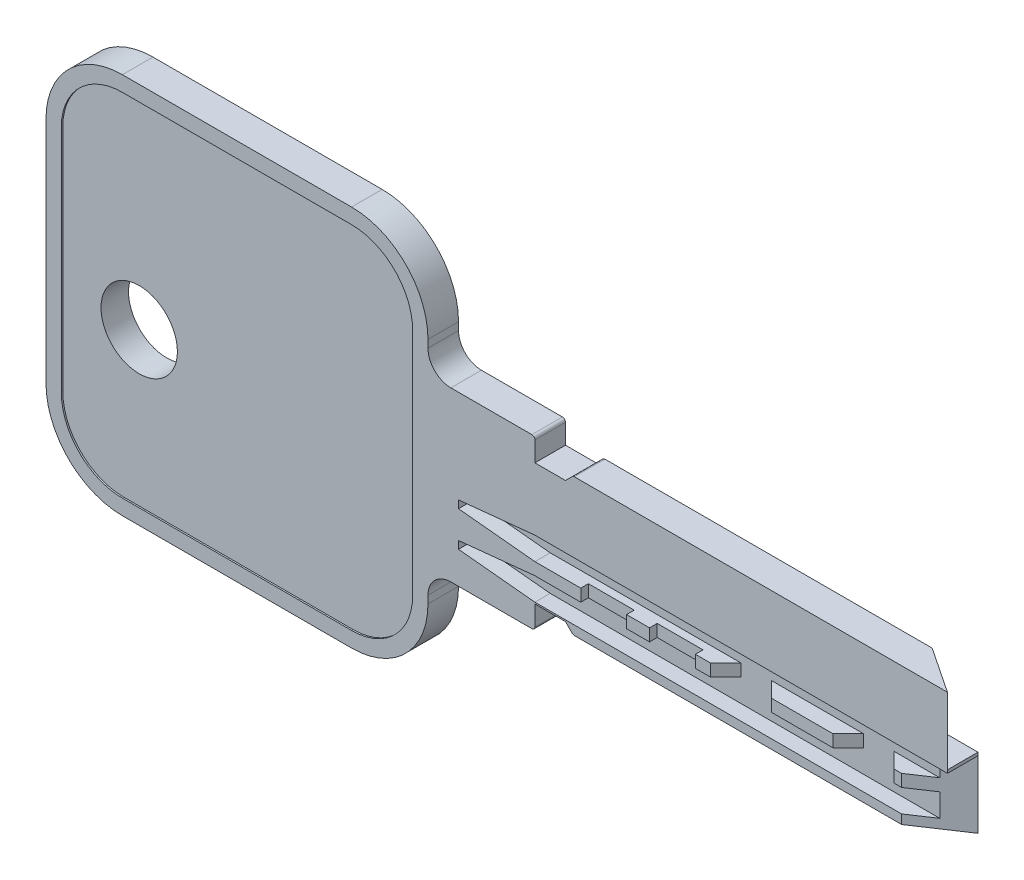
ISO-10303-21;
HEADER;
FILE_DESCRIPTION(('STEP AP214'),'2;1');
FILE_NAME('part.step','',(''),(''),'','','');
FILE_SCHEMA(('AUTOMOTIVE_DESIGN { 1 0 10303 214 1 1 1 1 }'));
ENDSEC;
DATA;
#1=APPLICATION_CONTEXT('core data for automotive mechanical design processes');
#2=APPLICATION_PROTOCOL_DEFINITION('international standard','automotive_design',2000,#1);
#3=PRODUCT_CONTEXT('',#1,'mechanical');
#4=PRODUCT('Part','Part','',(#3));
#5=PRODUCT_RELATED_PRODUCT_CATEGORY('part','',(#4));
#6=PRODUCT_DEFINITION_FORMATION('','',#4);
#7=PRODUCT_DEFINITION_CONTEXT('part definition',#1,'design');
#8=PRODUCT_DEFINITION('design','',#6,#7);
#9=PRODUCT_DEFINITION_SHAPE('','',#8);
#10=(LENGTH_UNIT() NAMED_UNIT(*) SI_UNIT(.MILLI.,.METRE.));
#11=(NAMED_UNIT(*) PLANE_ANGLE_UNIT() SI_UNIT($,.RADIAN.));
#12=(NAMED_UNIT(*) SI_UNIT($,.STERADIAN.) SOLID_ANGLE_UNIT());
#13=UNCERTAINTY_MEASURE_WITH_UNIT(LENGTH_MEASURE(1.E-05),#10,'distance_accuracy_value','');
#14=(GEOMETRIC_REPRESENTATION_CONTEXT(3) GLOBAL_UNCERTAINTY_ASSIGNED_CONTEXT((#13)) GLOBAL_UNIT_ASSIGNED_CONTEXT((#10,
#11,#12)) REPRESENTATION_CONTEXT('',''));
#15=CARTESIAN_POINT('',(0.,0.,0.));
#16=DIRECTION('',(0.,0.,1.));
#17=DIRECTION('',(1.,0.,0.));
#18=AXIS2_PLACEMENT_3D('',#15,#16,#17);
#19=CARTESIAN_POINT('',(7.5,-7.50000000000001,-1.));
#20=DIRECTION('',(0.,0.,1.));
#21=DIRECTION('',(1.,0.,0.));
#22=AXIS2_PLACEMENT_3D('',#19,#20,#21);
#23=PLANE('',#22);
#24=DIRECTION('',(-1.,0.,0.));
#25=VECTOR('',#24,1.);
#26=CARTESIAN_POINT('',(46.5,2.4,-1.));
#27=LINE('',#26,#25);
#28=CARTESIAN_POINT('',(43.5,2.4,-1.));
#29=VERTEX_POINT('',#28);
#30=CARTESIAN_POINT('',(43.,2.4,-1.));
#31=VERTEX_POINT('',#30);
#32=EDGE_CURVE('E2519',#29,#31,#27,.T.);
#33=ORIENTED_EDGE('',*,*,#32,.F.);
#34=DIRECTION('',(0.,1.,0.));
#35=VECTOR('',#34,1.);
#36=CARTESIAN_POINT('',(43.5,-3.50555127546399,-1.));
#37=LINE('',#36,#35);
#38=CARTESIAN_POINT('',(43.5,1.6,-1.));
#39=VERTEX_POINT('',#38);
#40=EDGE_CURVE('E2399',#39,#29,#37,.T.);
#41=ORIENTED_EDGE('',*,*,#40,.F.);
#42=DIRECTION('',(1.,0.,0.));
#43=VECTOR('',#42,1.);
#44=CARTESIAN_POINT('',(19.5,1.6,-1.));
#45=LINE('',#44,#43);
#46=CARTESIAN_POINT('',(43.,1.6,-1.));
#47=VERTEX_POINT('',#46);
#48=EDGE_CURVE('E2568',#47,#39,#45,.T.);
#49=ORIENTED_EDGE('',*,*,#48,.F.);
#50=DIRECTION('',(0.,1.,0.));
#51=VECTOR('',#50,1.);
#52=CARTESIAN_POINT('',(43.,-2.52310562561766,-1.));
#53=LINE('',#52,#51);
#54=EDGE_CURVE('E2415',#47,#31,#53,.T.);
#55=ORIENTED_EDGE('',*,*,#54,.T.);
#56=EDGE_LOOP('',(#33,#41,#49,#55));
#57=FACE_BOUND('',#56,.T.);
#58=ADVANCED_FACE('F33',(#57),#23,.F.);
#59=CARTESIAN_POINT('',(19.5,1.6,0.));
#60=DIRECTION('',(0.,1.,0.));
#61=DIRECTION('',(0.,0.,1.));
#62=AXIS2_PLACEMENT_3D('',#59,#60,#61);
#63=PLANE('',#62);
#64=ORIENTED_EDGE('',*,*,#48,.T.);
#65=DIRECTION('',(0.832050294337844,0.,0.554700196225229));
#66=VECTOR('',#65,1.);
#67=CARTESIAN_POINT('',(27.3461538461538,1.6,-11.7692307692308));
#68=LINE('',#67,#66);
#69=CARTESIAN_POINT('',(45.,1.6,0.));
#70=VERTEX_POINT('',#69);
#71=EDGE_CURVE('E2408',#39,#70,#68,.T.);
#72=ORIENTED_EDGE('',*,*,#71,.T.);
#73=DIRECTION('',(1.,0.,0.));
#74=VECTOR('',#73,1.);
#75=CARTESIAN_POINT('',(19.5,1.6,0.));
#76=LINE('',#75,#74);
#77=CARTESIAN_POINT('',(42.,1.6,0.));
#78=VERTEX_POINT('',#77);
#79=EDGE_CURVE('E2554',#78,#70,#76,.T.);
#80=ORIENTED_EDGE('',*,*,#79,.F.);
#81=DIRECTION('',(-0.707106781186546,0.,0.70710678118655));
#82=VECTOR('',#81,1.);
#83=CARTESIAN_POINT('',(42.,1.6,0.));
#84=LINE('',#83,#82);
#85=EDGE_CURVE('E2412',#47,#78,#84,.T.);
#86=ORIENTED_EDGE('',*,*,#85,.F.);
#87=EDGE_LOOP('',(#64,#72,#80,#86));
#88=FACE_BOUND('',#87,.T.);
#89=ADVANCED_FACE('F1387',(#88),#63,.F.);
#90=CARTESIAN_POINT('',(46.5,2.4,0.));
#91=DIRECTION('',(0.,-1.,0.));
#92=DIRECTION('',(1.,0.,0.));
#93=AXIS2_PLACEMENT_3D('',#90,#91,#92);
#94=PLANE('',#93);
#95=DIRECTION('',(-1.,0.,0.));
#96=VECTOR('',#95,1.);
#97=CARTESIAN_POINT('',(46.5,2.4,0.));
#98=LINE('',#97,#96);
#99=CARTESIAN_POINT('',(45.,2.4,0.));
#100=VERTEX_POINT('',#99);
#101=CARTESIAN_POINT('',(42.,2.4,0.));
#102=VERTEX_POINT('',#101);
#103=EDGE_CURVE('E2502',#100,#102,#98,.T.);
#104=ORIENTED_EDGE('',*,*,#103,.F.);
#105=DIRECTION('',(-0.832050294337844,0.,-0.554700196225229));
#106=VECTOR('',#105,1.);
#107=CARTESIAN_POINT('',(46.0384615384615,2.4,0.692307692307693));
#108=LINE('',#107,#106);
#109=EDGE_CURVE('E2404',#100,#29,#108,.T.);
#110=ORIENTED_EDGE('',*,*,#109,.T.);
#111=ORIENTED_EDGE('',*,*,#32,.T.);
#112=DIRECTION('',(0.707106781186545,0.,-0.70710678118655));
#113=VECTOR('',#112,1.);
#114=CARTESIAN_POINT('',(42.,2.4,0.));
#115=LINE('',#114,#113);
#116=EDGE_CURVE('E2418',#102,#31,#115,.T.);
#117=ORIENTED_EDGE('',*,*,#116,.F.);
#118=EDGE_LOOP('',(#104,#110,#111,#117));
#119=FACE_BOUND('',#118,.T.);
#120=ADVANCED_FACE('F1395',(#119),#94,.F.);
#121=CARTESIAN_POINT('',(39.,2.4,-1.));
#122=VERTEX_POINT('',#121);
#123=CARTESIAN_POINT('',(35.,2.4,-1.));
#124=VERTEX_POINT('',#123);
#125=EDGE_CURVE('E2522',#122,#124,#27,.T.);
#126=ORIENTED_EDGE('',*,*,#125,.F.);
#127=DIRECTION('',(0.,1.,0.));
#128=VECTOR('',#127,1.);
#129=CARTESIAN_POINT('',(39.,-2.52310562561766,-1.));
#130=LINE('',#129,#128);
#131=CARTESIAN_POINT('',(39.,1.6,-1.));
#132=VERTEX_POINT('',#131);
#133=EDGE_CURVE('E2421',#132,#122,#130,.T.);
#134=ORIENTED_EDGE('',*,*,#133,.F.);
#135=CARTESIAN_POINT('',(35.,1.6,-1.));
#136=VERTEX_POINT('',#135);
#137=EDGE_CURVE('E2588',#136,#132,#45,.T.);
#138=ORIENTED_EDGE('',*,*,#137,.F.);
#139=DIRECTION('',(0.,1.,0.));
#140=VECTOR('',#139,1.);
#141=CARTESIAN_POINT('',(35.,-2.52310562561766,-1.));
#142=LINE('',#141,#140);
#143=EDGE_CURVE('E2433',#136,#124,#142,.T.);
#144=ORIENTED_EDGE('',*,*,#143,.T.);
#145=EDGE_LOOP('',(#126,#134,#138,#144));
#146=FACE_BOUND('',#145,.T.);
#147=ADVANCED_FACE('F1390',(#146),#23,.F.);
#148=ORIENTED_EDGE('',*,*,#137,.T.);
#149=DIRECTION('',(-0.707106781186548,0.,-0.707106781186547));
#150=VECTOR('',#149,1.);
#151=CARTESIAN_POINT('',(39.,1.6,-1.));
#152=LINE('',#151,#150);
#153=CARTESIAN_POINT('',(40.,1.6,0.));
#154=VERTEX_POINT('',#153);
#155=EDGE_CURVE('E2414',#154,#132,#152,.T.);
#156=ORIENTED_EDGE('',*,*,#155,.F.);
#157=CARTESIAN_POINT('',(34.,1.6,0.));
#158=VERTEX_POINT('',#157);
#159=EDGE_CURVE('E2557',#158,#154,#76,.T.);
#160=ORIENTED_EDGE('',*,*,#159,.F.);
#161=DIRECTION('',(-0.707106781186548,0.,0.707106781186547));
#162=VECTOR('',#161,1.);
#163=CARTESIAN_POINT('',(34.,1.6,0.));
#164=LINE('',#163,#162);
#165=EDGE_CURVE('E2430',#136,#158,#164,.T.);
#166=ORIENTED_EDGE('',*,*,#165,.F.);
#167=EDGE_LOOP('',(#148,#156,#160,#166));
#168=FACE_BOUND('',#167,.T.);
#169=ADVANCED_FACE('F1398',(#168),#63,.F.);
#170=CARTESIAN_POINT('',(40.,2.4,0.));
#171=VERTEX_POINT('',#170);
#172=CARTESIAN_POINT('',(34.,2.4,0.));
#173=VERTEX_POINT('',#172);
#174=EDGE_CURVE('E2505',#171,#173,#98,.T.);
#175=ORIENTED_EDGE('',*,*,#174,.F.);
#176=DIRECTION('',(0.707106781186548,0.,0.707106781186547));
#177=VECTOR('',#176,1.);
#178=CARTESIAN_POINT('',(39.,2.4,-1.));
#179=LINE('',#178,#177);
#180=EDGE_CURVE('E2411',#122,#171,#179,.T.);
#181=ORIENTED_EDGE('',*,*,#180,.F.);
#182=ORIENTED_EDGE('',*,*,#125,.T.);
#183=DIRECTION('',(0.707106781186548,0.,-0.707106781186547));
#184=VECTOR('',#183,1.);
#185=CARTESIAN_POINT('',(34.,2.4,0.));
#186=LINE('',#185,#184);
#187=EDGE_CURVE('E2435',#173,#124,#186,.T.);
#188=ORIENTED_EDGE('',*,*,#187,.F.);
#189=EDGE_LOOP('',(#175,#181,#182,#188));
#190=FACE_BOUND('',#189,.T.);
#191=ADVANCED_FACE('F1422',(#190),#94,.F.);
#192=CARTESIAN_POINT('',(26.,2.4,-1.));
#193=VERTEX_POINT('',#192);
#194=CARTESIAN_POINT('',(24.5,2.4,-1.));
#195=VERTEX_POINT('',#194);
#196=EDGE_CURVE('E2605',#193,#195,#27,.T.);
#197=ORIENTED_EDGE('',*,*,#196,.F.);
#198=DIRECTION('',(0.,1.,0.));
#199=VECTOR('',#198,1.);
#200=CARTESIAN_POINT('',(26.,2.4,-1.));
#201=LINE('',#200,#199);
#202=CARTESIAN_POINT('',(26.,1.6,-1.));
#203=VERTEX_POINT('',#202);
#204=EDGE_CURVE('E2449',#203,#193,#201,.T.);
#205=ORIENTED_EDGE('',*,*,#204,.F.);
#206=CARTESIAN_POINT('',(24.5,1.6,-1.));
#207=VERTEX_POINT('',#206);
#208=EDGE_CURVE('E2570',#207,#203,#45,.T.);
#209=ORIENTED_EDGE('',*,*,#208,.F.);
#210=DIRECTION('',(0.,-1.,0.));
#211=VECTOR('',#210,1.);
#212=CARTESIAN_POINT('',(24.5,2.4,-1.));
#213=LINE('',#212,#211);
#214=EDGE_CURVE('E2479',#195,#207,#213,.T.);
#215=ORIENTED_EDGE('',*,*,#214,.F.);
#216=EDGE_LOOP('',(#197,#205,#209,#215));
#217=FACE_BOUND('',#216,.T.);
#218=ADVANCED_FACE('F1404',(#217),#23,.F.);
#219=DIRECTION('',(0.,1.,0.));
#220=VECTOR('',#219,1.);
#221=CARTESIAN_POINT('',(11.5,7.00000000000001,-1.));
#222=LINE('',#221,#220);
#223=CARTESIAN_POINT('',(11.5,-7.50000000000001,-1.));
#224=VERTEX_POINT('',#223);
#225=CARTESIAN_POINT('',(11.5,7.49999999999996,-1.));
#226=VERTEX_POINT('',#225);
#227=EDGE_CURVE('E688',#224,#226,#222,.T.);
#228=ORIENTED_EDGE('',*,*,#227,.T.);
#229=CARTESIAN_POINT('',(7.5,7.5,-1.));
#230=DIRECTION('',(0.,0.,1.));
#231=DIRECTION('',(1.,0.,0.));
#232=AXIS2_PLACEMENT_3D('',#229,#230,#231);
#233=CIRCLE('',#232,4.);
#234=CARTESIAN_POINT('',(7.49999999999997,11.5,-1.));
#235=VERTEX_POINT('',#234);
#236=EDGE_CURVE('E721',#226,#235,#233,.T.);
#237=ORIENTED_EDGE('',*,*,#236,.T.);
#238=DIRECTION('',(-1.,0.,0.));
#239=VECTOR('',#238,1.);
#240=CARTESIAN_POINT('',(7.49999999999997,11.5,-1.));
#241=LINE('',#240,#239);
#242=CARTESIAN_POINT('',(-7.49999999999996,11.5,-1.));
#243=VERTEX_POINT('',#242);
#244=EDGE_CURVE('E718',#235,#243,#241,.T.);
#245=ORIENTED_EDGE('',*,*,#244,.T.);
#246=CARTESIAN_POINT('',(-7.5,7.5,-1.));
#247=DIRECTION('',(0.,0.,1.));
#248=DIRECTION('',(1.,0.,0.));
#249=AXIS2_PLACEMENT_3D('',#246,#247,#248);
#250=CIRCLE('',#249,4.);
#251=CARTESIAN_POINT('',(-11.5,7.49999999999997,-1.));
#252=VERTEX_POINT('',#251);
#253=EDGE_CURVE('E715',#243,#252,#250,.T.);
#254=ORIENTED_EDGE('',*,*,#253,.T.);
#255=DIRECTION('',(0.,-1.,0.));
#256=VECTOR('',#255,1.);
#257=CARTESIAN_POINT('',(-11.5,7.49999999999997,-1.));
#258=LINE('',#257,#256);
#259=CARTESIAN_POINT('',(-11.5,-7.49999999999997,-1.));
#260=VERTEX_POINT('',#259);
#261=EDGE_CURVE('E712',#252,#260,#258,.T.);
#262=ORIENTED_EDGE('',*,*,#261,.T.);
#263=CARTESIAN_POINT('',(-7.5,-7.50000000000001,-1.));
#264=DIRECTION('',(0.,0.,1.));
#265=DIRECTION('',(1.,0.,0.));
#266=AXIS2_PLACEMENT_3D('',#263,#264,#265);
#267=CIRCLE('',#266,4.);
#268=CARTESIAN_POINT('',(-7.49999999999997,-11.5,-1.));
#269=VERTEX_POINT('',#268);
#270=EDGE_CURVE('E709',#260,#269,#267,.T.);
#271=ORIENTED_EDGE('',*,*,#270,.T.);
#272=DIRECTION('',(1.,0.,0.));
#273=VECTOR('',#272,1.);
#274=CARTESIAN_POINT('',(-7.49999999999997,-11.5,-1.));
#275=LINE('',#274,#273);
#276=CARTESIAN_POINT('',(7.49999999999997,-11.5,-1.));
#277=VERTEX_POINT('',#276);
#278=EDGE_CURVE('E706',#269,#277,#275,.T.);
#279=ORIENTED_EDGE('',*,*,#278,.T.);
#280=CARTESIAN_POINT('',(7.5,-7.50000000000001,-1.));
#281=DIRECTION('',(0.,0.,1.));
#282=DIRECTION('',(1.,0.,0.));
#283=AXIS2_PLACEMENT_3D('',#280,#281,#282);
#284=CIRCLE('',#283,4.);
#285=EDGE_CURVE('E684',#277,#224,#284,.T.);
#286=ORIENTED_EDGE('',*,*,#285,.T.);
#287=EDGE_LOOP('',(#228,#237,#245,#254,#262,#271,#279,#286));
#288=FACE_BOUND('',#287,.T.);
#289=DIRECTION('',(-1.,0.,0.));
#290=VECTOR('',#289,1.);
#291=CARTESIAN_POINT('',(22.,4.5,-1.));
#292=LINE('',#291,#290);
#293=CARTESIAN_POINT('',(43.5,4.5,-1.));
#294=VERTEX_POINT('',#293);
#295=CARTESIAN_POINT('',(22.0828427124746,4.5,-1.));
#296=VERTEX_POINT('',#295);
#297=EDGE_CURVE('E1096',#294,#296,#292,.T.);
#298=ORIENTED_EDGE('',*,*,#297,.F.);
#299=CARTESIAN_POINT('',(43.5,3.9,-1.));
#300=VERTEX_POINT('',#299);
#301=EDGE_CURVE('E649',#300,#294,#37,.T.);
#302=ORIENTED_EDGE('',*,*,#301,.F.);
#303=DIRECTION('',(1.,0.,0.));
#304=VECTOR('',#303,1.);
#305=CARTESIAN_POINT('',(19.5,3.9,-1.));
#306=LINE('',#305,#304);
#307=CARTESIAN_POINT('',(19.5,3.9,-1.));
#308=VERTEX_POINT('',#307);
#309=EDGE_CURVE('E2531',#308,#300,#306,.T.);
#310=ORIENTED_EDGE('',*,*,#309,.F.);
#311=DIRECTION('',(0.995037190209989,0.0995037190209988,0.));
#312=VECTOR('',#311,1.);
#313=CARTESIAN_POINT('',(14.5,3.4,-1.));
#314=LINE('',#313,#312);
#315=CARTESIAN_POINT('',(14.5,3.4,-1.));
#316=VERTEX_POINT('',#315);
#317=EDGE_CURVE('E2528',#316,#308,#314,.T.);
#318=ORIENTED_EDGE('',*,*,#317,.F.);
#319=DIRECTION('',(0.,1.,0.));
#320=VECTOR('',#319,1.);
#321=CARTESIAN_POINT('',(14.5,2.9,-1.));
#322=LINE('',#321,#320);
#323=CARTESIAN_POINT('',(14.5,2.9,-1.));
#324=VERTEX_POINT('',#323);
#325=EDGE_CURVE('E2525',#324,#316,#322,.T.);
#326=ORIENTED_EDGE('',*,*,#325,.F.);
#327=DIRECTION('',(-0.995037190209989,0.0995037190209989,0.));
#328=VECTOR('',#327,1.);
#329=CARTESIAN_POINT('',(19.5,2.4,-1.));
#330=LINE('',#329,#328);
#331=CARTESIAN_POINT('',(19.5,2.4,-1.));
#332=VERTEX_POINT('',#331);
#333=EDGE_CURVE('E2521',#332,#324,#330,.T.);
#334=ORIENTED_EDGE('',*,*,#333,.F.);
#335=CARTESIAN_POINT('',(21.5,2.4,-1.));
#336=VERTEX_POINT('',#335);
#337=EDGE_CURVE('E2493',#336,#332,#27,.T.);
#338=ORIENTED_EDGE('',*,*,#337,.F.);
#339=DIRECTION('',(0.,1.,0.));
#340=VECTOR('',#339,1.);
#341=CARTESIAN_POINT('',(21.5,2.4,-1.));
#342=LINE('',#341,#340);
#343=CARTESIAN_POINT('',(21.5,1.6,-1.));
#344=VERTEX_POINT('',#343);
#345=EDGE_CURVE('E2467',#344,#336,#342,.T.);
#346=ORIENTED_EDGE('',*,*,#345,.F.);
#347=CARTESIAN_POINT('',(19.5,1.6,-1.));
#348=VERTEX_POINT('',#347);
#349=EDGE_CURVE('E2545',#348,#344,#45,.T.);
#350=ORIENTED_EDGE('',*,*,#349,.F.);
#351=DIRECTION('',(0.995037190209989,0.0995037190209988,0.));
#352=VECTOR('',#351,1.);
#353=CARTESIAN_POINT('',(14.5,1.1,-1.));
#354=LINE('',#353,#352);
#355=CARTESIAN_POINT('',(14.5,1.1,-1.));
#356=VERTEX_POINT('',#355);
#357=EDGE_CURVE('E2565',#356,#348,#354,.T.);
#358=ORIENTED_EDGE('',*,*,#357,.F.);
#359=DIRECTION('',(0.,1.,0.));
#360=VECTOR('',#359,1.);
#361=CARTESIAN_POINT('',(14.5,0.6,-1.));
#362=LINE('',#361,#360);
#363=CARTESIAN_POINT('',(14.5,0.6,-1.));
#364=VERTEX_POINT('',#363);
#365=EDGE_CURVE('E2562',#364,#356,#362,.T.);
#366=ORIENTED_EDGE('',*,*,#365,.F.);
#367=DIRECTION('',(-0.995037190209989,0.0995037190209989,0.));
#368=VECTOR('',#367,1.);
#369=CARTESIAN_POINT('',(19.5,0.0999999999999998,-1.));
#370=LINE('',#369,#368);
#371=CARTESIAN_POINT('',(19.5,0.0999999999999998,-1.));
#372=VERTEX_POINT('',#371);
#373=EDGE_CURVE('E2559',#372,#364,#370,.T.);
#374=ORIENTED_EDGE('',*,*,#373,.F.);
#375=DIRECTION('',(-1.,0.,0.));
#376=VECTOR('',#375,1.);
#377=CARTESIAN_POINT('',(46.5,0.0999999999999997,-1.));
#378=LINE('',#377,#376);
#379=CARTESIAN_POINT('',(46.5,0.0999999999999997,-1.));
#380=VERTEX_POINT('',#379);
#381=EDGE_CURVE('E2536',#380,#372,#378,.T.);
#382=ORIENTED_EDGE('',*,*,#381,.F.);
#383=DIRECTION('',(0.,1.,0.));
#384=VECTOR('',#383,1.);
#385=CARTESIAN_POINT('',(46.5,5.5,-1.));
#386=LINE('',#385,#384);
#387=CARTESIAN_POINT('',(46.5,-0.0999999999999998,-1.));
#388=VERTEX_POINT('',#387);
#389=EDGE_CURVE('E847',#388,#380,#386,.T.);
#390=ORIENTED_EDGE('',*,*,#389,.F.);
#391=CARTESIAN_POINT('',(46.5,-4.5,-1.));
#392=VERTEX_POINT('',#391);
#393=EDGE_CURVE('E848',#392,#388,#386,.T.);
#394=ORIENTED_EDGE('',*,*,#393,.F.);
#395=DIRECTION('',(-1.,0.,0.));
#396=VECTOR('',#395,1.);
#397=CARTESIAN_POINT('',(22.,-4.5,-1.));
#398=LINE('',#397,#396);
#399=CARTESIAN_POINT('',(22.0828427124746,-4.5,-1.));
#400=VERTEX_POINT('',#399);
#401=EDGE_CURVE('E1085',#392,#400,#398,.T.);
#402=ORIENTED_EDGE('',*,*,#401,.T.);
#403=CARTESIAN_POINT('',(22.0828427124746,-4.3,-1.));
#404=DIRECTION('',(0.,0.,-1.));
#405=DIRECTION('',(1.,0.,0.));
#406=AXIS2_PLACEMENT_3D('',#403,#404,#405);
#407=CIRCLE('',#406,0.2);
#408=CARTESIAN_POINT('',(21.9414213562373,-4.44142135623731,-1.));
#409=VERTEX_POINT('',#408);
#410=EDGE_CURVE('E1077',#409,#400,#407,.F.);
#411=ORIENTED_EDGE('',*,*,#410,.F.);
#412=DIRECTION('',(-0.707106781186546,0.707106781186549,0.));
#413=VECTOR('',#412,1.);
#414=CARTESIAN_POINT('',(21.5,-4.,-1.));
#415=LINE('',#414,#413);
#416=CARTESIAN_POINT('',(21.5,-4.,-1.));
#417=VERTEX_POINT('',#416);
#418=EDGE_CURVE('E1074',#409,#417,#415,.T.);
#419=ORIENTED_EDGE('',*,*,#418,.T.);
#420=DIRECTION('',(-1.,0.,0.));
#421=VECTOR('',#420,1.);
#422=CARTESIAN_POINT('',(19.5,-4.,-1.));
#423=LINE('',#422,#421);
#424=CARTESIAN_POINT('',(19.5,-4.,-1.));
#425=VERTEX_POINT('',#424);
#426=EDGE_CURVE('E1061',#417,#425,#423,.T.);
#427=ORIENTED_EDGE('',*,*,#426,.T.);
#428=DIRECTION('',(0.,-1.,0.));
#429=VECTOR('',#428,1.);
#430=CARTESIAN_POINT('',(19.5,-5.5,-1.));
#431=LINE('',#430,#429);
#432=CARTESIAN_POINT('',(19.5,-5.3,-1.));
#433=VERTEX_POINT('',#432);
#434=EDGE_CURVE('E1053',#425,#433,#431,.T.);
#435=ORIENTED_EDGE('',*,*,#434,.T.);
#436=CARTESIAN_POINT('',(19.3,-5.3,-1.));
#437=DIRECTION('',(0.,0.,-1.));
#438=DIRECTION('',(1.,0.,0.));
#439=AXIS2_PLACEMENT_3D('',#436,#437,#438);
#440=CIRCLE('',#439,0.2);
#441=CARTESIAN_POINT('',(19.3,-5.5,-1.));
#442=VERTEX_POINT('',#441);
#443=EDGE_CURVE('E1036',#442,#433,#440,.F.);
#444=ORIENTED_EDGE('',*,*,#443,.F.);
#445=DIRECTION('',(1.,0.,0.));
#446=VECTOR('',#445,1.);
#447=CARTESIAN_POINT('',(14.,-5.5,-1.));
#448=LINE('',#447,#446);
#449=CARTESIAN_POINT('',(14.,-5.5,-1.));
#450=VERTEX_POINT('',#449);
#451=EDGE_CURVE('E844',#450,#442,#448,.T.);
#452=ORIENTED_EDGE('',*,*,#451,.F.);
#453=CARTESIAN_POINT('',(14.,-7.,-1.));
#454=DIRECTION('',(0.,0.,-1.));
#455=DIRECTION('',(-1.,0.,0.));
#456=AXIS2_PLACEMENT_3D('',#453,#454,#455);
#457=CIRCLE('',#456,1.5);
#458=CARTESIAN_POINT('',(12.5,-7.00000000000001,-1.));
#459=VERTEX_POINT('',#458);
#460=EDGE_CURVE('E842',#459,#450,#457,.T.);
#461=ORIENTED_EDGE('',*,*,#460,.F.);
#462=DIRECTION('',(0.,1.,0.));
#463=VECTOR('',#462,1.);
#464=CARTESIAN_POINT('',(12.5,-7.49999999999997,-1.));
#465=LINE('',#464,#463);
#466=CARTESIAN_POINT('',(12.5,-7.49999999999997,-1.));
#467=VERTEX_POINT('',#466);
#468=EDGE_CURVE('E840',#467,#459,#465,.T.);
#469=ORIENTED_EDGE('',*,*,#468,.F.);
#470=CARTESIAN_POINT('',(7.5,-7.50000000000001,-1.));
#471=DIRECTION('',(0.,0.,1.));
#472=DIRECTION('',(1.,0.,0.));
#473=AXIS2_PLACEMENT_3D('',#470,#471,#472);
#474=CIRCLE('',#473,5.);
#475=CARTESIAN_POINT('',(7.49999999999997,-12.5,-1.));
#476=VERTEX_POINT('',#475);
#477=EDGE_CURVE('E837',#476,#467,#474,.T.);
#478=ORIENTED_EDGE('',*,*,#477,.F.);
#479=DIRECTION('',(1.,0.,0.));
#480=VECTOR('',#479,1.);
#481=CARTESIAN_POINT('',(-7.49999999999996,-12.5,-1.));
#482=LINE('',#481,#480);
#483=CARTESIAN_POINT('',(-7.49999999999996,-12.5,-1.));
#484=VERTEX_POINT('',#483);
#485=EDGE_CURVE('E810',#484,#476,#482,.T.);
#486=ORIENTED_EDGE('',*,*,#485,.F.);
#487=CARTESIAN_POINT('',(-7.5,-7.50000000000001,-1.));
#488=DIRECTION('',(0.,0.,1.));
#489=DIRECTION('',(1.,0.,0.));
#490=AXIS2_PLACEMENT_3D('',#487,#488,#489);
#491=CIRCLE('',#490,5.);
#492=CARTESIAN_POINT('',(-12.5,-7.49999999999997,-1.));
#493=VERTEX_POINT('',#492);
#494=EDGE_CURVE('E865',#493,#484,#491,.T.);
#495=ORIENTED_EDGE('',*,*,#494,.F.);
#496=DIRECTION('',(0.,-1.,0.));
#497=VECTOR('',#496,1.);
#498=CARTESIAN_POINT('',(-12.5,7.49999999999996,-1.));
#499=LINE('',#498,#497);
#500=CARTESIAN_POINT('',(-12.5,7.49999999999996,-1.));
#501=VERTEX_POINT('',#500);
#502=EDGE_CURVE('E863',#501,#493,#499,.T.);
#503=ORIENTED_EDGE('',*,*,#502,.F.);
#504=CARTESIAN_POINT('',(-7.5,7.5,-1.));
#505=DIRECTION('',(0.,0.,1.));
#506=DIRECTION('',(1.,0.,0.));
#507=AXIS2_PLACEMENT_3D('',#504,#505,#506);
#508=CIRCLE('',#507,5.);
#509=CARTESIAN_POINT('',(-7.49999999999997,12.5,-1.));
#510=VERTEX_POINT('',#509);
#511=EDGE_CURVE('E861',#510,#501,#508,.T.);
#512=ORIENTED_EDGE('',*,*,#511,.F.);
#513=DIRECTION('',(-1.,0.,0.));
#514=VECTOR('',#513,1.);
#515=CARTESIAN_POINT('',(-7.49999999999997,12.5,-1.));
#516=LINE('',#515,#514);
#517=CARTESIAN_POINT('',(7.49999999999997,12.5,-1.));
#518=VERTEX_POINT('',#517);
#519=EDGE_CURVE('E859',#518,#510,#516,.T.);
#520=ORIENTED_EDGE('',*,*,#519,.F.);
#521=CARTESIAN_POINT('',(7.5,7.5,-1.));
#522=DIRECTION('',(0.,0.,1.));
#523=DIRECTION('',(-1.,0.,0.));
#524=AXIS2_PLACEMENT_3D('',#521,#522,#523);
#525=CIRCLE('',#524,5.);
#526=CARTESIAN_POINT('',(12.5,7.49999999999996,-1.));
#527=VERTEX_POINT('',#526);
#528=EDGE_CURVE('E857',#527,#518,#525,.T.);
#529=ORIENTED_EDGE('',*,*,#528,.F.);
#530=DIRECTION('',(0.,1.,0.));
#531=VECTOR('',#530,1.);
#532=CARTESIAN_POINT('',(12.5,7.49999999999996,-1.));
#533=LINE('',#532,#531);
#534=CARTESIAN_POINT('',(12.5,7.00000000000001,-1.));
#535=VERTEX_POINT('',#534);
#536=EDGE_CURVE('E855',#535,#527,#533,.T.);
#537=ORIENTED_EDGE('',*,*,#536,.F.);
#538=CARTESIAN_POINT('',(14.,7.,-1.));
#539=DIRECTION('',(0.,0.,-1.));
#540=DIRECTION('',(-1.,0.,0.));
#541=AXIS2_PLACEMENT_3D('',#538,#539,#540);
#542=CIRCLE('',#541,1.5);
#543=CARTESIAN_POINT('',(14.,5.5,-1.));
#544=VERTEX_POINT('',#543);
#545=EDGE_CURVE('E853',#544,#535,#542,.T.);
#546=ORIENTED_EDGE('',*,*,#545,.F.);
#547=DIRECTION('',(-1.,0.,0.));
#548=VECTOR('',#547,1.);
#549=CARTESIAN_POINT('',(14.,5.5,-1.));
#550=LINE('',#549,#548);
#551=CARTESIAN_POINT('',(19.3,5.5,-1.));
#552=VERTEX_POINT('',#551);
#553=EDGE_CURVE('E851',#552,#544,#550,.T.);
#554=ORIENTED_EDGE('',*,*,#553,.F.);
#555=CARTESIAN_POINT('',(19.3,5.3,-1.));
#556=DIRECTION('',(0.,0.,1.));
#557=DIRECTION('',(1.,0.,0.));
#558=AXIS2_PLACEMENT_3D('',#555,#556,#557);
#559=CIRCLE('',#558,0.2);
#560=CARTESIAN_POINT('',(19.5,5.3,-1.));
#561=VERTEX_POINT('',#560);
#562=EDGE_CURVE('E914',#552,#561,#559,.F.);
#563=ORIENTED_EDGE('',*,*,#562,.T.);
#564=DIRECTION('',(0.,1.,0.));
#565=VECTOR('',#564,1.);
#566=CARTESIAN_POINT('',(19.5,5.5,-1.));
#567=LINE('',#566,#565);
#568=CARTESIAN_POINT('',(19.5,4.,-1.));
#569=VERTEX_POINT('',#568);
#570=EDGE_CURVE('E680',#569,#561,#567,.T.);
#571=ORIENTED_EDGE('',*,*,#570,.F.);
#572=DIRECTION('',(-1.,0.,0.));
#573=VECTOR('',#572,1.);
#574=CARTESIAN_POINT('',(19.5,4.,-1.));
#575=LINE('',#574,#573);
#576=CARTESIAN_POINT('',(21.5,4.,-1.));
#577=VERTEX_POINT('',#576);
#578=EDGE_CURVE('E1091',#577,#569,#575,.T.);
#579=ORIENTED_EDGE('',*,*,#578,.F.);
#580=DIRECTION('',(-0.707106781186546,-0.707106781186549,0.));
#581=VECTOR('',#580,1.);
#582=CARTESIAN_POINT('',(21.5,4.,-1.));
#583=LINE('',#582,#581);
#584=CARTESIAN_POINT('',(21.9414213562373,4.44142135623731,-1.));
#585=VERTEX_POINT('',#584);
#586=EDGE_CURVE('E1094',#585,#577,#583,.T.);
#587=ORIENTED_EDGE('',*,*,#586,.F.);
#588=CARTESIAN_POINT('',(22.0828427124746,4.3,-1.));
#589=DIRECTION('',(0.,0.,1.));
#590=DIRECTION('',(1.,0.,0.));
#591=AXIS2_PLACEMENT_3D('',#588,#589,#590);
#592=CIRCLE('',#591,0.2);
#593=EDGE_CURVE('E916',#585,#296,#592,.F.);
#594=ORIENTED_EDGE('',*,*,#593,.T.);
#595=EDGE_LOOP('',(#298,#302,#310,#318,#326,#334,#338,#346,#350,#358,#366,#374,#382,#390,#394,
#402,#411,#419,#427,#435,#444,#452,#461,#469,#478,#486,#495,#503,#512,#520,#529,#537,#546,#554,
#563,#571,#579,#587,#594));
#596=FACE_BOUND('',#595,.T.);
#597=ADVANCED_FACE('F1115',(#288,#596),#23,.F.);
#598=CARTESIAN_POINT('',(7.5,-7.50000000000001,1.));
#599=DIRECTION('',(0.,0.,1.));
#600=DIRECTION('',(1.,0.,0.));
#601=AXIS2_PLACEMENT_3D('',#598,#599,#600);
#602=PLANE('',#601);
#603=DIRECTION('',(0.,-1.,0.));
#604=VECTOR('',#603,1.);
#605=CARTESIAN_POINT('',(39.,2.52310562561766,1.));
#606=LINE('',#605,#604);
#607=CARTESIAN_POINT('',(39.,-1.6,1.));
#608=VERTEX_POINT('',#607);
#609=CARTESIAN_POINT('',(39.,-2.4,1.));
#610=VERTEX_POINT('',#609);
#611=EDGE_CURVE('E1248',#608,#610,#606,.T.);
#612=ORIENTED_EDGE('',*,*,#611,.F.);
#613=DIRECTION('',(1.,0.,0.));
#614=VECTOR('',#613,1.);
#615=CARTESIAN_POINT('',(19.5,-1.6,1.));
#616=LINE('',#615,#614);
#617=CARTESIAN_POINT('',(35.,-1.6,1.));
#618=VERTEX_POINT('',#617);
#619=EDGE_CURVE('E1327',#618,#608,#616,.T.);
#620=ORIENTED_EDGE('',*,*,#619,.F.);
#621=DIRECTION('',(0.,-1.,0.));
#622=VECTOR('',#621,1.);
#623=CARTESIAN_POINT('',(35.,2.52310562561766,1.));
#624=LINE('',#623,#622);
#625=CARTESIAN_POINT('',(35.,-2.4,1.));
#626=VERTEX_POINT('',#625);
#627=EDGE_CURVE('E1268',#618,#626,#624,.T.);
#628=ORIENTED_EDGE('',*,*,#627,.T.);
#629=DIRECTION('',(-1.,0.,0.));
#630=VECTOR('',#629,1.);
#631=CARTESIAN_POINT('',(46.5,-2.4,1.));
#632=LINE('',#631,#630);
#633=EDGE_CURVE('E943',#610,#626,#632,.T.);
#634=ORIENTED_EDGE('',*,*,#633,.F.);
#635=EDGE_LOOP('',(#612,#620,#628,#634));
#636=FACE_BOUND('',#635,.T.);
#637=ADVANCED_FACE('F1413',(#636),#602,.T.);
#638=CARTESIAN_POINT('',(19.5,-1.6,0.));
#639=DIRECTION('',(0.,-1.,0.));
#640=DIRECTION('',(0.,0.,-1.));
#641=AXIS2_PLACEMENT_3D('',#638,#639,#640);
#642=PLANE('',#641);
#643=ORIENTED_EDGE('',*,*,#619,.T.);
#644=DIRECTION('',(-0.707106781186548,0.,0.707106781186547));
#645=VECTOR('',#644,1.);
#646=CARTESIAN_POINT('',(20.,-1.6,20.));
#647=LINE('',#646,#645);
#648=CARTESIAN_POINT('',(40.,-1.6,0.));
#649=VERTEX_POINT('',#648);
#650=EDGE_CURVE('E1238',#649,#608,#647,.T.);
#651=ORIENTED_EDGE('',*,*,#650,.F.);
#652=DIRECTION('',(1.,0.,0.));
#653=VECTOR('',#652,1.);
#654=CARTESIAN_POINT('',(19.5,-1.6,0.));
#655=LINE('',#654,#653);
#656=CARTESIAN_POINT('',(34.,-1.6,0.));
#657=VERTEX_POINT('',#656);
#658=EDGE_CURVE('E1017',#657,#649,#655,.T.);
#659=ORIENTED_EDGE('',*,*,#658,.F.);
#660=DIRECTION('',(-0.707106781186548,0.,-0.707106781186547));
#661=VECTOR('',#660,1.);
#662=CARTESIAN_POINT('',(17.,-1.6,-17.));
#663=LINE('',#662,#661);
#664=EDGE_CURVE('E1257',#618,#657,#663,.T.);
#665=ORIENTED_EDGE('',*,*,#664,.F.);
#666=EDGE_LOOP('',(#643,#651,#659,#665));
#667=FACE_BOUND('',#666,.T.);
#668=ADVANCED_FACE('F1379',(#667),#642,.F.);
#669=CARTESIAN_POINT('',(46.5,-2.4,0.));
#670=DIRECTION('',(0.,1.,0.));
#671=DIRECTION('',(0.,0.,1.));
#672=AXIS2_PLACEMENT_3D('',#669,#670,#671);
#673=PLANE('',#672);
#674=DIRECTION('',(-1.,0.,0.));
#675=VECTOR('',#674,1.);
#676=CARTESIAN_POINT('',(46.5,-2.4,0.));
#677=LINE('',#676,#675);
#678=CARTESIAN_POINT('',(40.,-2.4,0.));
#679=VERTEX_POINT('',#678);
#680=CARTESIAN_POINT('',(34.,-2.4,0.));
#681=VERTEX_POINT('',#680);
#682=EDGE_CURVE('E977',#679,#681,#677,.T.);
#683=ORIENTED_EDGE('',*,*,#682,.F.);
#684=DIRECTION('',(0.707106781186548,0.,-0.707106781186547));
#685=VECTOR('',#684,1.);
#686=CARTESIAN_POINT('',(20.,-2.4,20.));
#687=LINE('',#686,#685);
#688=EDGE_CURVE('E1243',#610,#679,#687,.T.);
#689=ORIENTED_EDGE('',*,*,#688,.F.);
#690=ORIENTED_EDGE('',*,*,#633,.T.);
#691=DIRECTION('',(0.707106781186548,0.,0.707106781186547));
#692=VECTOR('',#691,1.);
#693=CARTESIAN_POINT('',(17.,-2.4,-17.));
#694=LINE('',#693,#692);
#695=EDGE_CURVE('E1254',#681,#626,#694,.T.);
#696=ORIENTED_EDGE('',*,*,#695,.F.);
#697=EDGE_LOOP('',(#683,#689,#690,#696));
#698=FACE_BOUND('',#697,.T.);
#699=ADVANCED_FACE('F1371',(#698),#673,.F.);
#700=DIRECTION('',(0.,-1.,0.));
#701=VECTOR('',#700,1.);
#702=CARTESIAN_POINT('',(31.,2.52310562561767,1.));
#703=LINE('',#702,#701);
#704=CARTESIAN_POINT('',(31.,-1.6,1.));
#705=VERTEX_POINT('',#704);
#706=CARTESIAN_POINT('',(31.,-2.4,1.));
#707=VERTEX_POINT('',#706);
#708=EDGE_CURVE('E1266',#705,#707,#703,.T.);
#709=ORIENTED_EDGE('',*,*,#708,.F.);
#710=CARTESIAN_POINT('',(30.,-1.6,1.));
#711=VERTEX_POINT('',#710);
#712=EDGE_CURVE('E1326',#711,#705,#616,.T.);
#713=ORIENTED_EDGE('',*,*,#712,.F.);
#714=DIRECTION('',(0.,1.,0.));
#715=VECTOR('',#714,1.);
#716=CARTESIAN_POINT('',(30.,-1.6,1.));
#717=LINE('',#716,#715);
#718=CARTESIAN_POINT('',(30.,-2.4,1.));
#719=VERTEX_POINT('',#718);
#720=EDGE_CURVE('E1278',#719,#711,#717,.T.);
#721=ORIENTED_EDGE('',*,*,#720,.F.);
#722=EDGE_CURVE('E949',#707,#719,#632,.T.);
#723=ORIENTED_EDGE('',*,*,#722,.F.);
#724=EDGE_LOOP('',(#709,#713,#721,#723));
#725=FACE_BOUND('',#724,.T.);
#726=ADVANCED_FACE('F1377',(#725),#602,.T.);
#727=ORIENTED_EDGE('',*,*,#712,.T.);
#728=DIRECTION('',(-0.707106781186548,0.,0.707106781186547));
#729=VECTOR('',#728,1.);
#730=CARTESIAN_POINT('',(16.,-1.6,16.));
#731=LINE('',#730,#729);
#732=CARTESIAN_POINT('',(32.,-1.6,0.));
#733=VERTEX_POINT('',#732);
#734=EDGE_CURVE('E1255',#733,#705,#731,.T.);
#735=ORIENTED_EDGE('',*,*,#734,.F.);
#736=CARTESIAN_POINT('',(19.5,-1.6,0.));
#737=VERTEX_POINT('',#736);
#738=EDGE_CURVE('E1013',#737,#733,#655,.T.);
#739=ORIENTED_EDGE('',*,*,#738,.F.);
#740=DIRECTION('',(0.,0.,1.));
#741=VECTOR('',#740,1.);
#742=CARTESIAN_POINT('',(19.5,-1.6,0.));
#743=LINE('',#742,#741);
#744=CARTESIAN_POINT('',(19.5,-1.6,1.));
#745=VERTEX_POINT('',#744);
#746=EDGE_CURVE('E1034',#737,#745,#743,.T.);
#747=ORIENTED_EDGE('',*,*,#746,.T.);
#748=CARTESIAN_POINT('',(22.5,-1.6,1.));
#749=VERTEX_POINT('',#748);
#750=EDGE_CURVE('E1003',#745,#749,#616,.T.);
#751=ORIENTED_EDGE('',*,*,#750,.T.);
#752=DIRECTION('',(0.,0.,1.));
#753=VECTOR('',#752,1.);
#754=CARTESIAN_POINT('',(22.5,-1.6,0.5));
#755=LINE('',#754,#753);
#756=CARTESIAN_POINT('',(22.5,-1.6,0.5));
#757=VERTEX_POINT('',#756);
#758=EDGE_CURVE('E952',#757,#749,#755,.T.);
#759=ORIENTED_EDGE('',*,*,#758,.F.);
#760=DIRECTION('',(-1.,0.,0.));
#761=VECTOR('',#760,1.);
#762=CARTESIAN_POINT('',(22.5,-1.6,0.5));
#763=LINE('',#762,#761);
#764=CARTESIAN_POINT('',(25.5,-1.6,0.5));
#765=VERTEX_POINT('',#764);
#766=EDGE_CURVE('E974',#765,#757,#763,.T.);
#767=ORIENTED_EDGE('',*,*,#766,.F.);
#768=DIRECTION('',(0.,0.,1.));
#769=VECTOR('',#768,1.);
#770=CARTESIAN_POINT('',(25.5,-1.6,0.5));
#771=LINE('',#770,#769);
#772=CARTESIAN_POINT('',(25.5,-1.6,1.));
#773=VERTEX_POINT('',#772);
#774=EDGE_CURVE('E958',#765,#773,#771,.T.);
#775=ORIENTED_EDGE('',*,*,#774,.T.);
#776=CARTESIAN_POINT('',(27.,-1.6,1.));
#777=VERTEX_POINT('',#776);
#778=EDGE_CURVE('E1033',#773,#777,#616,.T.);
#779=ORIENTED_EDGE('',*,*,#778,.T.);
#780=DIRECTION('',(0.,0.,1.));
#781=VECTOR('',#780,1.);
#782=CARTESIAN_POINT('',(27.,-1.6,0.5));
#783=LINE('',#782,#781);
#784=CARTESIAN_POINT('',(27.,-1.6,0.5));
#785=VERTEX_POINT('',#784);
#786=EDGE_CURVE('E1290',#785,#777,#783,.T.);
#787=ORIENTED_EDGE('',*,*,#786,.F.);
#788=DIRECTION('',(-1.,0.,0.));
#789=VECTOR('',#788,1.);
#790=CARTESIAN_POINT('',(27.,-1.6,0.5));
#791=LINE('',#790,#789);
#792=CARTESIAN_POINT('',(30.,-1.6,0.5));
#793=VERTEX_POINT('',#792);
#794=EDGE_CURVE('E1284',#793,#785,#791,.T.);
#795=ORIENTED_EDGE('',*,*,#794,.F.);
#796=DIRECTION('',(0.,0.,1.));
#797=VECTOR('',#796,1.);
#798=CARTESIAN_POINT('',(30.,-1.6,0.5));
#799=LINE('',#798,#797);
#800=EDGE_CURVE('E1293',#793,#711,#799,.T.);
#801=ORIENTED_EDGE('',*,*,#800,.T.);
#802=EDGE_LOOP('',(#727,#735,#739,#747,#751,#759,#767,#775,#779,#787,#795,#801));
#803=FACE_BOUND('',#802,.T.);
#804=ADVANCED_FACE('F1322',(#803),#642,.F.);
#805=CARTESIAN_POINT('',(32.,-2.4,0.));
#806=VERTEX_POINT('',#805);
#807=CARTESIAN_POINT('',(19.5,-2.4,0.));
#808=VERTEX_POINT('',#807);
#809=EDGE_CURVE('E978',#806,#808,#677,.T.);
#810=ORIENTED_EDGE('',*,*,#809,.F.);
#811=DIRECTION('',(0.707106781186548,0.,-0.707106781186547));
#812=VECTOR('',#811,1.);
#813=CARTESIAN_POINT('',(16.,-2.4,16.));
#814=LINE('',#813,#812);
#815=EDGE_CURVE('E1261',#707,#806,#814,.T.);
#816=ORIENTED_EDGE('',*,*,#815,.F.);
#817=ORIENTED_EDGE('',*,*,#722,.T.);
#818=DIRECTION('',(0.,0.,1.));
#819=VECTOR('',#818,1.);
#820=CARTESIAN_POINT('',(30.,-2.4,0.5));
#821=LINE('',#820,#819);
#822=CARTESIAN_POINT('',(30.,-2.4,0.5));
#823=VERTEX_POINT('',#822);
#824=EDGE_CURVE('E1296',#823,#719,#821,.T.);
#825=ORIENTED_EDGE('',*,*,#824,.F.);
#826=DIRECTION('',(1.,0.,0.));
#827=VECTOR('',#826,1.);
#828=CARTESIAN_POINT('',(27.,-2.4,0.5));
#829=LINE('',#828,#827);
#830=CARTESIAN_POINT('',(27.,-2.4,0.5));
#831=VERTEX_POINT('',#830);
#832=EDGE_CURVE('E1277',#831,#823,#829,.T.);
#833=ORIENTED_EDGE('',*,*,#832,.F.);
#834=DIRECTION('',(0.,0.,1.));
#835=VECTOR('',#834,1.);
#836=CARTESIAN_POINT('',(27.,-2.4,0.5));
#837=LINE('',#836,#835);
#838=CARTESIAN_POINT('',(27.,-2.4,1.));
#839=VERTEX_POINT('',#838);
#840=EDGE_CURVE('E1287',#831,#839,#837,.T.);
#841=ORIENTED_EDGE('',*,*,#840,.T.);
#842=CARTESIAN_POINT('',(25.5,-2.4,1.));
#843=VERTEX_POINT('',#842);
#844=EDGE_CURVE('E951',#839,#843,#632,.T.);
#845=ORIENTED_EDGE('',*,*,#844,.T.);
#846=DIRECTION('',(0.,0.,1.));
#847=VECTOR('',#846,1.);
#848=CARTESIAN_POINT('',(25.5,-2.4,0.5));
#849=LINE('',#848,#847);
#850=CARTESIAN_POINT('',(25.5,-2.4,0.5));
#851=VERTEX_POINT('',#850);
#852=EDGE_CURVE('E964',#851,#843,#849,.T.);
#853=ORIENTED_EDGE('',*,*,#852,.F.);
#854=DIRECTION('',(1.,0.,0.));
#855=VECTOR('',#854,1.);
#856=CARTESIAN_POINT('',(22.5,-2.4,0.5));
#857=LINE('',#856,#855);
#858=CARTESIAN_POINT('',(22.5,-2.4,0.5));
#859=VERTEX_POINT('',#858);
#860=EDGE_CURVE('E1303',#859,#851,#857,.T.);
#861=ORIENTED_EDGE('',*,*,#860,.F.);
#862=DIRECTION('',(0.,0.,1.));
#863=VECTOR('',#862,1.);
#864=CARTESIAN_POINT('',(22.5,-2.4,0.5));
#865=LINE('',#864,#863);
#866=CARTESIAN_POINT('',(22.5,-2.4,1.));
#867=VERTEX_POINT('',#866);
#868=EDGE_CURVE('E972',#859,#867,#865,.T.);
#869=ORIENTED_EDGE('',*,*,#868,.T.);
#870=CARTESIAN_POINT('',(19.5,-2.4,1.));
#871=VERTEX_POINT('',#870);
#872=EDGE_CURVE('E945',#867,#871,#632,.T.);
#873=ORIENTED_EDGE('',*,*,#872,.T.);
#874=DIRECTION('',(0.,0.,1.));
#875=VECTOR('',#874,1.);
#876=CARTESIAN_POINT('',(19.5,-2.4,0.));
#877=LINE('',#876,#875);
#878=EDGE_CURVE('E988',#808,#871,#877,.T.);
#879=ORIENTED_EDGE('',*,*,#878,.F.);
#880=EDGE_LOOP('',(#810,#816,#817,#825,#833,#841,#845,#853,#861,#869,#873,#879));
#881=FACE_BOUND('',#880,.T.);
#882=ADVANCED_FACE('F1368',(#881),#673,.F.);
#883=DIRECTION('',(0.,-1.,0.));
#884=VECTOR('',#883,1.);
#885=CARTESIAN_POINT('',(27.,-1.6,1.));
#886=LINE('',#885,#884);
#887=EDGE_CURVE('E1274',#777,#839,#886,.T.);
#888=ORIENTED_EDGE('',*,*,#887,.F.);
#889=ORIENTED_EDGE('',*,*,#778,.F.);
#890=DIRECTION('',(0.,1.,0.));
#891=VECTOR('',#890,1.);
#892=CARTESIAN_POINT('',(25.5,-1.6,1.));
#893=LINE('',#892,#891);
#894=EDGE_CURVE('E967',#843,#773,#893,.T.);
#895=ORIENTED_EDGE('',*,*,#894,.F.);
#896=ORIENTED_EDGE('',*,*,#844,.F.);
#897=EDGE_LOOP('',(#888,#889,#895,#896));
#898=FACE_BOUND('',#897,.T.);
#899=ADVANCED_FACE('F1325',(#898),#602,.T.);
#900=DIRECTION('',(0.,-1.,0.));
#901=VECTOR('',#900,1.);
#902=CARTESIAN_POINT('',(43.5,3.50555127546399,1.));
#903=LINE('',#902,#901);
#904=CARTESIAN_POINT('',(43.5,-3.9,1.));
#905=VERTEX_POINT('',#904);
#906=CARTESIAN_POINT('',(43.5,-4.5,1.));
#907=VERTEX_POINT('',#906);
#908=EDGE_CURVE('E1208',#905,#907,#903,.T.);
#909=ORIENTED_EDGE('',*,*,#908,.F.);
#910=DIRECTION('',(1.,0.,0.));
#911=VECTOR('',#910,1.);
#912=CARTESIAN_POINT('',(19.5,-3.9,1.));
#913=LINE('',#912,#911);
#914=CARTESIAN_POINT('',(19.5,-3.9,1.));
#915=VERTEX_POINT('',#914);
#916=EDGE_CURVE('E1349',#915,#905,#913,.T.);
#917=ORIENTED_EDGE('',*,*,#916,.F.);
#918=DIRECTION('',(0.995037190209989,-0.0995037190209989,0.));
#919=VECTOR('',#918,1.);
#920=CARTESIAN_POINT('',(14.5,-3.4,1.));
#921=LINE('',#920,#919);
#922=CARTESIAN_POINT('',(14.5,-3.4,1.));
#923=VERTEX_POINT('',#922);
#924=EDGE_CURVE('E1352',#923,#915,#921,.T.);
#925=ORIENTED_EDGE('',*,*,#924,.F.);
#926=DIRECTION('',(0.,-1.,0.));
#927=VECTOR('',#926,1.);
#928=CARTESIAN_POINT('',(14.5,-2.9,1.));
#929=LINE('',#928,#927);
#930=CARTESIAN_POINT('',(14.5,-2.9,1.));
#931=VERTEX_POINT('',#930);
#932=EDGE_CURVE('E947',#931,#923,#929,.T.);
#933=ORIENTED_EDGE('',*,*,#932,.F.);
#934=DIRECTION('',(-0.995037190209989,-0.0995037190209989,0.));
#935=VECTOR('',#934,1.);
#936=CARTESIAN_POINT('',(19.5,-2.4,1.));
#937=LINE('',#936,#935);
#938=EDGE_CURVE('E942',#871,#931,#937,.T.);
#939=ORIENTED_EDGE('',*,*,#938,.F.);
#940=ORIENTED_EDGE('',*,*,#872,.F.);
#941=DIRECTION('',(0.,-1.,0.));
#942=VECTOR('',#941,1.);
#943=CARTESIAN_POINT('',(22.5,-1.6,1.));
#944=LINE('',#943,#942);
#945=EDGE_CURVE('E1292',#749,#867,#944,.T.);
#946=ORIENTED_EDGE('',*,*,#945,.F.);
#947=ORIENTED_EDGE('',*,*,#750,.F.);
#948=DIRECTION('',(0.995037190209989,-0.0995037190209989,0.));
#949=VECTOR('',#948,1.);
#950=CARTESIAN_POINT('',(14.5,-1.1,1.));
#951=LINE('',#950,#949);
#952=CARTESIAN_POINT('',(14.5,-1.1,1.));
#953=VERTEX_POINT('',#952);
#954=EDGE_CURVE('E1027',#953,#745,#951,.T.);
#955=ORIENTED_EDGE('',*,*,#954,.F.);
#956=DIRECTION('',(0.,-1.,0.));
#957=VECTOR('',#956,1.);
#958=CARTESIAN_POINT('',(14.5,-0.6,1.));
#959=LINE('',#958,#957);
#960=CARTESIAN_POINT('',(14.5,-0.6,1.));
#961=VERTEX_POINT('',#960);
#962=EDGE_CURVE('E1024',#961,#953,#959,.T.);
#963=ORIENTED_EDGE('',*,*,#962,.F.);
#964=DIRECTION('',(-0.995037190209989,-0.0995037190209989,0.));
#965=VECTOR('',#964,1.);
#966=CARTESIAN_POINT('',(19.5,-0.0999999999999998,1.));
#967=LINE('',#966,#965);
#968=CARTESIAN_POINT('',(19.5,-0.0999999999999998,1.));
#969=VERTEX_POINT('',#968);
#970=EDGE_CURVE('E1020',#969,#961,#967,.T.);
#971=ORIENTED_EDGE('',*,*,#970,.F.);
#972=DIRECTION('',(-1.,0.,0.));
#973=VECTOR('',#972,1.);
#974=CARTESIAN_POINT('',(46.5,-0.0999999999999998,1.));
#975=LINE('',#974,#973);
#976=CARTESIAN_POINT('',(46.5,-0.0999999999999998,1.));
#977=VERTEX_POINT('',#976);
#978=EDGE_CURVE('E1018',#977,#969,#975,.T.);
#979=ORIENTED_EDGE('',*,*,#978,.F.);
#980=DIRECTION('',(0.,1.,0.));
#981=VECTOR('',#980,1.);
#982=CARTESIAN_POINT('',(46.5,5.5,1.));
#983=LINE('',#982,#981);
#984=CARTESIAN_POINT('',(46.5,0.0999999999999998,1.));
#985=VERTEX_POINT('',#984);
#986=EDGE_CURVE('E662',#977,#985,#983,.T.);
#987=ORIENTED_EDGE('',*,*,#986,.T.);
#988=DIRECTION('',(0.,1.,0.));
#989=VECTOR('',#988,1.);
#990=CARTESIAN_POINT('',(46.5,-3.50555127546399,1.));
#991=LINE('',#990,#989);
#992=CARTESIAN_POINT('',(46.5,4.5,1.));
#993=VERTEX_POINT('',#992);
#994=EDGE_CURVE('E646',#985,#993,#991,.T.);
#995=ORIENTED_EDGE('',*,*,#994,.T.);
#996=DIRECTION('',(1.,0.,0.));
#997=VECTOR('',#996,1.);
#998=CARTESIAN_POINT('',(22.,4.5,1.));
#999=LINE('',#998,#997);
#1000=CARTESIAN_POINT('',(22.0828427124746,4.5,1.));
#1001=VERTEX_POINT('',#1000);
#1002=EDGE_CURVE('E659',#1001,#993,#999,.T.);
#1003=ORIENTED_EDGE('',*,*,#1002,.F.);
#1004=CARTESIAN_POINT('',(22.0828427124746,4.3,1.));
#1005=DIRECTION('',(0.,0.,1.));
#1006=DIRECTION('',(1.,0.,0.));
#1007=AXIS2_PLACEMENT_3D('',#1004,#1005,#1006);
#1008=CIRCLE('',#1007,0.2);
#1009=CARTESIAN_POINT('',(21.9414213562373,4.44142135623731,1.));
#1010=VERTEX_POINT('',#1009);
#1011=EDGE_CURVE('E910',#1001,#1010,#1008,.T.);
#1012=ORIENTED_EDGE('',*,*,#1011,.T.);
#1013=DIRECTION('',(0.707106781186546,0.707106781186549,0.));
#1014=VECTOR('',#1013,1.);
#1015=CARTESIAN_POINT('',(21.5,4.,1.));
#1016=LINE('',#1015,#1014);
#1017=CARTESIAN_POINT('',(21.5,4.,1.));
#1018=VERTEX_POINT('',#1017);
#1019=EDGE_CURVE('E670',#1018,#1010,#1016,.T.);
#1020=ORIENTED_EDGE('',*,*,#1019,.F.);
#1021=DIRECTION('',(1.,0.,0.));
#1022=VECTOR('',#1021,1.);
#1023=CARTESIAN_POINT('',(19.5,4.,1.));
#1024=LINE('',#1023,#1022);
#1025=CARTESIAN_POINT('',(19.5,4.,1.));
#1026=VERTEX_POINT('',#1025);
#1027=EDGE_CURVE('E676',#1026,#1018,#1024,.T.);
#1028=ORIENTED_EDGE('',*,*,#1027,.F.);
#1029=DIRECTION('',(0.,-1.,0.));
#1030=VECTOR('',#1029,1.);
#1031=CARTESIAN_POINT('',(19.5,5.5,1.));
#1032=LINE('',#1031,#1030);
#1033=CARTESIAN_POINT('',(19.5,5.3,1.));
#1034=VERTEX_POINT('',#1033);
#1035=EDGE_CURVE('E1098',#1034,#1026,#1032,.T.);
#1036=ORIENTED_EDGE('',*,*,#1035,.F.);
#1037=CARTESIAN_POINT('',(19.3,5.3,1.));
#1038=DIRECTION('',(0.,0.,1.));
#1039=DIRECTION('',(1.,0.,0.));
#1040=AXIS2_PLACEMENT_3D('',#1037,#1038,#1039);
#1041=CIRCLE('',#1040,0.2);
#1042=CARTESIAN_POINT('',(19.3,5.5,1.));
#1043=VERTEX_POINT('',#1042);
#1044=EDGE_CURVE('E908',#1034,#1043,#1041,.T.);
#1045=ORIENTED_EDGE('',*,*,#1044,.T.);
#1046=DIRECTION('',(-1.,0.,0.));
#1047=VECTOR('',#1046,1.);
#1048=CARTESIAN_POINT('',(14.,5.5,1.));
#1049=LINE('',#1048,#1047);
#1050=CARTESIAN_POINT('',(14.,5.5,1.));
#1051=VERTEX_POINT('',#1050);
#1052=EDGE_CURVE('E818',#1043,#1051,#1049,.T.);
#1053=ORIENTED_EDGE('',*,*,#1052,.T.);
#1054=CARTESIAN_POINT('',(14.,7.,1.));
#1055=DIRECTION('',(0.,0.,-1.));
#1056=DIRECTION('',(-1.,0.,0.));
#1057=AXIS2_PLACEMENT_3D('',#1054,#1055,#1056);
#1058=CIRCLE('',#1057,1.5);
#1059=CARTESIAN_POINT('',(12.5,7.00000000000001,1.));
#1060=VERTEX_POINT('',#1059);
#1061=EDGE_CURVE('E820',#1051,#1060,#1058,.T.);
#1062=ORIENTED_EDGE('',*,*,#1061,.T.);
#1063=DIRECTION('',(0.,1.,0.));
#1064=VECTOR('',#1063,1.);
#1065=CARTESIAN_POINT('',(12.5,7.49999999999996,1.));
#1066=LINE('',#1065,#1064);
#1067=CARTESIAN_POINT('',(12.5,7.49999999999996,1.));
#1068=VERTEX_POINT('',#1067);
#1069=EDGE_CURVE('E822',#1060,#1068,#1066,.T.);
#1070=ORIENTED_EDGE('',*,*,#1069,.T.);
#1071=CARTESIAN_POINT('',(7.5,7.5,1.));
#1072=DIRECTION('',(0.,0.,1.));
#1073=DIRECTION('',(-1.,0.,0.));
#1074=AXIS2_PLACEMENT_3D('',#1071,#1072,#1073);
#1075=CIRCLE('',#1074,5.);
#1076=CARTESIAN_POINT('',(7.49999999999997,12.5,1.));
#1077=VERTEX_POINT('',#1076);
#1078=EDGE_CURVE('E824',#1068,#1077,#1075,.T.);
#1079=ORIENTED_EDGE('',*,*,#1078,.T.);
#1080=DIRECTION('',(-1.,0.,0.));
#1081=VECTOR('',#1080,1.);
#1082=CARTESIAN_POINT('',(-7.49999999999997,12.5,1.));
#1083=LINE('',#1082,#1081);
#1084=CARTESIAN_POINT('',(-7.49999999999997,12.5,1.));
#1085=VERTEX_POINT('',#1084);
#1086=EDGE_CURVE('E826',#1077,#1085,#1083,.T.);
#1087=ORIENTED_EDGE('',*,*,#1086,.T.);
#1088=CARTESIAN_POINT('',(-7.5,7.5,1.));
#1089=DIRECTION('',(0.,0.,1.));
#1090=DIRECTION('',(1.,0.,0.));
#1091=AXIS2_PLACEMENT_3D('',#1088,#1089,#1090);
#1092=CIRCLE('',#1091,5.);
#1093=CARTESIAN_POINT('',(-12.5,7.49999999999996,1.));
#1094=VERTEX_POINT('',#1093);
#1095=EDGE_CURVE('E828',#1085,#1094,#1092,.T.);
#1096=ORIENTED_EDGE('',*,*,#1095,.T.);
#1097=DIRECTION('',(0.,-1.,0.));
#1098=VECTOR('',#1097,1.);
#1099=CARTESIAN_POINT('',(-12.5,7.49999999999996,1.));
#1100=LINE('',#1099,#1098);
#1101=CARTESIAN_POINT('',(-12.5,-7.49999999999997,1.));
#1102=VERTEX_POINT('',#1101);
#1103=EDGE_CURVE('E830',#1094,#1102,#1100,.T.);
#1104=ORIENTED_EDGE('',*,*,#1103,.T.);
#1105=CARTESIAN_POINT('',(-7.5,-7.50000000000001,1.));
#1106=DIRECTION('',(0.,0.,1.));
#1107=DIRECTION('',(1.,0.,0.));
#1108=AXIS2_PLACEMENT_3D('',#1105,#1106,#1107);
#1109=CIRCLE('',#1108,5.);
#1110=CARTESIAN_POINT('',(-7.49999999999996,-12.5,1.));
#1111=VERTEX_POINT('',#1110);
#1112=EDGE_CURVE('E832',#1102,#1111,#1109,.T.);
#1113=ORIENTED_EDGE('',*,*,#1112,.T.);
#1114=DIRECTION('',(1.,0.,0.));
#1115=VECTOR('',#1114,1.);
#1116=CARTESIAN_POINT('',(-7.49999999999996,-12.5,1.));
#1117=LINE('',#1116,#1115);
#1118=CARTESIAN_POINT('',(7.49999999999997,-12.5,1.));
#1119=VERTEX_POINT('',#1118);
#1120=EDGE_CURVE('E834',#1111,#1119,#1117,.T.);
#1121=ORIENTED_EDGE('',*,*,#1120,.T.);
#1122=CARTESIAN_POINT('',(7.5,-7.50000000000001,1.));
#1123=DIRECTION('',(0.,0.,1.));
#1124=DIRECTION('',(1.,0.,0.));
#1125=AXIS2_PLACEMENT_3D('',#1122,#1123,#1124);
#1126=CIRCLE('',#1125,5.);
#1127=CARTESIAN_POINT('',(12.5,-7.49999999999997,1.));
#1128=VERTEX_POINT('',#1127);
#1129=EDGE_CURVE('E806',#1119,#1128,#1126,.T.);
#1130=ORIENTED_EDGE('',*,*,#1129,.T.);
#1131=DIRECTION('',(0.,1.,0.));
#1132=VECTOR('',#1131,1.);
#1133=CARTESIAN_POINT('',(12.5,-7.49999999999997,1.));
#1134=LINE('',#1133,#1132);
#1135=CARTESIAN_POINT('',(12.5,-7.00000000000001,1.));
#1136=VERTEX_POINT('',#1135);
#1137=EDGE_CURVE('E809',#1128,#1136,#1134,.T.);
#1138=ORIENTED_EDGE('',*,*,#1137,.T.);
#1139=CARTESIAN_POINT('',(14.,-7.,1.));
#1140=DIRECTION('',(0.,0.,-1.));
#1141=DIRECTION('',(-1.,0.,0.));
#1142=AXIS2_PLACEMENT_3D('',#1139,#1140,#1141);
#1143=CIRCLE('',#1142,1.5);
#1144=CARTESIAN_POINT('',(14.,-5.5,1.));
#1145=VERTEX_POINT('',#1144);
#1146=EDGE_CURVE('E812',#1136,#1145,#1143,.T.);
#1147=ORIENTED_EDGE('',*,*,#1146,.T.);
#1148=DIRECTION('',(1.,0.,0.));
#1149=VECTOR('',#1148,1.);
#1150=CARTESIAN_POINT('',(14.,-5.5,1.));
#1151=LINE('',#1150,#1149);
#1152=CARTESIAN_POINT('',(19.3,-5.5,1.));
#1153=VERTEX_POINT('',#1152);
#1154=EDGE_CURVE('E814',#1145,#1153,#1151,.T.);
#1155=ORIENTED_EDGE('',*,*,#1154,.T.);
#1156=CARTESIAN_POINT('',(19.3,-5.3,1.));
#1157=DIRECTION('',(0.,0.,-1.));
#1158=DIRECTION('',(1.,0.,0.));
#1159=AXIS2_PLACEMENT_3D('',#1156,#1157,#1158);
#1160=CIRCLE('',#1159,0.2);
#1161=CARTESIAN_POINT('',(19.5,-5.3,1.));
#1162=VERTEX_POINT('',#1161);
#1163=EDGE_CURVE('E1049',#1162,#1153,#1160,.T.);
#1164=ORIENTED_EDGE('',*,*,#1163,.F.);
#1165=DIRECTION('',(0.,1.,0.));
#1166=VECTOR('',#1165,1.);
#1167=CARTESIAN_POINT('',(19.5,-5.5,1.));
#1168=LINE('',#1167,#1166);
#1169=CARTESIAN_POINT('',(19.5,-4.,1.));
#1170=VERTEX_POINT('',#1169);
#1171=EDGE_CURVE('E1056',#1162,#1170,#1168,.T.);
#1172=ORIENTED_EDGE('',*,*,#1171,.T.);
#1173=DIRECTION('',(1.,0.,0.));
#1174=VECTOR('',#1173,1.);
#1175=CARTESIAN_POINT('',(19.5,-4.,1.));
#1176=LINE('',#1175,#1174);
#1177=CARTESIAN_POINT('',(21.5,-4.,1.));
#1178=VERTEX_POINT('',#1177);
#1179=EDGE_CURVE('E1064',#1170,#1178,#1176,.T.);
#1180=ORIENTED_EDGE('',*,*,#1179,.T.);
#1181=DIRECTION('',(0.707106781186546,-0.707106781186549,0.));
#1182=VECTOR('',#1181,1.);
#1183=CARTESIAN_POINT('',(21.5,-4.,1.));
#1184=LINE('',#1183,#1182);
#1185=CARTESIAN_POINT('',(21.9414213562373,-4.44142135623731,1.));
#1186=VERTEX_POINT('',#1185);
#1187=EDGE_CURVE('E1069',#1178,#1186,#1184,.T.);
#1188=ORIENTED_EDGE('',*,*,#1187,.T.);
#1189=CARTESIAN_POINT('',(22.0828427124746,-4.3,1.));
#1190=DIRECTION('',(0.,0.,-1.));
#1191=DIRECTION('',(1.,0.,0.));
#1192=AXIS2_PLACEMENT_3D('',#1189,#1190,#1191);
#1193=CIRCLE('',#1192,0.2);
#1194=CARTESIAN_POINT('',(22.0828427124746,-4.5,1.));
#1195=VERTEX_POINT('',#1194);
#1196=EDGE_CURVE('E1080',#1195,#1186,#1193,.T.);
#1197=ORIENTED_EDGE('',*,*,#1196,.F.);
#1198=DIRECTION('',(1.,0.,0.));
#1199=VECTOR('',#1198,1.);
#1200=CARTESIAN_POINT('',(22.,-4.5,1.));
#1201=LINE('',#1200,#1199);
#1202=EDGE_CURVE('E1088',#1195,#907,#1201,.T.);
#1203=ORIENTED_EDGE('',*,*,#1202,.T.);
#1204=EDGE_LOOP('',(#909,#917,#925,#933,#939,#940,#946,#947,#955,#963,#971,#979,#987,#995,#1003,
#1012,#1020,#1028,#1036,#1045,#1053,#1062,#1070,#1079,#1087,#1096,#1104,#1113,#1121,#1130,#1138,
#1147,#1155,#1164,#1172,#1180,#1188,#1197,#1203));
#1205=FACE_BOUND('',#1204,.T.);
#1206=DIRECTION('',(0.,1.,0.));
#1207=VECTOR('',#1206,1.);
#1208=CARTESIAN_POINT('',(11.5,-7.49999999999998,1.));
#1209=LINE('',#1208,#1207);
#1210=CARTESIAN_POINT('',(11.5,-7.49999999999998,1.));
#1211=VERTEX_POINT('',#1210);
#1212=CARTESIAN_POINT('',(11.5,7.5,1.));
#1213=VERTEX_POINT('',#1212);
#1214=EDGE_CURVE('E745',#1211,#1213,#1209,.T.);
#1215=ORIENTED_EDGE('',*,*,#1214,.F.);
#1216=CARTESIAN_POINT('',(7.5,-7.50000000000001,1.));
#1217=DIRECTION('',(0.,0.,1.));
#1218=DIRECTION('',(1.,0.,0.));
#1219=AXIS2_PLACEMENT_3D('',#1216,#1217,#1218);
#1220=CIRCLE('',#1219,4.);
#1221=CARTESIAN_POINT('',(7.49999999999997,-11.5,1.));
#1222=VERTEX_POINT('',#1221);
#1223=EDGE_CURVE('E785',#1222,#1211,#1220,.T.);
#1224=ORIENTED_EDGE('',*,*,#1223,.F.);
#1225=DIRECTION('',(1.,0.,0.));
#1226=VECTOR('',#1225,1.);
#1227=CARTESIAN_POINT('',(-7.49999999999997,-11.5,1.));
#1228=LINE('',#1227,#1226);
#1229=CARTESIAN_POINT('',(-7.49999999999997,-11.5,1.));
#1230=VERTEX_POINT('',#1229);
#1231=EDGE_CURVE('E782',#1230,#1222,#1228,.T.);
#1232=ORIENTED_EDGE('',*,*,#1231,.F.);
#1233=CARTESIAN_POINT('',(-7.5,-7.50000000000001,1.));
#1234=DIRECTION('',(0.,0.,1.));
#1235=DIRECTION('',(1.,0.,0.));
#1236=AXIS2_PLACEMENT_3D('',#1233,#1234,#1235);
#1237=CIRCLE('',#1236,4.);
#1238=CARTESIAN_POINT('',(-11.5,-7.49999999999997,1.));
#1239=VERTEX_POINT('',#1238);
#1240=EDGE_CURVE('E779',#1239,#1230,#1237,.T.);
#1241=ORIENTED_EDGE('',*,*,#1240,.F.);
#1242=DIRECTION('',(0.,-1.,0.));
#1243=VECTOR('',#1242,1.);
#1244=CARTESIAN_POINT('',(-11.5,7.49999999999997,1.));
#1245=LINE('',#1244,#1243);
#1246=CARTESIAN_POINT('',(-11.5,7.49999999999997,1.));
#1247=VERTEX_POINT('',#1246);
#1248=EDGE_CURVE('E776',#1247,#1239,#1245,.T.);
#1249=ORIENTED_EDGE('',*,*,#1248,.F.);
#1250=CARTESIAN_POINT('',(-7.5,7.5,1.));
#1251=DIRECTION('',(0.,0.,1.));
#1252=DIRECTION('',(1.,0.,0.));
#1253=AXIS2_PLACEMENT_3D('',#1250,#1251,#1252);
#1254=CIRCLE('',#1253,4.);
#1255=CARTESIAN_POINT('',(-7.49999999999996,11.5,1.));
#1256=VERTEX_POINT('',#1255);
#1257=EDGE_CURVE('E773',#1256,#1247,#1254,.T.);
#1258=ORIENTED_EDGE('',*,*,#1257,.F.);
#1259=DIRECTION('',(-1.,0.,0.));
#1260=VECTOR('',#1259,1.);
#1261=CARTESIAN_POINT('',(7.49999999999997,11.5,1.));
#1262=LINE('',#1261,#1260);
#1263=CARTESIAN_POINT('',(7.49999999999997,11.5,1.));
#1264=VERTEX_POINT('',#1263);
#1265=EDGE_CURVE('E770',#1264,#1256,#1262,.T.);
#1266=ORIENTED_EDGE('',*,*,#1265,.F.);
#1267=CARTESIAN_POINT('',(7.5,7.5,1.));
#1268=DIRECTION('',(0.,0.,1.));
#1269=DIRECTION('',(1.,0.,0.));
#1270=AXIS2_PLACEMENT_3D('',#1267,#1268,#1269);
#1271=CIRCLE('',#1270,4.);
#1272=EDGE_CURVE('E767',#1213,#1264,#1271,.T.);
#1273=ORIENTED_EDGE('',*,*,#1272,.F.);
#1274=EDGE_LOOP('',(#1215,#1224,#1232,#1241,#1249,#1258,#1266,#1273));
#1275=FACE_BOUND('',#1274,.T.);
#1276=ADVANCED_FACE('F657',(#1205,#1275),#602,.T.);
#1277=CARTESIAN_POINT('',(-6.5,-1.50000000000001,1.));
#1278=DIRECTION('',(0.,0.,-1.));
#1279=DIRECTION('',(-1.,0.,0.));
#1280=AXIS2_PLACEMENT_3D('',#1277,#1278,#1279);
#1281=CYLINDRICAL_SURFACE('',#1280,2.5);
#1282=CARTESIAN_POINT('',(-6.5,-1.50000000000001,0.9));
#1283=DIRECTION('',(0.,0.,1.));
#1284=DIRECTION('',(1.,0.,0.));
#1285=AXIS2_PLACEMENT_3D('',#1282,#1283,#1284);
#1286=CIRCLE('',#1285,2.5);
#1287=CARTESIAN_POINT('',(-4.,-1.50000000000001,0.9));
#1288=VERTEX_POINT('',#1287);
#1289=EDGE_CURVE('E792',#1288,#1288,#1286,.T.);
#1290=ORIENTED_EDGE('',*,*,#1289,.T.);
#1291=EDGE_LOOP('',(#1290));
#1292=FACE_BOUND('',#1291,.T.);
#1293=CARTESIAN_POINT('',(-6.5,-1.50000000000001,-0.9));
#1294=DIRECTION('',(0.,0.,-1.));
#1295=DIRECTION('',(-1.,0.,0.));
#1296=AXIS2_PLACEMENT_3D('',#1293,#1294,#1295);
#1297=CIRCLE('',#1296,2.5);
#1298=CARTESIAN_POINT('',(-9.,-1.50000000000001,-0.9));
#1299=VERTEX_POINT('',#1298);
#1300=EDGE_CURVE('E728',#1299,#1299,#1297,.T.);
#1301=ORIENTED_EDGE('',*,*,#1300,.T.);
#1302=EDGE_LOOP('',(#1301));
#1303=FACE_BOUND('',#1302,.T.);
#1304=ADVANCED_FACE('F1412',(#1292,#1303),#1281,.F.);
#1305=CARTESIAN_POINT('',(43.5,-1.6,1.));
#1306=VERTEX_POINT('',#1305);
#1307=CARTESIAN_POINT('',(43.5,-2.4,0.999999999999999));
#1308=VERTEX_POINT('',#1307);
#1309=EDGE_CURVE('E939',#1306,#1308,#903,.T.);
#1310=ORIENTED_EDGE('',*,*,#1309,.F.);
#1311=CARTESIAN_POINT('',(43.,-1.6,1.));
#1312=VERTEX_POINT('',#1311);
#1313=EDGE_CURVE('E1030',#1312,#1306,#616,.T.);
#1314=ORIENTED_EDGE('',*,*,#1313,.F.);
#1315=DIRECTION('',(0.,-1.,0.));
#1316=VECTOR('',#1315,1.);
#1317=CARTESIAN_POINT('',(43.,2.52310562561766,1.));
#1318=LINE('',#1317,#1316);
#1319=CARTESIAN_POINT('',(43.,-2.4,1.));
#1320=VERTEX_POINT('',#1319);
#1321=EDGE_CURVE('E941',#1312,#1320,#1318,.T.);
#1322=ORIENTED_EDGE('',*,*,#1321,.T.);
#1323=EDGE_CURVE('E929',#1308,#1320,#632,.T.);
#1324=ORIENTED_EDGE('',*,*,#1323,.F.);
#1325=EDGE_LOOP('',(#1310,#1314,#1322,#1324));
#1326=FACE_BOUND('',#1325,.T.);
#1327=ADVANCED_FACE('F937',(#1326),#602,.T.);
#1328=CARTESIAN_POINT('',(31.,2.4,-1.));
#1329=VERTEX_POINT('',#1328);
#1330=CARTESIAN_POINT('',(29.,2.4,-1.));
#1331=VERTEX_POINT('',#1330);
#1332=EDGE_CURVE('E2613',#1329,#1331,#27,.T.);
#1333=ORIENTED_EDGE('',*,*,#1332,.F.);
#1334=DIRECTION('',(0.,1.,0.));
#1335=VECTOR('',#1334,1.);
#1336=CARTESIAN_POINT('',(31.,-2.52310562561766,-1.));
#1337=LINE('',#1336,#1335);
#1338=CARTESIAN_POINT('',(31.,1.6,-1.));
#1339=VERTEX_POINT('',#1338);
#1340=EDGE_CURVE('E2438',#1339,#1329,#1337,.T.);
#1341=ORIENTED_EDGE('',*,*,#1340,.F.);
#1342=CARTESIAN_POINT('',(29.,1.6,-1.));
#1343=VERTEX_POINT('',#1342);
#1344=EDGE_CURVE('E2590',#1343,#1339,#45,.T.);
#1345=ORIENTED_EDGE('',*,*,#1344,.F.);
#1346=DIRECTION('',(0.,-1.,0.));
#1347=VECTOR('',#1346,1.);
#1348=CARTESIAN_POINT('',(29.,2.4,-1.));
#1349=LINE('',#1348,#1347);
#1350=EDGE_CURVE('E2453',#1331,#1343,#1349,.T.);
#1351=ORIENTED_EDGE('',*,*,#1350,.F.);
#1352=EDGE_LOOP('',(#1333,#1341,#1345,#1351));
#1353=FACE_BOUND('',#1352,.T.);
#1354=ADVANCED_FACE('F1391',(#1353),#23,.F.);
#1355=CARTESIAN_POINT('',(7.5,-7.50000000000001,1.));
#1356=DIRECTION('',(0.,0.,-1.));
#1357=DIRECTION('',(-1.,0.,0.));
#1358=AXIS2_PLACEMENT_3D('',#1355,#1356,#1357);
#1359=CYLINDRICAL_SURFACE('',#1358,5.);
#1360=ORIENTED_EDGE('',*,*,#477,.T.);
#1361=DIRECTION('',(0.,0.,-1.));
#1362=VECTOR('',#1361,1.);
#1363=CARTESIAN_POINT('',(12.5,-7.49999999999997,1.));
#1364=LINE('',#1363,#1362);
#1365=EDGE_CURVE('E900',#1128,#467,#1364,.T.);
#1366=ORIENTED_EDGE('',*,*,#1365,.F.);
#1367=ORIENTED_EDGE('',*,*,#1129,.F.);
#1368=DIRECTION('',(0.,0.,-1.));
#1369=VECTOR('',#1368,1.);
#1370=CARTESIAN_POINT('',(7.49999999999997,-12.5,1.));
#1371=LINE('',#1370,#1369);
#1372=EDGE_CURVE('E836',#1119,#476,#1371,.T.);
#1373=ORIENTED_EDGE('',*,*,#1372,.T.);
#1374=EDGE_LOOP('',(#1360,#1366,#1367,#1373));
#1375=FACE_BOUND('',#1374,.T.);
#1376=ADVANCED_FACE('F1172',(#1375),#1359,.T.);
#1377=CARTESIAN_POINT('',(12.5,-7.49999999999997,1.));
#1378=DIRECTION('',(-1.,0.,0.));
#1379=DIRECTION('',(0.,0.,1.));
#1380=AXIS2_PLACEMENT_3D('',#1377,#1378,#1379);
#1381=PLANE('',#1380);
#1382=ORIENTED_EDGE('',*,*,#468,.T.);
#1383=DIRECTION('',(0.,0.,-1.));
#1384=VECTOR('',#1383,1.);
#1385=CARTESIAN_POINT('',(12.5,-7.00000000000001,1.));
#1386=LINE('',#1385,#1384);
#1387=EDGE_CURVE('E897',#1136,#459,#1386,.T.);
#1388=ORIENTED_EDGE('',*,*,#1387,.F.);
#1389=ORIENTED_EDGE('',*,*,#1137,.F.);
#1390=ORIENTED_EDGE('',*,*,#1365,.T.);
#1391=EDGE_LOOP('',(#1382,#1388,#1389,#1390));
#1392=FACE_BOUND('',#1391,.T.);
#1393=ADVANCED_FACE('F1174',(#1392),#1381,.F.);
#1394=CARTESIAN_POINT('',(14.,-7.,1.));
#1395=DIRECTION('',(0.,0.,-1.));
#1396=DIRECTION('',(-1.,0.,0.));
#1397=AXIS2_PLACEMENT_3D('',#1394,#1395,#1396);
#1398=CYLINDRICAL_SURFACE('',#1397,1.5);
#1399=ORIENTED_EDGE('',*,*,#460,.T.);
#1400=DIRECTION('',(0.,0.,-1.));
#1401=VECTOR('',#1400,1.);
#1402=CARTESIAN_POINT('',(14.,-5.5,1.));
#1403=LINE('',#1402,#1401);
#1404=EDGE_CURVE('E894',#1145,#450,#1403,.T.);
#1405=ORIENTED_EDGE('',*,*,#1404,.F.);
#1406=ORIENTED_EDGE('',*,*,#1146,.F.);
#1407=ORIENTED_EDGE('',*,*,#1387,.T.);
#1408=EDGE_LOOP('',(#1399,#1405,#1406,#1407));
#1409=FACE_BOUND('',#1408,.T.);
#1410=ADVANCED_FACE('F1181',(#1409),#1398,.F.);
#1411=CARTESIAN_POINT('',(14.,-5.5,1.));
#1412=DIRECTION('',(0.,1.,0.));
#1413=DIRECTION('',(0.,0.,1.));
#1414=AXIS2_PLACEMENT_3D('',#1411,#1412,#1413);
#1415=PLANE('',#1414);
#1416=ORIENTED_EDGE('',*,*,#451,.T.);
#1417=DIRECTION('',(0.,0.,1.));
#1418=VECTOR('',#1417,1.);
#1419=CARTESIAN_POINT('',(19.3,-5.5,1.));
#1420=LINE('',#1419,#1418);
#1421=EDGE_CURVE('E1047',#1153,#442,#1420,.F.);
#1422=ORIENTED_EDGE('',*,*,#1421,.F.);
#1423=ORIENTED_EDGE('',*,*,#1154,.F.);
#1424=ORIENTED_EDGE('',*,*,#1404,.T.);
#1425=EDGE_LOOP('',(#1416,#1422,#1423,#1424));
#1426=FACE_BOUND('',#1425,.T.);
#1427=ADVANCED_FACE('F1186',(#1426),#1415,.F.);
#1428=CARTESIAN_POINT('',(46.5,5.5,1.));
#1429=DIRECTION('',(-1.,0.,0.));
#1430=DIRECTION('',(0.,0.,1.));
#1431=AXIS2_PLACEMENT_3D('',#1428,#1429,#1430);
#1432=PLANE('',#1431);
#1433=DIRECTION('',(0.,0.,-1.));
#1434=VECTOR('',#1433,1.);
#1435=CARTESIAN_POINT('',(46.5,0.0999999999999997,0.));
#1436=LINE('',#1435,#1434);
#1437=EDGE_CURVE('E1223',#985,#380,#1436,.T.);
#1438=ORIENTED_EDGE('',*,*,#1437,.F.);
#1439=ORIENTED_EDGE('',*,*,#986,.F.);
#1440=DIRECTION('',(0.,0.,1.));
#1441=VECTOR('',#1440,1.);
#1442=CARTESIAN_POINT('',(46.5,-0.0999999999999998,0.));
#1443=LINE('',#1442,#1441);
#1444=EDGE_CURVE('E1016',#388,#977,#1443,.T.);
#1445=ORIENTED_EDGE('',*,*,#1444,.F.);
#1446=ORIENTED_EDGE('',*,*,#389,.T.);
#1447=EDGE_LOOP('',(#1438,#1439,#1445,#1446));
#1448=FACE_BOUND('',#1447,.T.);
#1449=ADVANCED_FACE('F2140',(#1448),#1432,.F.);
#1450=CARTESIAN_POINT('',(14.,5.5,1.));
#1451=DIRECTION('',(0.,-1.,0.));
#1452=DIRECTION('',(0.,0.,-1.));
#1453=AXIS2_PLACEMENT_3D('',#1450,#1451,#1452);
#1454=PLANE('',#1453);
#1455=ORIENTED_EDGE('',*,*,#1052,.F.);
#1456=DIRECTION('',(0.,0.,1.));
#1457=VECTOR('',#1456,1.);
#1458=CARTESIAN_POINT('',(19.3,5.5,1.));
#1459=LINE('',#1458,#1457);
#1460=EDGE_CURVE('E922',#1043,#552,#1459,.F.);
#1461=ORIENTED_EDGE('',*,*,#1460,.T.);
#1462=ORIENTED_EDGE('',*,*,#553,.T.);
#1463=DIRECTION('',(0.,0.,-1.));
#1464=VECTOR('',#1463,1.);
#1465=CARTESIAN_POINT('',(14.,5.5,1.));
#1466=LINE('',#1465,#1464);
#1467=EDGE_CURVE('E891',#1051,#544,#1466,.T.);
#1468=ORIENTED_EDGE('',*,*,#1467,.F.);
#1469=EDGE_LOOP('',(#1455,#1461,#1462,#1468));
#1470=FACE_BOUND('',#1469,.T.);
#1471=ADVANCED_FACE('F1127',(#1470),#1454,.F.);
#1472=CARTESIAN_POINT('',(14.,7.,1.));
#1473=DIRECTION('',(0.,0.,-1.));
#1474=DIRECTION('',(-1.,0.,0.));
#1475=AXIS2_PLACEMENT_3D('',#1472,#1473,#1474);
#1476=CYLINDRICAL_SURFACE('',#1475,1.5);
#1477=ORIENTED_EDGE('',*,*,#545,.T.);
#1478=DIRECTION('',(0.,0.,-1.));
#1479=VECTOR('',#1478,1.);
#1480=CARTESIAN_POINT('',(12.5,7.00000000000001,1.));
#1481=LINE('',#1480,#1479);
#1482=EDGE_CURVE('E888',#1060,#535,#1481,.T.);
#1483=ORIENTED_EDGE('',*,*,#1482,.F.);
#1484=ORIENTED_EDGE('',*,*,#1061,.F.);
#1485=ORIENTED_EDGE('',*,*,#1467,.T.);
#1486=EDGE_LOOP('',(#1477,#1483,#1484,#1485));
#1487=FACE_BOUND('',#1486,.T.);
#1488=ADVANCED_FACE('F1132',(#1487),#1476,.F.);
#1489=CARTESIAN_POINT('',(12.5,7.49999999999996,1.));
#1490=DIRECTION('',(-1.,0.,0.));
#1491=DIRECTION('',(0.,0.,1.));
#1492=AXIS2_PLACEMENT_3D('',#1489,#1490,#1491);
#1493=PLANE('',#1492);
#1494=ORIENTED_EDGE('',*,*,#536,.T.);
#1495=DIRECTION('',(0.,0.,-1.));
#1496=VECTOR('',#1495,1.);
#1497=CARTESIAN_POINT('',(12.5,7.49999999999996,1.));
#1498=LINE('',#1497,#1496);
#1499=EDGE_CURVE('E885',#1068,#527,#1498,.T.);
#1500=ORIENTED_EDGE('',*,*,#1499,.F.);
#1501=ORIENTED_EDGE('',*,*,#1069,.F.);
#1502=ORIENTED_EDGE('',*,*,#1482,.T.);
#1503=EDGE_LOOP('',(#1494,#1500,#1501,#1502));
#1504=FACE_BOUND('',#1503,.T.);
#1505=ADVANCED_FACE('F1138',(#1504),#1493,.F.);
#1506=CARTESIAN_POINT('',(7.5,7.5,1.));
#1507=DIRECTION('',(0.,0.,-1.));
#1508=DIRECTION('',(-1.,0.,0.));
#1509=AXIS2_PLACEMENT_3D('',#1506,#1507,#1508);
#1510=CYLINDRICAL_SURFACE('',#1509,5.);
#1511=ORIENTED_EDGE('',*,*,#528,.T.);
#1512=DIRECTION('',(0.,0.,-1.));
#1513=VECTOR('',#1512,1.);
#1514=CARTESIAN_POINT('',(7.49999999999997,12.5,1.));
#1515=LINE('',#1514,#1513);
#1516=EDGE_CURVE('E882',#1077,#518,#1515,.T.);
#1517=ORIENTED_EDGE('',*,*,#1516,.F.);
#1518=ORIENTED_EDGE('',*,*,#1078,.F.);
#1519=ORIENTED_EDGE('',*,*,#1499,.T.);
#1520=EDGE_LOOP('',(#1511,#1517,#1518,#1519));
#1521=FACE_BOUND('',#1520,.T.);
#1522=ADVANCED_FACE('F1142',(#1521),#1510,.T.);
#1523=CARTESIAN_POINT('',(-7.49999999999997,12.5,1.));
#1524=DIRECTION('',(0.,-1.,0.));
#1525=DIRECTION('',(0.,0.,-1.));
#1526=AXIS2_PLACEMENT_3D('',#1523,#1524,#1525);
#1527=PLANE('',#1526);
#1528=ORIENTED_EDGE('',*,*,#519,.T.);
#1529=DIRECTION('',(0.,0.,-1.));
#1530=VECTOR('',#1529,1.);
#1531=CARTESIAN_POINT('',(-7.49999999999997,12.5,1.));
#1532=LINE('',#1531,#1530);
#1533=EDGE_CURVE('E879',#1085,#510,#1532,.T.);
#1534=ORIENTED_EDGE('',*,*,#1533,.F.);
#1535=ORIENTED_EDGE('',*,*,#1086,.F.);
#1536=ORIENTED_EDGE('',*,*,#1516,.T.);
#1537=EDGE_LOOP('',(#1528,#1534,#1535,#1536));
#1538=FACE_BOUND('',#1537,.T.);
#1539=ADVANCED_FACE('F1147',(#1538),#1527,.F.);
#1540=CARTESIAN_POINT('',(-7.5,7.5,1.));
#1541=DIRECTION('',(0.,0.,-1.));
#1542=DIRECTION('',(-1.,0.,0.));
#1543=AXIS2_PLACEMENT_3D('',#1540,#1541,#1542);
#1544=CYLINDRICAL_SURFACE('',#1543,5.);
#1545=ORIENTED_EDGE('',*,*,#511,.T.);
#1546=DIRECTION('',(0.,0.,-1.));
#1547=VECTOR('',#1546,1.);
#1548=CARTESIAN_POINT('',(-12.5,7.49999999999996,1.));
#1549=LINE('',#1548,#1547);
#1550=EDGE_CURVE('E876',#1094,#501,#1549,.T.);
#1551=ORIENTED_EDGE('',*,*,#1550,.F.);
#1552=ORIENTED_EDGE('',*,*,#1095,.F.);
#1553=ORIENTED_EDGE('',*,*,#1533,.T.);
#1554=EDGE_LOOP('',(#1545,#1551,#1552,#1553));
#1555=FACE_BOUND('',#1554,.T.);
#1556=ADVANCED_FACE('F1153',(#1555),#1544,.T.);
#1557=CARTESIAN_POINT('',(-12.5,7.49999999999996,1.));
#1558=DIRECTION('',(1.,0.,0.));
#1559=DIRECTION('',(0.,1.,0.));
#1560=AXIS2_PLACEMENT_3D('',#1557,#1558,#1559);
#1561=PLANE('',#1560);
#1562=ORIENTED_EDGE('',*,*,#502,.T.);
#1563=DIRECTION('',(0.,0.,-1.));
#1564=VECTOR('',#1563,1.);
#1565=CARTESIAN_POINT('',(-12.5,-7.49999999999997,1.));
#1566=LINE('',#1565,#1564);
#1567=EDGE_CURVE('E873',#1102,#493,#1566,.T.);
#1568=ORIENTED_EDGE('',*,*,#1567,.F.);
#1569=ORIENTED_EDGE('',*,*,#1103,.F.);
#1570=ORIENTED_EDGE('',*,*,#1550,.T.);
#1571=EDGE_LOOP('',(#1562,#1568,#1569,#1570));
#1572=FACE_BOUND('',#1571,.T.);
#1573=ADVANCED_FACE('F1157',(#1572),#1561,.F.);
#1574=CARTESIAN_POINT('',(-7.5,-7.50000000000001,1.));
#1575=DIRECTION('',(0.,0.,-1.));
#1576=DIRECTION('',(-1.,0.,0.));
#1577=AXIS2_PLACEMENT_3D('',#1574,#1575,#1576);
#1578=CYLINDRICAL_SURFACE('',#1577,5.);
#1579=ORIENTED_EDGE('',*,*,#494,.T.);
#1580=DIRECTION('',(0.,0.,-1.));
#1581=VECTOR('',#1580,1.);
#1582=CARTESIAN_POINT('',(-7.49999999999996,-12.5,1.));
#1583=LINE('',#1582,#1581);
#1584=EDGE_CURVE('E870',#1111,#484,#1583,.T.);
#1585=ORIENTED_EDGE('',*,*,#1584,.F.);
#1586=ORIENTED_EDGE('',*,*,#1112,.F.);
#1587=ORIENTED_EDGE('',*,*,#1567,.T.);
#1588=EDGE_LOOP('',(#1579,#1585,#1586,#1587));
#1589=FACE_BOUND('',#1588,.T.);
#1590=ADVANCED_FACE('F1162',(#1589),#1578,.T.);
#1591=CARTESIAN_POINT('',(-7.49999999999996,-12.5,1.));
#1592=DIRECTION('',(0.,1.,0.));
#1593=DIRECTION('',(0.,0.,1.));
#1594=AXIS2_PLACEMENT_3D('',#1591,#1592,#1593);
#1595=PLANE('',#1594);
#1596=ORIENTED_EDGE('',*,*,#485,.T.);
#1597=ORIENTED_EDGE('',*,*,#1372,.F.);
#1598=ORIENTED_EDGE('',*,*,#1120,.F.);
#1599=ORIENTED_EDGE('',*,*,#1584,.T.);
#1600=EDGE_LOOP('',(#1596,#1597,#1598,#1599));
#1601=FACE_BOUND('',#1600,.T.);
#1602=ADVANCED_FACE('F1168',(#1601),#1595,.F.);
#1603=CARTESIAN_POINT('',(11.5,-7.49999999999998,0.9));
#1604=DIRECTION('',(1.,0.,0.));
#1605=DIRECTION('',(0.,0.,-1.));
#1606=AXIS2_PLACEMENT_3D('',#1603,#1604,#1605);
#1607=PLANE('',#1606);
#1608=ORIENTED_EDGE('',*,*,#1214,.T.);
#1609=DIRECTION('',(0.,0.,1.));
#1610=VECTOR('',#1609,1.);
#1611=CARTESIAN_POINT('',(11.5,7.49999999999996,0.9));
#1612=LINE('',#1611,#1610);
#1613=CARTESIAN_POINT('',(11.5,7.49999999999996,0.9));
#1614=VERTEX_POINT('',#1613);
#1615=EDGE_CURVE('E766',#1614,#1213,#1612,.T.);
#1616=ORIENTED_EDGE('',*,*,#1615,.F.);
#1617=DIRECTION('',(0.,1.,0.));
#1618=VECTOR('',#1617,1.);
#1619=CARTESIAN_POINT('',(11.5,7.00000000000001,0.9));
#1620=LINE('',#1619,#1618);
#1621=CARTESIAN_POINT('',(11.5,-7.49999999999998,0.9));
#1622=VERTEX_POINT('',#1621);
#1623=EDGE_CURVE('E742',#1622,#1614,#1620,.T.);
#1624=ORIENTED_EDGE('',*,*,#1623,.F.);
#1625=DIRECTION('',(0.,0.,1.));
#1626=VECTOR('',#1625,1.);
#1627=CARTESIAN_POINT('',(11.5,-7.49999999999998,0.9));
#1628=LINE('',#1627,#1626);
#1629=EDGE_CURVE('E790',#1622,#1211,#1628,.T.);
#1630=ORIENTED_EDGE('',*,*,#1629,.T.);
#1631=EDGE_LOOP('',(#1608,#1616,#1624,#1630));
#1632=FACE_BOUND('',#1631,.T.);
#1633=ADVANCED_FACE('F1497',(#1632),#1607,.F.);
#1634=CARTESIAN_POINT('',(7.5,-7.50000000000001,0.9));
#1635=DIRECTION('',(0.,0.,1.));
#1636=DIRECTION('',(1.,0.,0.));
#1637=AXIS2_PLACEMENT_3D('',#1634,#1635,#1636);
#1638=CYLINDRICAL_SURFACE('',#1637,4.);
#1639=ORIENTED_EDGE('',*,*,#1223,.T.);
#1640=ORIENTED_EDGE('',*,*,#1629,.F.);
#1641=CARTESIAN_POINT('',(7.5,-7.50000000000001,0.9));
#1642=DIRECTION('',(0.,0.,1.));
#1643=DIRECTION('',(1.,0.,0.));
#1644=AXIS2_PLACEMENT_3D('',#1641,#1642,#1643);
#1645=CIRCLE('',#1644,4.);
#1646=CARTESIAN_POINT('',(7.49999999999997,-11.5,0.9));
#1647=VERTEX_POINT('',#1646);
#1648=EDGE_CURVE('E763',#1647,#1622,#1645,.T.);
#1649=ORIENTED_EDGE('',*,*,#1648,.F.);
#1650=DIRECTION('',(0.,0.,1.));
#1651=VECTOR('',#1650,1.);
#1652=CARTESIAN_POINT('',(7.49999999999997,-11.5,0.9));
#1653=LINE('',#1652,#1651);
#1654=EDGE_CURVE('E793',#1647,#1222,#1653,.T.);
#1655=ORIENTED_EDGE('',*,*,#1654,.T.);
#1656=EDGE_LOOP('',(#1639,#1640,#1649,#1655));
#1657=FACE_BOUND('',#1656,.T.);
#1658=ADVANCED_FACE('F1500',(#1657),#1638,.F.);
#1659=CARTESIAN_POINT('',(-7.49999999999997,-11.5,0.9));
#1660=DIRECTION('',(0.,-1.,0.));
#1661=DIRECTION('',(0.,0.,-1.));
#1662=AXIS2_PLACEMENT_3D('',#1659,#1660,#1661);
#1663=PLANE('',#1662);
#1664=ORIENTED_EDGE('',*,*,#1231,.T.);
#1665=ORIENTED_EDGE('',*,*,#1654,.F.);
#1666=DIRECTION('',(1.,0.,0.));
#1667=VECTOR('',#1666,1.);
#1668=CARTESIAN_POINT('',(-7.49999999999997,-11.5,0.9));
#1669=LINE('',#1668,#1667);
#1670=CARTESIAN_POINT('',(-7.49999999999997,-11.5,0.9));
#1671=VERTEX_POINT('',#1670);
#1672=EDGE_CURVE('E760',#1671,#1647,#1669,.T.);
#1673=ORIENTED_EDGE('',*,*,#1672,.F.);
#1674=DIRECTION('',(0.,0.,1.));
#1675=VECTOR('',#1674,1.);
#1676=CARTESIAN_POINT('',(-7.49999999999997,-11.5,0.9));
#1677=LINE('',#1676,#1675);
#1678=EDGE_CURVE('E795',#1671,#1230,#1677,.T.);
#1679=ORIENTED_EDGE('',*,*,#1678,.T.);
#1680=EDGE_LOOP('',(#1664,#1665,#1673,#1679));
#1681=FACE_BOUND('',#1680,.T.);
#1682=ADVANCED_FACE('F1504',(#1681),#1663,.F.);
#1683=CARTESIAN_POINT('',(-7.5,-7.50000000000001,0.9));
#1684=DIRECTION('',(0.,0.,1.));
#1685=DIRECTION('',(1.,0.,0.));
#1686=AXIS2_PLACEMENT_3D('',#1683,#1684,#1685);
#1687=CYLINDRICAL_SURFACE('',#1686,4.);
#1688=ORIENTED_EDGE('',*,*,#1240,.T.);
#1689=ORIENTED_EDGE('',*,*,#1678,.F.);
#1690=CARTESIAN_POINT('',(-7.5,-7.50000000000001,0.9));
#1691=DIRECTION('',(0.,0.,1.));
#1692=DIRECTION('',(1.,0.,0.));
#1693=AXIS2_PLACEMENT_3D('',#1690,#1691,#1692);
#1694=CIRCLE('',#1693,4.);
#1695=CARTESIAN_POINT('',(-11.5,-7.49999999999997,0.9));
#1696=VERTEX_POINT('',#1695);
#1697=EDGE_CURVE('E757',#1696,#1671,#1694,.T.);
#1698=ORIENTED_EDGE('',*,*,#1697,.F.);
#1699=DIRECTION('',(0.,0.,1.));
#1700=VECTOR('',#1699,1.);
#1701=CARTESIAN_POINT('',(-11.5,-7.49999999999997,0.9));
#1702=LINE('',#1701,#1700);
#1703=EDGE_CURVE('E797',#1696,#1239,#1702,.T.);
#1704=ORIENTED_EDGE('',*,*,#1703,.T.);
#1705=EDGE_LOOP('',(#1688,#1689,#1698,#1704));
#1706=FACE_BOUND('',#1705,.T.);
#1707=ADVANCED_FACE('F1508',(#1706),#1687,.F.);
#1708=CARTESIAN_POINT('',(-11.5,7.49999999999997,0.9));
#1709=DIRECTION('',(-1.,0.,0.));
#1710=DIRECTION('',(0.,0.,1.));
#1711=AXIS2_PLACEMENT_3D('',#1708,#1709,#1710);
#1712=PLANE('',#1711);
#1713=ORIENTED_EDGE('',*,*,#1248,.T.);
#1714=ORIENTED_EDGE('',*,*,#1703,.F.);
#1715=DIRECTION('',(0.,-1.,0.));
#1716=VECTOR('',#1715,1.);
#1717=CARTESIAN_POINT('',(-11.5,7.49999999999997,0.9));
#1718=LINE('',#1717,#1716);
#1719=CARTESIAN_POINT('',(-11.5,7.49999999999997,0.9));
#1720=VERTEX_POINT('',#1719);
#1721=EDGE_CURVE('E754',#1720,#1696,#1718,.T.);
#1722=ORIENTED_EDGE('',*,*,#1721,.F.);
#1723=DIRECTION('',(0.,0.,1.));
#1724=VECTOR('',#1723,1.);
#1725=CARTESIAN_POINT('',(-11.5,7.49999999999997,0.9));
#1726=LINE('',#1725,#1724);
#1727=EDGE_CURVE('E799',#1720,#1247,#1726,.T.);
#1728=ORIENTED_EDGE('',*,*,#1727,.T.);
#1729=EDGE_LOOP('',(#1713,#1714,#1722,#1728));
#1730=FACE_BOUND('',#1729,.T.);
#1731=ADVANCED_FACE('F1512',(#1730),#1712,.F.);
#1732=CARTESIAN_POINT('',(-7.5,7.5,0.9));
#1733=DIRECTION('',(0.,0.,1.));
#1734=DIRECTION('',(1.,0.,0.));
#1735=AXIS2_PLACEMENT_3D('',#1732,#1733,#1734);
#1736=CYLINDRICAL_SURFACE('',#1735,4.);
#1737=ORIENTED_EDGE('',*,*,#1257,.T.);
#1738=ORIENTED_EDGE('',*,*,#1727,.F.);
#1739=CARTESIAN_POINT('',(-7.5,7.5,0.9));
#1740=DIRECTION('',(0.,0.,1.));
#1741=DIRECTION('',(1.,0.,0.));
#1742=AXIS2_PLACEMENT_3D('',#1739,#1740,#1741);
#1743=CIRCLE('',#1742,4.);
#1744=CARTESIAN_POINT('',(-7.49999999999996,11.5,0.9));
#1745=VERTEX_POINT('',#1744);
#1746=EDGE_CURVE('E751',#1745,#1720,#1743,.T.);
#1747=ORIENTED_EDGE('',*,*,#1746,.F.);
#1748=DIRECTION('',(0.,0.,1.));
#1749=VECTOR('',#1748,1.);
#1750=CARTESIAN_POINT('',(-7.49999999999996,11.5,0.9));
#1751=LINE('',#1750,#1749);
#1752=EDGE_CURVE('E801',#1745,#1256,#1751,.T.);
#1753=ORIENTED_EDGE('',*,*,#1752,.T.);
#1754=EDGE_LOOP('',(#1737,#1738,#1747,#1753));
#1755=FACE_BOUND('',#1754,.T.);
#1756=ADVANCED_FACE('F1516',(#1755),#1736,.F.);
#1757=CARTESIAN_POINT('',(7.49999999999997,11.5,0.9));
#1758=DIRECTION('',(0.,1.,0.));
#1759=DIRECTION('',(-1.,0.,0.));
#1760=AXIS2_PLACEMENT_3D('',#1757,#1758,#1759);
#1761=PLANE('',#1760);
#1762=ORIENTED_EDGE('',*,*,#1265,.T.);
#1763=ORIENTED_EDGE('',*,*,#1752,.F.);
#1764=DIRECTION('',(-1.,0.,0.));
#1765=VECTOR('',#1764,1.);
#1766=CARTESIAN_POINT('',(7.49999999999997,11.5,0.9));
#1767=LINE('',#1766,#1765);
#1768=CARTESIAN_POINT('',(7.49999999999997,11.5,0.9));
#1769=VERTEX_POINT('',#1768);
#1770=EDGE_CURVE('E748',#1769,#1745,#1767,.T.);
#1771=ORIENTED_EDGE('',*,*,#1770,.F.);
#1772=DIRECTION('',(0.,0.,1.));
#1773=VECTOR('',#1772,1.);
#1774=CARTESIAN_POINT('',(7.49999999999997,11.5,0.9));
#1775=LINE('',#1774,#1773);
#1776=EDGE_CURVE('E803',#1769,#1264,#1775,.T.);
#1777=ORIENTED_EDGE('',*,*,#1776,.T.);
#1778=EDGE_LOOP('',(#1762,#1763,#1771,#1777));
#1779=FACE_BOUND('',#1778,.T.);
#1780=ADVANCED_FACE('F1520',(#1779),#1761,.F.);
#1781=CARTESIAN_POINT('',(7.5,7.5,0.9));
#1782=DIRECTION('',(0.,0.,1.));
#1783=DIRECTION('',(1.,0.,0.));
#1784=AXIS2_PLACEMENT_3D('',#1781,#1782,#1783);
#1785=CYLINDRICAL_SURFACE('',#1784,4.);
#1786=ORIENTED_EDGE('',*,*,#1272,.T.);
#1787=ORIENTED_EDGE('',*,*,#1776,.F.);
#1788=CARTESIAN_POINT('',(7.5,7.5,0.9));
#1789=DIRECTION('',(0.,0.,1.));
#1790=DIRECTION('',(1.,0.,0.));
#1791=AXIS2_PLACEMENT_3D('',#1788,#1789,#1790);
#1792=CIRCLE('',#1791,4.);
#1793=EDGE_CURVE('E744',#1614,#1769,#1792,.T.);
#1794=ORIENTED_EDGE('',*,*,#1793,.F.);
#1795=ORIENTED_EDGE('',*,*,#1615,.T.);
#1796=EDGE_LOOP('',(#1786,#1787,#1794,#1795));
#1797=FACE_BOUND('',#1796,.T.);
#1798=ADVANCED_FACE('F1495',(#1797),#1785,.F.);
#1799=CARTESIAN_POINT('',(7.5,-7.50000000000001,0.9));
#1800=DIRECTION('',(0.,0.,1.));
#1801=DIRECTION('',(1.,0.,0.));
#1802=AXIS2_PLACEMENT_3D('',#1799,#1800,#1801);
#1803=PLANE('',#1802);
#1804=ORIENTED_EDGE('',*,*,#1289,.F.);
#1805=EDGE_LOOP('',(#1804));
#1806=FACE_BOUND('',#1805,.T.);
#1807=ORIENTED_EDGE('',*,*,#1623,.T.);
#1808=ORIENTED_EDGE('',*,*,#1793,.T.);
#1809=ORIENTED_EDGE('',*,*,#1770,.T.);
#1810=ORIENTED_EDGE('',*,*,#1746,.T.);
#1811=ORIENTED_EDGE('',*,*,#1721,.T.);
#1812=ORIENTED_EDGE('',*,*,#1697,.T.);
#1813=ORIENTED_EDGE('',*,*,#1672,.T.);
#1814=ORIENTED_EDGE('',*,*,#1648,.T.);
#1815=EDGE_LOOP('',(#1807,#1808,#1809,#1810,#1811,#1812,#1813,#1814));
#1816=FACE_BOUND('',#1815,.T.);
#1817=ADVANCED_FACE('F1480',(#1806,#1816),#1803,.T.);
#1818=CARTESIAN_POINT('',(11.5,7.00000000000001,-0.9));
#1819=DIRECTION('',(-1.,0.,0.));
#1820=DIRECTION('',(0.,0.,1.));
#1821=AXIS2_PLACEMENT_3D('',#1818,#1819,#1820);
#1822=PLANE('',#1821);
#1823=ORIENTED_EDGE('',*,*,#227,.F.);
#1824=DIRECTION('',(0.,0.,-1.));
#1825=VECTOR('',#1824,1.);
#1826=CARTESIAN_POINT('',(11.5,-7.49999999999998,-0.9));
#1827=LINE('',#1826,#1825);
#1828=CARTESIAN_POINT('',(11.5,-7.49999999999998,-0.9));
#1829=VERTEX_POINT('',#1828);
#1830=EDGE_CURVE('E703',#1829,#224,#1827,.T.);
#1831=ORIENTED_EDGE('',*,*,#1830,.F.);
#1832=DIRECTION('',(0.,1.,0.));
#1833=VECTOR('',#1832,1.);
#1834=CARTESIAN_POINT('',(11.5,7.00000000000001,-0.9));
#1835=LINE('',#1834,#1833);
#1836=CARTESIAN_POINT('',(11.5,7.49999999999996,-0.9));
#1837=VERTEX_POINT('',#1836);
#1838=EDGE_CURVE('E685',#1829,#1837,#1835,.T.);
#1839=ORIENTED_EDGE('',*,*,#1838,.T.);
#1840=DIRECTION('',(0.,0.,-1.));
#1841=VECTOR('',#1840,1.);
#1842=CARTESIAN_POINT('',(11.5,7.49999999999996,-0.9));
#1843=LINE('',#1842,#1841);
#1844=EDGE_CURVE('E726',#1837,#226,#1843,.T.);
#1845=ORIENTED_EDGE('',*,*,#1844,.T.);
#1846=EDGE_LOOP('',(#1823,#1831,#1839,#1845));
#1847=FACE_BOUND('',#1846,.T.);
#1848=ADVANCED_FACE('F1429',(#1847),#1822,.T.);
#1849=CARTESIAN_POINT('',(7.5,7.5,-0.9));
#1850=DIRECTION('',(0.,0.,-1.));
#1851=DIRECTION('',(-1.,0.,0.));
#1852=AXIS2_PLACEMENT_3D('',#1849,#1850,#1851);
#1853=CYLINDRICAL_SURFACE('',#1852,4.);
#1854=ORIENTED_EDGE('',*,*,#236,.F.);
#1855=ORIENTED_EDGE('',*,*,#1844,.F.);
#1856=CARTESIAN_POINT('',(7.5,7.5,-0.9));
#1857=DIRECTION('',(0.,0.,1.));
#1858=DIRECTION('',(1.,0.,0.));
#1859=AXIS2_PLACEMENT_3D('',#1856,#1857,#1858);
#1860=CIRCLE('',#1859,4.);
#1861=CARTESIAN_POINT('',(7.49999999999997,11.5,-0.9));
#1862=VERTEX_POINT('',#1861);
#1863=EDGE_CURVE('E701',#1837,#1862,#1860,.T.);
#1864=ORIENTED_EDGE('',*,*,#1863,.T.);
#1865=DIRECTION('',(0.,0.,-1.));
#1866=VECTOR('',#1865,1.);
#1867=CARTESIAN_POINT('',(7.49999999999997,11.5,-0.9));
#1868=LINE('',#1867,#1866);
#1869=EDGE_CURVE('E729',#1862,#235,#1868,.T.);
#1870=ORIENTED_EDGE('',*,*,#1869,.T.);
#1871=EDGE_LOOP('',(#1854,#1855,#1864,#1870));
#1872=FACE_BOUND('',#1871,.T.);
#1873=ADVANCED_FACE('F1433',(#1872),#1853,.F.);
#1874=CARTESIAN_POINT('',(7.49999999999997,11.5,-0.9));
#1875=DIRECTION('',(0.,-1.,0.));
#1876=DIRECTION('',(1.,0.,0.));
#1877=AXIS2_PLACEMENT_3D('',#1874,#1875,#1876);
#1878=PLANE('',#1877);
#1879=ORIENTED_EDGE('',*,*,#244,.F.);
#1880=ORIENTED_EDGE('',*,*,#1869,.F.);
#1881=DIRECTION('',(-1.,0.,0.));
#1882=VECTOR('',#1881,1.);
#1883=CARTESIAN_POINT('',(7.49999999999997,11.5,-0.9));
#1884=LINE('',#1883,#1882);
#1885=CARTESIAN_POINT('',(-7.49999999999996,11.5,-0.9));
#1886=VERTEX_POINT('',#1885);
#1887=EDGE_CURVE('E699',#1862,#1886,#1884,.T.);
#1888=ORIENTED_EDGE('',*,*,#1887,.T.);
#1889=DIRECTION('',(0.,0.,-1.));
#1890=VECTOR('',#1889,1.);
#1891=CARTESIAN_POINT('',(-7.49999999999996,11.5,-0.9));
#1892=LINE('',#1891,#1890);
#1893=EDGE_CURVE('E731',#1886,#243,#1892,.T.);
#1894=ORIENTED_EDGE('',*,*,#1893,.T.);
#1895=EDGE_LOOP('',(#1879,#1880,#1888,#1894));
#1896=FACE_BOUND('',#1895,.T.);
#1897=ADVANCED_FACE('F1438',(#1896),#1878,.T.);
#1898=CARTESIAN_POINT('',(-7.5,7.5,-0.9));
#1899=DIRECTION('',(0.,0.,-1.));
#1900=DIRECTION('',(-1.,0.,0.));
#1901=AXIS2_PLACEMENT_3D('',#1898,#1899,#1900);
#1902=CYLINDRICAL_SURFACE('',#1901,4.);
#1903=ORIENTED_EDGE('',*,*,#253,.F.);
#1904=ORIENTED_EDGE('',*,*,#1893,.F.);
#1905=CARTESIAN_POINT('',(-7.5,7.5,-0.9));
#1906=DIRECTION('',(0.,0.,1.));
#1907=DIRECTION('',(1.,0.,0.));
#1908=AXIS2_PLACEMENT_3D('',#1905,#1906,#1907);
#1909=CIRCLE('',#1908,4.);
#1910=CARTESIAN_POINT('',(-11.5,7.49999999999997,-0.9));
#1911=VERTEX_POINT('',#1910);
#1912=EDGE_CURVE('E697',#1886,#1911,#1909,.T.);
#1913=ORIENTED_EDGE('',*,*,#1912,.T.);
#1914=DIRECTION('',(0.,0.,-1.));
#1915=VECTOR('',#1914,1.);
#1916=CARTESIAN_POINT('',(-11.5,7.49999999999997,-0.9));
#1917=LINE('',#1916,#1915);
#1918=EDGE_CURVE('E733',#1911,#252,#1917,.T.);
#1919=ORIENTED_EDGE('',*,*,#1918,.T.);
#1920=EDGE_LOOP('',(#1903,#1904,#1913,#1919));
#1921=FACE_BOUND('',#1920,.T.);
#1922=ADVANCED_FACE('F1443',(#1921),#1902,.F.);
#1923=CARTESIAN_POINT('',(-11.5,7.49999999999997,-0.9));
#1924=DIRECTION('',(1.,0.,0.));
#1925=DIRECTION('',(0.,0.,-1.));
#1926=AXIS2_PLACEMENT_3D('',#1923,#1924,#1925);
#1927=PLANE('',#1926);
#1928=ORIENTED_EDGE('',*,*,#261,.F.);
#1929=ORIENTED_EDGE('',*,*,#1918,.F.);
#1930=DIRECTION('',(0.,-1.,0.));
#1931=VECTOR('',#1930,1.);
#1932=CARTESIAN_POINT('',(-11.5,7.49999999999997,-0.9));
#1933=LINE('',#1932,#1931);
#1934=CARTESIAN_POINT('',(-11.5,-7.49999999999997,-0.9));
#1935=VERTEX_POINT('',#1934);
#1936=EDGE_CURVE('E695',#1911,#1935,#1933,.T.);
#1937=ORIENTED_EDGE('',*,*,#1936,.T.);
#1938=DIRECTION('',(0.,0.,-1.));
#1939=VECTOR('',#1938,1.);
#1940=CARTESIAN_POINT('',(-11.5,-7.49999999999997,-0.9));
#1941=LINE('',#1940,#1939);
#1942=EDGE_CURVE('E735',#1935,#260,#1941,.T.);
#1943=ORIENTED_EDGE('',*,*,#1942,.T.);
#1944=EDGE_LOOP('',(#1928,#1929,#1937,#1943));
#1945=FACE_BOUND('',#1944,.T.);
#1946=ADVANCED_FACE('F1448',(#1945),#1927,.T.);
#1947=CARTESIAN_POINT('',(-7.5,-7.50000000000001,-0.9));
#1948=DIRECTION('',(0.,0.,-1.));
#1949=DIRECTION('',(-1.,0.,0.));
#1950=AXIS2_PLACEMENT_3D('',#1947,#1948,#1949);
#1951=CYLINDRICAL_SURFACE('',#1950,4.);
#1952=ORIENTED_EDGE('',*,*,#270,.F.);
#1953=ORIENTED_EDGE('',*,*,#1942,.F.);
#1954=CARTESIAN_POINT('',(-7.5,-7.50000000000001,-0.9));
#1955=DIRECTION('',(0.,0.,1.));
#1956=DIRECTION('',(1.,0.,0.));
#1957=AXIS2_PLACEMENT_3D('',#1954,#1955,#1956);
#1958=CIRCLE('',#1957,4.);
#1959=CARTESIAN_POINT('',(-7.49999999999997,-11.5,-0.9));
#1960=VERTEX_POINT('',#1959);
#1961=EDGE_CURVE('E693',#1935,#1960,#1958,.T.);
#1962=ORIENTED_EDGE('',*,*,#1961,.T.);
#1963=DIRECTION('',(0.,0.,-1.));
#1964=VECTOR('',#1963,1.);
#1965=CARTESIAN_POINT('',(-7.49999999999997,-11.5,-0.9));
#1966=LINE('',#1965,#1964);
#1967=EDGE_CURVE('E737',#1960,#269,#1966,.T.);
#1968=ORIENTED_EDGE('',*,*,#1967,.T.);
#1969=EDGE_LOOP('',(#1952,#1953,#1962,#1968));
#1970=FACE_BOUND('',#1969,.T.);
#1971=ADVANCED_FACE('F1453',(#1970),#1951,.F.);
#1972=CARTESIAN_POINT('',(-7.49999999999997,-11.5,-0.9));
#1973=DIRECTION('',(0.,1.,0.));
#1974=DIRECTION('',(0.,0.,1.));
#1975=AXIS2_PLACEMENT_3D('',#1972,#1973,#1974);
#1976=PLANE('',#1975);
#1977=ORIENTED_EDGE('',*,*,#278,.F.);
#1978=ORIENTED_EDGE('',*,*,#1967,.F.);
#1979=DIRECTION('',(1.,0.,0.));
#1980=VECTOR('',#1979,1.);
#1981=CARTESIAN_POINT('',(-7.49999999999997,-11.5,-0.9));
#1982=LINE('',#1981,#1980);
#1983=CARTESIAN_POINT('',(7.49999999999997,-11.5,-0.9));
#1984=VERTEX_POINT('',#1983);
#1985=EDGE_CURVE('E691',#1960,#1984,#1982,.T.);
#1986=ORIENTED_EDGE('',*,*,#1985,.T.);
#1987=DIRECTION('',(0.,0.,-1.));
#1988=VECTOR('',#1987,1.);
#1989=CARTESIAN_POINT('',(7.49999999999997,-11.5,-0.9));
#1990=LINE('',#1989,#1988);
#1991=EDGE_CURVE('E739',#1984,#277,#1990,.T.);
#1992=ORIENTED_EDGE('',*,*,#1991,.T.);
#1993=EDGE_LOOP('',(#1977,#1978,#1986,#1992));
#1994=FACE_BOUND('',#1993,.T.);
#1995=ADVANCED_FACE('F1457',(#1994),#1976,.T.);
#1996=CARTESIAN_POINT('',(7.5,-7.50000000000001,-0.9));
#1997=DIRECTION('',(0.,0.,-1.));
#1998=DIRECTION('',(-1.,0.,0.));
#1999=AXIS2_PLACEMENT_3D('',#1996,#1997,#1998);
#2000=CYLINDRICAL_SURFACE('',#1999,4.);
#2001=ORIENTED_EDGE('',*,*,#285,.F.);
#2002=ORIENTED_EDGE('',*,*,#1991,.F.);
#2003=CARTESIAN_POINT('',(7.5,-7.50000000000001,-0.9));
#2004=DIRECTION('',(0.,0.,1.));
#2005=DIRECTION('',(1.,0.,0.));
#2006=AXIS2_PLACEMENT_3D('',#2003,#2004,#2005);
#2007=CIRCLE('',#2006,4.);
#2008=EDGE_CURVE('E687',#1984,#1829,#2007,.T.);
#2009=ORIENTED_EDGE('',*,*,#2008,.T.);
#2010=ORIENTED_EDGE('',*,*,#1830,.T.);
#2011=EDGE_LOOP('',(#2001,#2002,#2009,#2010));
#2012=FACE_BOUND('',#2011,.T.);
#2013=ADVANCED_FACE('F1462',(#2012),#2000,.F.);
#2014=CARTESIAN_POINT('',(7.5,-7.50000000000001,-0.9));
#2015=DIRECTION('',(0.,0.,-1.));
#2016=DIRECTION('',(1.,0.,0.));
#2017=AXIS2_PLACEMENT_3D('',#2014,#2015,#2016);
#2018=PLANE('',#2017);
#2019=ORIENTED_EDGE('',*,*,#1300,.F.);
#2020=EDGE_LOOP('',(#2019));
#2021=FACE_BOUND('',#2020,.T.);
#2022=ORIENTED_EDGE('',*,*,#1838,.F.);
#2023=ORIENTED_EDGE('',*,*,#2008,.F.);
#2024=ORIENTED_EDGE('',*,*,#1985,.F.);
#2025=ORIENTED_EDGE('',*,*,#1961,.F.);
#2026=ORIENTED_EDGE('',*,*,#1936,.F.);
#2027=ORIENTED_EDGE('',*,*,#1912,.F.);
#2028=ORIENTED_EDGE('',*,*,#1887,.F.);
#2029=ORIENTED_EDGE('',*,*,#1863,.F.);
#2030=EDGE_LOOP('',(#2022,#2023,#2024,#2025,#2026,#2027,#2028,#2029));
#2031=FACE_BOUND('',#2030,.T.);
#2032=ADVANCED_FACE('F1464',(#2021,#2031),#2018,.T.);
#2033=CARTESIAN_POINT('',(22.,4.5,-1.001));
#2034=DIRECTION('',(0.,-1.,0.));
#2035=DIRECTION('',(0.,0.,-1.));
#2036=AXIS2_PLACEMENT_3D('',#2033,#2034,#2035);
#2037=PLANE('',#2036);
#2038=ORIENTED_EDGE('',*,*,#1002,.T.);
#2039=DIRECTION('',(0.832050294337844,0.,0.554700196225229));
#2040=VECTOR('',#2039,1.);
#2041=CARTESIAN_POINT('',(46.5,4.5,1.));
#2042=LINE('',#2041,#2040);
#2043=EDGE_CURVE('E643',#294,#993,#2042,.T.);
#2044=ORIENTED_EDGE('',*,*,#2043,.F.);
#2045=ORIENTED_EDGE('',*,*,#297,.T.);
#2046=DIRECTION('',(0.,0.,1.));
#2047=VECTOR('',#2046,1.);
#2048=CARTESIAN_POINT('',(22.0828427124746,4.5,-1.001));
#2049=LINE('',#2048,#2047);
#2050=EDGE_CURVE('E668',#296,#1001,#2049,.T.);
#2051=ORIENTED_EDGE('',*,*,#2050,.T.);
#2052=EDGE_LOOP('',(#2038,#2044,#2045,#2051));
#2053=FACE_BOUND('',#2052,.T.);
#2054=ADVANCED_FACE('F666',(#2053),#2037,.F.);
#2055=CARTESIAN_POINT('',(21.5,4.,-1.001));
#2056=DIRECTION('',(0.707106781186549,-0.707106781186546,0.));
#2057=DIRECTION('',(0.707106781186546,0.707106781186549,0.));
#2058=AXIS2_PLACEMENT_3D('',#2055,#2056,#2057);
#2059=PLANE('',#2058);
#2060=ORIENTED_EDGE('',*,*,#1019,.T.);
#2061=DIRECTION('',(0.,0.,1.));
#2062=VECTOR('',#2061,1.);
#2063=CARTESIAN_POINT('',(21.9414213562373,4.44142135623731,-1.001));
#2064=LINE('',#2063,#2062);
#2065=EDGE_CURVE('E912',#1010,#585,#2064,.F.);
#2066=ORIENTED_EDGE('',*,*,#2065,.T.);
#2067=ORIENTED_EDGE('',*,*,#586,.T.);
#2068=DIRECTION('',(0.,0.,1.));
#2069=VECTOR('',#2068,1.);
#2070=CARTESIAN_POINT('',(21.5,4.,-1.001));
#2071=LINE('',#2070,#2069);
#2072=EDGE_CURVE('E673',#577,#1018,#2071,.T.);
#2073=ORIENTED_EDGE('',*,*,#2072,.T.);
#2074=EDGE_LOOP('',(#2060,#2066,#2067,#2073));
#2075=FACE_BOUND('',#2074,.T.);
#2076=ADVANCED_FACE('F1109',(#2075),#2059,.F.);
#2077=CARTESIAN_POINT('',(19.5,4.,-1.001));
#2078=DIRECTION('',(0.,-1.,0.));
#2079=DIRECTION('',(0.,0.,-1.));
#2080=AXIS2_PLACEMENT_3D('',#2077,#2078,#2079);
#2081=PLANE('',#2080);
#2082=ORIENTED_EDGE('',*,*,#578,.T.);
#2083=DIRECTION('',(0.,0.,1.));
#2084=VECTOR('',#2083,1.);
#2085=CARTESIAN_POINT('',(19.5,4.,-1.001));
#2086=LINE('',#2085,#2084);
#2087=EDGE_CURVE('E669',#569,#1026,#2086,.T.);
#2088=ORIENTED_EDGE('',*,*,#2087,.T.);
#2089=ORIENTED_EDGE('',*,*,#1027,.T.);
#2090=ORIENTED_EDGE('',*,*,#2072,.F.);
#2091=EDGE_LOOP('',(#2082,#2088,#2089,#2090));
#2092=FACE_BOUND('',#2091,.T.);
#2093=ADVANCED_FACE('F1104',(#2092),#2081,.F.);
#2094=CARTESIAN_POINT('',(19.5,5.5,-1.001));
#2095=DIRECTION('',(-1.,0.,0.));
#2096=DIRECTION('',(0.,0.,1.));
#2097=AXIS2_PLACEMENT_3D('',#2094,#2095,#2096);
#2098=PLANE('',#2097);
#2099=ORIENTED_EDGE('',*,*,#570,.T.);
#2100=DIRECTION('',(0.,0.,1.));
#2101=VECTOR('',#2100,1.);
#2102=CARTESIAN_POINT('',(19.5,5.3,-1.001));
#2103=LINE('',#2102,#2101);
#2104=EDGE_CURVE('E919',#561,#1034,#2103,.T.);
#2105=ORIENTED_EDGE('',*,*,#2104,.T.);
#2106=ORIENTED_EDGE('',*,*,#1035,.T.);
#2107=ORIENTED_EDGE('',*,*,#2087,.F.);
#2108=EDGE_LOOP('',(#2099,#2105,#2106,#2107));
#2109=FACE_BOUND('',#2108,.T.);
#2110=ADVANCED_FACE('F1121',(#2109),#2098,.F.);
#2111=CARTESIAN_POINT('',(22.0828427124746,4.3,-1.001));
#2112=DIRECTION('',(0.,0.,1.));
#2113=DIRECTION('',(1.,0.,0.));
#2114=AXIS2_PLACEMENT_3D('',#2111,#2112,#2113);
#2115=CYLINDRICAL_SURFACE('',#2114,0.2);
#2116=ORIENTED_EDGE('',*,*,#593,.F.);
#2117=ORIENTED_EDGE('',*,*,#2065,.F.);
#2118=ORIENTED_EDGE('',*,*,#1011,.F.);
#2119=ORIENTED_EDGE('',*,*,#2050,.F.);
#2120=EDGE_LOOP('',(#2116,#2117,#2118,#2119));
#2121=FACE_BOUND('',#2120,.T.);
#2122=ADVANCED_FACE('F1113',(#2121),#2115,.T.);
#2123=CARTESIAN_POINT('',(19.3,5.3,-1.001));
#2124=DIRECTION('',(0.,0.,1.));
#2125=DIRECTION('',(1.,0.,0.));
#2126=AXIS2_PLACEMENT_3D('',#2123,#2124,#2125);
#2127=CYLINDRICAL_SURFACE('',#2126,0.2);
#2128=ORIENTED_EDGE('',*,*,#562,.F.);
#2129=ORIENTED_EDGE('',*,*,#1460,.F.);
#2130=ORIENTED_EDGE('',*,*,#1044,.F.);
#2131=ORIENTED_EDGE('',*,*,#2104,.F.);
#2132=EDGE_LOOP('',(#2128,#2129,#2130,#2131));
#2133=FACE_BOUND('',#2132,.T.);
#2134=ADVANCED_FACE('F35',(#2133),#2127,.T.);
#2135=CARTESIAN_POINT('',(22.,-4.5,-1.001));
#2136=DIRECTION('',(0.,1.,0.));
#2137=DIRECTION('',(0.,0.,-1.));
#2138=AXIS2_PLACEMENT_3D('',#2135,#2136,#2137);
#2139=PLANE('',#2138);
#2140=ORIENTED_EDGE('',*,*,#401,.F.);
#2141=DIRECTION('',(0.832050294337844,0.,-0.554700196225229));
#2142=VECTOR('',#2141,1.);
#2143=CARTESIAN_POINT('',(46.5,-4.5,-1.));
#2144=LINE('',#2143,#2142);
#2145=EDGE_CURVE('E1214',#907,#392,#2144,.T.);
#2146=ORIENTED_EDGE('',*,*,#2145,.F.);
#2147=ORIENTED_EDGE('',*,*,#1202,.F.);
#2148=DIRECTION('',(0.,0.,1.));
#2149=VECTOR('',#2148,1.);
#2150=CARTESIAN_POINT('',(22.0828427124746,-4.5,-1.001));
#2151=LINE('',#2150,#2149);
#2152=EDGE_CURVE('E1083',#400,#1195,#2151,.T.);
#2153=ORIENTED_EDGE('',*,*,#2152,.F.);
#2154=EDGE_LOOP('',(#2140,#2146,#2147,#2153));
#2155=FACE_BOUND('',#2154,.T.);
#2156=ADVANCED_FACE('F1213',(#2155),#2139,.F.);
#2157=CARTESIAN_POINT('',(22.0828427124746,-4.3,-1.001));
#2158=DIRECTION('',(0.,0.,1.));
#2159=DIRECTION('',(1.,0.,0.));
#2160=AXIS2_PLACEMENT_3D('',#2157,#2158,#2159);
#2161=CYLINDRICAL_SURFACE('',#2160,0.2);
#2162=ORIENTED_EDGE('',*,*,#410,.T.);
#2163=ORIENTED_EDGE('',*,*,#2152,.T.);
#2164=ORIENTED_EDGE('',*,*,#1196,.T.);
#2165=DIRECTION('',(0.,0.,1.));
#2166=VECTOR('',#2165,1.);
#2167=CARTESIAN_POINT('',(21.9414213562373,-4.44142135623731,-1.001));
#2168=LINE('',#2167,#2166);
#2169=EDGE_CURVE('E1072',#1186,#409,#2168,.F.);
#2170=ORIENTED_EDGE('',*,*,#2169,.T.);
#2171=EDGE_LOOP('',(#2162,#2163,#2164,#2170));
#2172=FACE_BOUND('',#2171,.T.);
#2173=ADVANCED_FACE('F1205',(#2172),#2161,.T.);
#2174=CARTESIAN_POINT('',(21.5,-4.,-1.001));
#2175=DIRECTION('',(0.707106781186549,0.707106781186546,0.));
#2176=DIRECTION('',(0.707106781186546,-0.707106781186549,0.));
#2177=AXIS2_PLACEMENT_3D('',#2174,#2175,#2176);
#2178=PLANE('',#2177);
#2179=ORIENTED_EDGE('',*,*,#1187,.F.);
#2180=DIRECTION('',(0.,0.,1.));
#2181=VECTOR('',#2180,1.);
#2182=CARTESIAN_POINT('',(21.5,-4.,-1.001));
#2183=LINE('',#2182,#2181);
#2184=EDGE_CURVE('E1067',#417,#1178,#2183,.T.);
#2185=ORIENTED_EDGE('',*,*,#2184,.F.);
#2186=ORIENTED_EDGE('',*,*,#418,.F.);
#2187=ORIENTED_EDGE('',*,*,#2169,.F.);
#2188=EDGE_LOOP('',(#2179,#2185,#2186,#2187));
#2189=FACE_BOUND('',#2188,.T.);
#2190=ADVANCED_FACE('F1202',(#2189),#2178,.F.);
#2191=CARTESIAN_POINT('',(19.5,-4.,-1.001));
#2192=DIRECTION('',(0.,1.,0.));
#2193=DIRECTION('',(0.,0.,-1.));
#2194=AXIS2_PLACEMENT_3D('',#2191,#2192,#2193);
#2195=PLANE('',#2194);
#2196=ORIENTED_EDGE('',*,*,#426,.F.);
#2197=ORIENTED_EDGE('',*,*,#2184,.T.);
#2198=ORIENTED_EDGE('',*,*,#1179,.F.);
#2199=DIRECTION('',(0.,0.,1.));
#2200=VECTOR('',#2199,1.);
#2201=CARTESIAN_POINT('',(19.5,-4.,-1.001));
#2202=LINE('',#2201,#2200);
#2203=EDGE_CURVE('E1059',#425,#1170,#2202,.T.);
#2204=ORIENTED_EDGE('',*,*,#2203,.F.);
#2205=EDGE_LOOP('',(#2196,#2197,#2198,#2204));
#2206=FACE_BOUND('',#2205,.T.);
#2207=ADVANCED_FACE('F1199',(#2206),#2195,.F.);
#2208=CARTESIAN_POINT('',(19.5,-5.5,-1.001));
#2209=DIRECTION('',(-1.,0.,0.));
#2210=DIRECTION('',(0.,0.,1.));
#2211=AXIS2_PLACEMENT_3D('',#2208,#2209,#2210);
#2212=PLANE('',#2211);
#2213=ORIENTED_EDGE('',*,*,#434,.F.);
#2214=ORIENTED_EDGE('',*,*,#2203,.T.);
#2215=ORIENTED_EDGE('',*,*,#1171,.F.);
#2216=DIRECTION('',(0.,0.,1.));
#2217=VECTOR('',#2216,1.);
#2218=CARTESIAN_POINT('',(19.5,-5.3,-1.001));
#2219=LINE('',#2218,#2217);
#2220=EDGE_CURVE('E1051',#433,#1162,#2219,.T.);
#2221=ORIENTED_EDGE('',*,*,#2220,.F.);
#2222=EDGE_LOOP('',(#2213,#2214,#2215,#2221));
#2223=FACE_BOUND('',#2222,.T.);
#2224=ADVANCED_FACE('F1193',(#2223),#2212,.F.);
#2225=CARTESIAN_POINT('',(19.3,-5.3,-1.001));
#2226=DIRECTION('',(0.,0.,1.));
#2227=DIRECTION('',(1.,0.,0.));
#2228=AXIS2_PLACEMENT_3D('',#2225,#2226,#2227);
#2229=CYLINDRICAL_SURFACE('',#2228,0.2);
#2230=ORIENTED_EDGE('',*,*,#443,.T.);
#2231=ORIENTED_EDGE('',*,*,#2220,.T.);
#2232=ORIENTED_EDGE('',*,*,#1163,.T.);
#2233=ORIENTED_EDGE('',*,*,#1421,.T.);
#2234=EDGE_LOOP('',(#2230,#2231,#2232,#2233));
#2235=FACE_BOUND('',#2234,.T.);
#2236=ADVANCED_FACE('F1189',(#2235),#2229,.T.);
#2237=ORIENTED_EDGE('',*,*,#1313,.T.);
#2238=DIRECTION('',(0.832050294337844,0.,-0.554700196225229));
#2239=VECTOR('',#2238,1.);
#2240=CARTESIAN_POINT('',(27.3461538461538,-1.6,11.7692307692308));
#2241=LINE('',#2240,#2239);
#2242=CARTESIAN_POINT('',(45.,-1.6,0.));
#2243=VERTEX_POINT('',#2242);
#2244=EDGE_CURVE('E1234',#1306,#2243,#2241,.T.);
#2245=ORIENTED_EDGE('',*,*,#2244,.T.);
#2246=CARTESIAN_POINT('',(42.,-1.6,0.));
#2247=VERTEX_POINT('',#2246);
#2248=EDGE_CURVE('E1012',#2247,#2243,#655,.T.);
#2249=ORIENTED_EDGE('',*,*,#2248,.F.);
#2250=DIRECTION('',(-0.707106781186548,0.,-0.707106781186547));
#2251=VECTOR('',#2250,1.);
#2252=CARTESIAN_POINT('',(21.,-1.6,-21.));
#2253=LINE('',#2252,#2251);
#2254=EDGE_CURVE('E1240',#1312,#2247,#2253,.T.);
#2255=ORIENTED_EDGE('',*,*,#2254,.F.);
#2256=EDGE_LOOP('',(#2237,#2245,#2249,#2255));
#2257=FACE_BOUND('',#2256,.T.);
#2258=ADVANCED_FACE('F1337',(#2257),#642,.F.);
#2259=CARTESIAN_POINT('',(14.5,-1.1,0.));
#2260=DIRECTION('',(-0.0995037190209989,-0.995037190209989,0.));
#2261=DIRECTION('',(0.995037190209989,-0.0995037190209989,0.));
#2262=AXIS2_PLACEMENT_3D('',#2259,#2260,#2261);
#2263=PLANE('',#2262);
#2264=ORIENTED_EDGE('',*,*,#954,.T.);
#2265=ORIENTED_EDGE('',*,*,#746,.F.);
#2266=DIRECTION('',(0.995037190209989,-0.0995037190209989,0.));
#2267=VECTOR('',#2266,1.);
#2268=CARTESIAN_POINT('',(14.5,-1.1,0.));
#2269=LINE('',#2268,#2267);
#2270=CARTESIAN_POINT('',(14.5,-1.1,0.));
#2271=VERTEX_POINT('',#2270);
#2272=EDGE_CURVE('E1009',#2271,#737,#2269,.T.);
#2273=ORIENTED_EDGE('',*,*,#2272,.F.);
#2274=DIRECTION('',(0.,0.,1.));
#2275=VECTOR('',#2274,1.);
#2276=CARTESIAN_POINT('',(14.5,-1.1,0.));
#2277=LINE('',#2276,#2275);
#2278=EDGE_CURVE('E1037',#2271,#953,#2277,.T.);
#2279=ORIENTED_EDGE('',*,*,#2278,.T.);
#2280=EDGE_LOOP('',(#2264,#2265,#2273,#2279));
#2281=FACE_BOUND('',#2280,.T.);
#2282=ADVANCED_FACE('F1729',(#2281),#2263,.F.);
#2283=CARTESIAN_POINT('',(14.5,-0.6,0.));
#2284=DIRECTION('',(-1.,0.,0.));
#2285=DIRECTION('',(0.,0.,1.));
#2286=AXIS2_PLACEMENT_3D('',#2283,#2284,#2285);
#2287=PLANE('',#2286);
#2288=ORIENTED_EDGE('',*,*,#962,.T.);
#2289=ORIENTED_EDGE('',*,*,#2278,.F.);
#2290=DIRECTION('',(0.,-1.,0.));
#2291=VECTOR('',#2290,1.);
#2292=CARTESIAN_POINT('',(14.5,-0.6,0.));
#2293=LINE('',#2292,#2291);
#2294=CARTESIAN_POINT('',(14.5,-0.6,0.));
#2295=VERTEX_POINT('',#2294);
#2296=EDGE_CURVE('E1006',#2295,#2271,#2293,.T.);
#2297=ORIENTED_EDGE('',*,*,#2296,.F.);
#2298=DIRECTION('',(0.,0.,1.));
#2299=VECTOR('',#2298,1.);
#2300=CARTESIAN_POINT('',(14.5,-0.6,0.));
#2301=LINE('',#2300,#2299);
#2302=EDGE_CURVE('E1039',#2295,#961,#2301,.T.);
#2303=ORIENTED_EDGE('',*,*,#2302,.T.);
#2304=EDGE_LOOP('',(#2288,#2289,#2297,#2303));
#2305=FACE_BOUND('',#2304,.T.);
#2306=ADVANCED_FACE('F2078',(#2305),#2287,.F.);
#2307=CARTESIAN_POINT('',(19.5,-0.0999999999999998,0.));
#2308=DIRECTION('',(-0.0995037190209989,0.995037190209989,0.));
#2309=DIRECTION('',(-0.995037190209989,-0.0995037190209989,0.));
#2310=AXIS2_PLACEMENT_3D('',#2307,#2308,#2309);
#2311=PLANE('',#2310);
#2312=ORIENTED_EDGE('',*,*,#970,.T.);
#2313=ORIENTED_EDGE('',*,*,#2302,.F.);
#2314=DIRECTION('',(-0.995037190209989,-0.0995037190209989,0.));
#2315=VECTOR('',#2314,1.);
#2316=CARTESIAN_POINT('',(19.5,-0.0999999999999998,0.));
#2317=LINE('',#2316,#2315);
#2318=CARTESIAN_POINT('',(19.5,-0.0999999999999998,0.));
#2319=VERTEX_POINT('',#2318);
#2320=EDGE_CURVE('E1002',#2319,#2295,#2317,.T.);
#2321=ORIENTED_EDGE('',*,*,#2320,.F.);
#2322=DIRECTION('',(0.,0.,1.));
#2323=VECTOR('',#2322,1.);
#2324=CARTESIAN_POINT('',(19.5,-0.0999999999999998,0.));
#2325=LINE('',#2324,#2323);
#2326=EDGE_CURVE('E1041',#2319,#969,#2325,.T.);
#2327=ORIENTED_EDGE('',*,*,#2326,.T.);
#2328=EDGE_LOOP('',(#2312,#2313,#2321,#2327));
#2329=FACE_BOUND('',#2328,.T.);
#2330=ADVANCED_FACE('F1741',(#2329),#2311,.F.);
#2331=CARTESIAN_POINT('',(46.5,-0.0999999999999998,0.));
#2332=DIRECTION('',(0.,1.,0.));
#2333=DIRECTION('',(0.,0.,1.));
#2334=AXIS2_PLACEMENT_3D('',#2331,#2332,#2333);
#2335=PLANE('',#2334);
#2336=DIRECTION('',(-1.,0.,0.));
#2337=VECTOR('',#2336,1.);
#2338=CARTESIAN_POINT('',(46.5,-0.0999999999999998,0.));
#2339=LINE('',#2338,#2337);
#2340=CARTESIAN_POINT('',(45.,-0.0999999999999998,0.));
#2341=VERTEX_POINT('',#2340);
#2342=EDGE_CURVE('E1000',#2341,#2319,#2339,.T.);
#2343=ORIENTED_EDGE('',*,*,#2342,.F.);
#2344=DIRECTION('',(0.832050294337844,0.,-0.554700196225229));
#2345=VECTOR('',#2344,1.);
#2346=CARTESIAN_POINT('',(46.5,-0.0999999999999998,-1.));
#2347=LINE('',#2346,#2345);
#2348=EDGE_CURVE('E1225',#2341,#388,#2347,.T.);
#2349=ORIENTED_EDGE('',*,*,#2348,.T.);
#2350=ORIENTED_EDGE('',*,*,#1444,.T.);
#2351=ORIENTED_EDGE('',*,*,#978,.T.);
#2352=ORIENTED_EDGE('',*,*,#2326,.F.);
#2353=EDGE_LOOP('',(#2343,#2349,#2350,#2351,#2352));
#2354=FACE_BOUND('',#2353,.T.);
#2355=ADVANCED_FACE('F1737',(#2354),#2335,.F.);
#2356=CARTESIAN_POINT('',(0.,0.,0.));
#2357=DIRECTION('',(0.,0.,1.));
#2358=DIRECTION('',(1.,0.,0.));
#2359=AXIS2_PLACEMENT_3D('',#2356,#2357,#2358);
#2360=PLANE('',#2359);
#2361=DIRECTION('',(0.,-1.,0.));
#2362=VECTOR('',#2361,1.);
#2363=CARTESIAN_POINT('',(45.,0.,0.));
#2364=LINE('',#2363,#2362);
#2365=EDGE_CURVE('E1231',#2341,#2243,#2364,.T.);
#2366=ORIENTED_EDGE('',*,*,#2365,.F.);
#2367=ORIENTED_EDGE('',*,*,#2342,.T.);
#2368=ORIENTED_EDGE('',*,*,#2320,.T.);
#2369=ORIENTED_EDGE('',*,*,#2296,.T.);
#2370=ORIENTED_EDGE('',*,*,#2272,.T.);
#2371=ORIENTED_EDGE('',*,*,#738,.T.);
#2372=DIRECTION('',(0.,-1.,0.));
#2373=VECTOR('',#2372,1.);
#2374=CARTESIAN_POINT('',(32.,2.52310562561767,0.));
#2375=LINE('',#2374,#2373);
#2376=EDGE_CURVE('E1258',#733,#806,#2375,.T.);
#2377=ORIENTED_EDGE('',*,*,#2376,.T.);
#2378=ORIENTED_EDGE('',*,*,#809,.T.);
#2379=DIRECTION('',(-0.995037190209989,-0.0995037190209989,0.));
#2380=VECTOR('',#2379,1.);
#2381=CARTESIAN_POINT('',(19.5,-2.4,0.));
#2382=LINE('',#2381,#2380);
#2383=CARTESIAN_POINT('',(14.5,-2.9,0.));
#2384=VERTEX_POINT('',#2383);
#2385=EDGE_CURVE('E976',#808,#2384,#2382,.T.);
#2386=ORIENTED_EDGE('',*,*,#2385,.T.);
#2387=DIRECTION('',(0.,-1.,0.));
#2388=VECTOR('',#2387,1.);
#2389=CARTESIAN_POINT('',(14.5,-2.9,0.));
#2390=LINE('',#2389,#2388);
#2391=CARTESIAN_POINT('',(14.5,-3.4,0.));
#2392=VERTEX_POINT('',#2391);
#2393=EDGE_CURVE('E981',#2384,#2392,#2390,.T.);
#2394=ORIENTED_EDGE('',*,*,#2393,.T.);
#2395=DIRECTION('',(0.995037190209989,-0.0995037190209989,0.));
#2396=VECTOR('',#2395,1.);
#2397=CARTESIAN_POINT('',(14.5,-3.4,0.));
#2398=LINE('',#2397,#2396);
#2399=CARTESIAN_POINT('',(19.5,-3.9,0.));
#2400=VERTEX_POINT('',#2399);
#2401=EDGE_CURVE('E984',#2392,#2400,#2398,.T.);
#2402=ORIENTED_EDGE('',*,*,#2401,.T.);
#2403=DIRECTION('',(1.,0.,0.));
#2404=VECTOR('',#2403,1.);
#2405=CARTESIAN_POINT('',(19.5,-3.9,0.));
#2406=LINE('',#2405,#2404);
#2407=CARTESIAN_POINT('',(45.,-3.9,0.));
#2408=VERTEX_POINT('',#2407);
#2409=EDGE_CURVE('E986',#2400,#2408,#2406,.T.);
#2410=ORIENTED_EDGE('',*,*,#2409,.T.);
#2411=CARTESIAN_POINT('',(45.,-2.4,0.));
#2412=VERTEX_POINT('',#2411);
#2413=EDGE_CURVE('E1227',#2412,#2408,#2364,.T.);
#2414=ORIENTED_EDGE('',*,*,#2413,.F.);
#2415=CARTESIAN_POINT('',(42.,-2.4,0.));
#2416=VERTEX_POINT('',#2415);
#2417=EDGE_CURVE('E931',#2412,#2416,#677,.T.);
#2418=ORIENTED_EDGE('',*,*,#2417,.T.);
#2419=DIRECTION('',(0.,-1.,0.));
#2420=VECTOR('',#2419,1.);
#2421=CARTESIAN_POINT('',(42.,2.52310562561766,0.));
#2422=LINE('',#2421,#2420);
#2423=EDGE_CURVE('E1246',#2247,#2416,#2422,.T.);
#2424=ORIENTED_EDGE('',*,*,#2423,.F.);
#2425=ORIENTED_EDGE('',*,*,#2248,.T.);
#2426=EDGE_LOOP('',(#2366,#2367,#2368,#2369,#2370,#2371,#2377,#2378,#2386,#2394,#2402,#2410,
#2414,#2418,#2424,#2425));
#2427=FACE_BOUND('',#2426,.T.);
#2428=ORIENTED_EDGE('',*,*,#658,.T.);
#2429=DIRECTION('',(0.,-1.,0.));
#2430=VECTOR('',#2429,1.);
#2431=CARTESIAN_POINT('',(40.,2.52310562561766,0.));
#2432=LINE('',#2431,#2430);
#2433=EDGE_CURVE('E1241',#649,#679,#2432,.T.);
#2434=ORIENTED_EDGE('',*,*,#2433,.T.);
#2435=ORIENTED_EDGE('',*,*,#682,.T.);
#2436=DIRECTION('',(0.,-1.,0.));
#2437=VECTOR('',#2436,1.);
#2438=CARTESIAN_POINT('',(34.,2.52310562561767,0.));
#2439=LINE('',#2438,#2437);
#2440=EDGE_CURVE('E1263',#657,#681,#2439,.T.);
#2441=ORIENTED_EDGE('',*,*,#2440,.F.);
#2442=EDGE_LOOP('',(#2428,#2434,#2435,#2441));
#2443=FACE_BOUND('',#2442,.T.);
#2444=ADVANCED_FACE('F1344',(#2427,#2443),#2360,.T.);
#2445=CARTESIAN_POINT('',(19.5,-3.9,0.));
#2446=DIRECTION('',(0.,-1.,0.));
#2447=DIRECTION('',(0.,0.,-1.));
#2448=AXIS2_PLACEMENT_3D('',#2445,#2446,#2447);
#2449=PLANE('',#2448);
#2450=ORIENTED_EDGE('',*,*,#916,.T.);
#2451=DIRECTION('',(0.832050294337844,0.,-0.554700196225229));
#2452=VECTOR('',#2451,1.);
#2453=CARTESIAN_POINT('',(27.3461538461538,-3.9,11.7692307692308));
#2454=LINE('',#2453,#2452);
#2455=EDGE_CURVE('E1230',#905,#2408,#2454,.T.);
#2456=ORIENTED_EDGE('',*,*,#2455,.T.);
#2457=ORIENTED_EDGE('',*,*,#2409,.F.);
#2458=DIRECTION('',(0.,0.,1.));
#2459=VECTOR('',#2458,1.);
#2460=CARTESIAN_POINT('',(19.5,-3.9,0.));
#2461=LINE('',#2460,#2459);
#2462=EDGE_CURVE('E1021',#2400,#915,#2461,.T.);
#2463=ORIENTED_EDGE('',*,*,#2462,.T.);
#2464=EDGE_LOOP('',(#2450,#2456,#2457,#2463));
#2465=FACE_BOUND('',#2464,.T.);
#2466=ADVANCED_FACE('F1348',(#2465),#2449,.F.);
#2467=CARTESIAN_POINT('',(14.5,-3.4,0.));
#2468=DIRECTION('',(-0.0995037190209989,-0.995037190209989,0.));
#2469=DIRECTION('',(0.995037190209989,-0.0995037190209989,0.));
#2470=AXIS2_PLACEMENT_3D('',#2467,#2468,#2469);
#2471=PLANE('',#2470);
#2472=ORIENTED_EDGE('',*,*,#924,.T.);
#2473=ORIENTED_EDGE('',*,*,#2462,.F.);
#2474=ORIENTED_EDGE('',*,*,#2401,.F.);
#2475=DIRECTION('',(0.,0.,1.));
#2476=VECTOR('',#2475,1.);
#2477=CARTESIAN_POINT('',(14.5,-3.4,0.));
#2478=LINE('',#2477,#2476);
#2479=EDGE_CURVE('E996',#2392,#923,#2478,.T.);
#2480=ORIENTED_EDGE('',*,*,#2479,.T.);
#2481=EDGE_LOOP('',(#2472,#2473,#2474,#2480));
#2482=FACE_BOUND('',#2481,.T.);
#2483=ADVANCED_FACE('F1360',(#2482),#2471,.F.);
#2484=CARTESIAN_POINT('',(14.5,-2.9,0.));
#2485=DIRECTION('',(-1.,0.,0.));
#2486=DIRECTION('',(0.,0.,1.));
#2487=AXIS2_PLACEMENT_3D('',#2484,#2485,#2486);
#2488=PLANE('',#2487);
#2489=ORIENTED_EDGE('',*,*,#932,.T.);
#2490=ORIENTED_EDGE('',*,*,#2479,.F.);
#2491=ORIENTED_EDGE('',*,*,#2393,.F.);
#2492=DIRECTION('',(0.,0.,1.));
#2493=VECTOR('',#2492,1.);
#2494=CARTESIAN_POINT('',(14.5,-2.9,0.));
#2495=LINE('',#2494,#2493);
#2496=EDGE_CURVE('E991',#2384,#931,#2495,.T.);
#2497=ORIENTED_EDGE('',*,*,#2496,.T.);
#2498=EDGE_LOOP('',(#2489,#2490,#2491,#2497));
#2499=FACE_BOUND('',#2498,.T.);
#2500=ADVANCED_FACE('F1364',(#2499),#2488,.F.);
#2501=CARTESIAN_POINT('',(19.5,-2.4,0.));
#2502=DIRECTION('',(-0.0995037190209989,0.995037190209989,0.));
#2503=DIRECTION('',(-0.995037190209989,-0.0995037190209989,0.));
#2504=AXIS2_PLACEMENT_3D('',#2501,#2502,#2503);
#2505=PLANE('',#2504);
#2506=ORIENTED_EDGE('',*,*,#938,.T.);
#2507=ORIENTED_EDGE('',*,*,#2496,.F.);
#2508=ORIENTED_EDGE('',*,*,#2385,.F.);
#2509=ORIENTED_EDGE('',*,*,#878,.T.);
#2510=EDGE_LOOP('',(#2506,#2507,#2508,#2509));
#2511=FACE_BOUND('',#2510,.T.);
#2512=ADVANCED_FACE('F1365',(#2511),#2505,.F.);
#2513=ORIENTED_EDGE('',*,*,#2417,.F.);
#2514=DIRECTION('',(-0.832050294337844,0.,0.554700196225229));
#2515=VECTOR('',#2514,1.);
#2516=CARTESIAN_POINT('',(46.0384615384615,-2.4,-0.692307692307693));
#2517=LINE('',#2516,#2515);
#2518=EDGE_CURVE('E41',#2412,#1308,#2517,.T.);
#2519=ORIENTED_EDGE('',*,*,#2518,.T.);
#2520=ORIENTED_EDGE('',*,*,#1323,.T.);
#2521=DIRECTION('',(0.707106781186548,0.,0.707106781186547));
#2522=VECTOR('',#2521,1.);
#2523=CARTESIAN_POINT('',(21.,-2.4,-21.));
#2524=LINE('',#2523,#2522);
#2525=EDGE_CURVE('E1237',#2416,#1320,#2524,.T.);
#2526=ORIENTED_EDGE('',*,*,#2525,.F.);
#2527=EDGE_LOOP('',(#2513,#2519,#2520,#2526));
#2528=FACE_BOUND('',#2527,.T.);
#2529=ADVANCED_FACE('F927',(#2528),#673,.F.);
#2530=CARTESIAN_POINT('',(22.5,-1.6,0.5));
#2531=DIRECTION('',(-1.,0.,0.));
#2532=DIRECTION('',(0.,0.,1.));
#2533=AXIS2_PLACEMENT_3D('',#2530,#2531,#2532);
#2534=PLANE('',#2533);
#2535=ORIENTED_EDGE('',*,*,#945,.T.);
#2536=ORIENTED_EDGE('',*,*,#868,.F.);
#2537=DIRECTION('',(0.,-1.,0.));
#2538=VECTOR('',#2537,1.);
#2539=CARTESIAN_POINT('',(22.5,-1.6,0.5));
#2540=LINE('',#2539,#2538);
#2541=EDGE_CURVE('E1301',#757,#859,#2540,.T.);
#2542=ORIENTED_EDGE('',*,*,#2541,.F.);
#2543=ORIENTED_EDGE('',*,*,#758,.T.);
#2544=EDGE_LOOP('',(#2535,#2536,#2542,#2543));
#2545=FACE_BOUND('',#2544,.T.);
#2546=ADVANCED_FACE('F1383',(#2545),#2534,.F.);
#2547=CARTESIAN_POINT('',(25.5,-1.6,0.5));
#2548=DIRECTION('',(1.,0.,0.));
#2549=DIRECTION('',(0.,0.,-1.));
#2550=AXIS2_PLACEMENT_3D('',#2547,#2548,#2549);
#2551=PLANE('',#2550);
#2552=ORIENTED_EDGE('',*,*,#894,.T.);
#2553=ORIENTED_EDGE('',*,*,#774,.F.);
#2554=DIRECTION('',(0.,1.,0.));
#2555=VECTOR('',#2554,1.);
#2556=CARTESIAN_POINT('',(25.5,-1.6,0.5));
#2557=LINE('',#2556,#2555);
#2558=EDGE_CURVE('E1306',#851,#765,#2557,.T.);
#2559=ORIENTED_EDGE('',*,*,#2558,.F.);
#2560=ORIENTED_EDGE('',*,*,#852,.T.);
#2561=EDGE_LOOP('',(#2552,#2553,#2559,#2560));
#2562=FACE_BOUND('',#2561,.T.);
#2563=ADVANCED_FACE('F1313',(#2562),#2551,.F.);
#2564=CARTESIAN_POINT('',(0.,0.,0.5));
#2565=DIRECTION('',(0.,0.,1.));
#2566=DIRECTION('',(1.,0.,0.));
#2567=AXIS2_PLACEMENT_3D('',#2564,#2565,#2566);
#2568=PLANE('',#2567);
#2569=ORIENTED_EDGE('',*,*,#2541,.T.);
#2570=ORIENTED_EDGE('',*,*,#860,.T.);
#2571=ORIENTED_EDGE('',*,*,#2558,.T.);
#2572=ORIENTED_EDGE('',*,*,#766,.T.);
#2573=EDGE_LOOP('',(#2569,#2570,#2571,#2572));
#2574=FACE_BOUND('',#2573,.T.);
#2575=ADVANCED_FACE('F1582',(#2574),#2568,.T.);
#2576=CARTESIAN_POINT('',(27.,-1.6,0.5));
#2577=DIRECTION('',(-1.,0.,0.));
#2578=DIRECTION('',(0.,0.,1.));
#2579=AXIS2_PLACEMENT_3D('',#2576,#2577,#2578);
#2580=PLANE('',#2579);
#2581=ORIENTED_EDGE('',*,*,#887,.T.);
#2582=ORIENTED_EDGE('',*,*,#840,.F.);
#2583=DIRECTION('',(0.,-1.,0.));
#2584=VECTOR('',#2583,1.);
#2585=CARTESIAN_POINT('',(27.,-1.6,0.5));
#2586=LINE('',#2585,#2584);
#2587=EDGE_CURVE('E1275',#785,#831,#2586,.T.);
#2588=ORIENTED_EDGE('',*,*,#2587,.F.);
#2589=ORIENTED_EDGE('',*,*,#786,.T.);
#2590=EDGE_LOOP('',(#2581,#2582,#2588,#2589));
#2591=FACE_BOUND('',#2590,.T.);
#2592=ADVANCED_FACE('F1591',(#2591),#2580,.F.);
#2593=CARTESIAN_POINT('',(30.,-1.6,0.5));
#2594=DIRECTION('',(1.,0.,0.));
#2595=DIRECTION('',(0.,0.,-1.));
#2596=AXIS2_PLACEMENT_3D('',#2593,#2594,#2595);
#2597=PLANE('',#2596);
#2598=ORIENTED_EDGE('',*,*,#720,.T.);
#2599=ORIENTED_EDGE('',*,*,#800,.F.);
#2600=DIRECTION('',(0.,1.,0.));
#2601=VECTOR('',#2600,1.);
#2602=CARTESIAN_POINT('',(30.,-1.6,0.5));
#2603=LINE('',#2602,#2601);
#2604=EDGE_CURVE('E1281',#823,#793,#2603,.T.);
#2605=ORIENTED_EDGE('',*,*,#2604,.F.);
#2606=ORIENTED_EDGE('',*,*,#824,.T.);
#2607=EDGE_LOOP('',(#2598,#2599,#2605,#2606));
#2608=FACE_BOUND('',#2607,.T.);
#2609=ADVANCED_FACE('F1601',(#2608),#2597,.F.);
#2610=CARTESIAN_POINT('',(0.,0.,0.5));
#2611=DIRECTION('',(0.,0.,1.));
#2612=DIRECTION('',(1.,0.,0.));
#2613=AXIS2_PLACEMENT_3D('',#2610,#2611,#2612);
#2614=PLANE('',#2613);
#2615=ORIENTED_EDGE('',*,*,#2587,.T.);
#2616=ORIENTED_EDGE('',*,*,#832,.T.);
#2617=ORIENTED_EDGE('',*,*,#2604,.T.);
#2618=ORIENTED_EDGE('',*,*,#794,.T.);
#2619=EDGE_LOOP('',(#2615,#2616,#2617,#2618));
#2620=FACE_BOUND('',#2619,.T.);
#2621=ADVANCED_FACE('F1611',(#2620),#2614,.T.);
#2622=CARTESIAN_POINT('',(16.,2.52310562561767,16.));
#2623=DIRECTION('',(-0.707106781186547,0.,-0.707106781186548));
#2624=DIRECTION('',(-0.707106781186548,0.,0.707106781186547));
#2625=AXIS2_PLACEMENT_3D('',#2622,#2623,#2624);
#2626=PLANE('',#2625);
#2627=ORIENTED_EDGE('',*,*,#734,.T.);
#2628=ORIENTED_EDGE('',*,*,#708,.T.);
#2629=ORIENTED_EDGE('',*,*,#815,.T.);
#2630=ORIENTED_EDGE('',*,*,#2376,.F.);
#2631=EDGE_LOOP('',(#2627,#2628,#2629,#2630));
#2632=FACE_BOUND('',#2631,.T.);
#2633=ADVANCED_FACE('F1621',(#2632),#2626,.F.);
#2634=CARTESIAN_POINT('',(17.,2.52310562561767,-17.));
#2635=DIRECTION('',(0.707106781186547,0.,-0.707106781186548));
#2636=DIRECTION('',(-0.707106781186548,0.,-0.707106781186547));
#2637=AXIS2_PLACEMENT_3D('',#2634,#2635,#2636);
#2638=PLANE('',#2637);
#2639=ORIENTED_EDGE('',*,*,#664,.T.);
#2640=ORIENTED_EDGE('',*,*,#2440,.T.);
#2641=ORIENTED_EDGE('',*,*,#695,.T.);
#2642=ORIENTED_EDGE('',*,*,#627,.F.);
#2643=EDGE_LOOP('',(#2639,#2640,#2641,#2642));
#2644=FACE_BOUND('',#2643,.T.);
#2645=ADVANCED_FACE('F1670',(#2644),#2638,.F.);
#2646=CARTESIAN_POINT('',(20.,2.52310562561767,20.));
#2647=DIRECTION('',(-0.707106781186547,0.,-0.707106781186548));
#2648=DIRECTION('',(-0.707106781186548,0.,0.707106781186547));
#2649=AXIS2_PLACEMENT_3D('',#2646,#2647,#2648);
#2650=PLANE('',#2649);
#2651=ORIENTED_EDGE('',*,*,#650,.T.);
#2652=ORIENTED_EDGE('',*,*,#611,.T.);
#2653=ORIENTED_EDGE('',*,*,#688,.T.);
#2654=ORIENTED_EDGE('',*,*,#2433,.F.);
#2655=EDGE_LOOP('',(#2651,#2652,#2653,#2654));
#2656=FACE_BOUND('',#2655,.T.);
#2657=ADVANCED_FACE('F1681',(#2656),#2650,.F.);
#2658=CARTESIAN_POINT('',(21.,2.52310562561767,-21.));
#2659=DIRECTION('',(0.707106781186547,0.,-0.707106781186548));
#2660=DIRECTION('',(-0.707106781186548,0.,-0.707106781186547));
#2661=AXIS2_PLACEMENT_3D('',#2658,#2659,#2660);
#2662=PLANE('',#2661);
#2663=ORIENTED_EDGE('',*,*,#2254,.T.);
#2664=ORIENTED_EDGE('',*,*,#2423,.T.);
#2665=ORIENTED_EDGE('',*,*,#2525,.T.);
#2666=ORIENTED_EDGE('',*,*,#1321,.F.);
#2667=EDGE_LOOP('',(#2663,#2664,#2665,#2666));
#2668=FACE_BOUND('',#2667,.T.);
#2669=ADVANCED_FACE('F1342',(#2668),#2662,.F.);
#2670=CARTESIAN_POINT('',(46.5,3.50555127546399,-1.));
#2671=DIRECTION('',(-0.554700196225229,0.,-0.832050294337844));
#2672=DIRECTION('',(-0.832050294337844,0.,0.554700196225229));
#2673=AXIS2_PLACEMENT_3D('',#2670,#2671,#2672);
#2674=PLANE('',#2673);
#2675=ORIENTED_EDGE('',*,*,#1309,.T.);
#2676=ORIENTED_EDGE('',*,*,#2518,.F.);
#2677=ORIENTED_EDGE('',*,*,#2413,.T.);
#2678=ORIENTED_EDGE('',*,*,#2455,.F.);
#2679=ORIENTED_EDGE('',*,*,#908,.T.);
#2680=ORIENTED_EDGE('',*,*,#2145,.T.);
#2681=ORIENTED_EDGE('',*,*,#393,.T.);
#2682=ORIENTED_EDGE('',*,*,#2348,.F.);
#2683=ORIENTED_EDGE('',*,*,#2365,.T.);
#2684=ORIENTED_EDGE('',*,*,#2244,.F.);
#2685=EDGE_LOOP('',(#2675,#2676,#2677,#2678,#2679,#2680,#2681,#2682,#2683,#2684));
#2686=FACE_BOUND('',#2685,.T.);
#2687=ADVANCED_FACE('F1346',(#2686),#2674,.F.);
#2688=ORIENTED_EDGE('',*,*,#1344,.T.);
#2689=DIRECTION('',(-0.707106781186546,0.,-0.70710678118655));
#2690=VECTOR('',#2689,1.);
#2691=CARTESIAN_POINT('',(31.,1.6,-1.));
#2692=LINE('',#2691,#2690);
#2693=CARTESIAN_POINT('',(32.,1.6,0.));
#2694=VERTEX_POINT('',#2693);
#2695=EDGE_CURVE('E2432',#2694,#1339,#2692,.T.);
#2696=ORIENTED_EDGE('',*,*,#2695,.F.);
#2697=CARTESIAN_POINT('',(19.5,1.6,0.));
#2698=VERTEX_POINT('',#2697);
#2699=EDGE_CURVE('E2395',#2698,#2694,#76,.T.);
#2700=ORIENTED_EDGE('',*,*,#2699,.F.);
#2701=DIRECTION('',(0.,0.,-1.));
#2702=VECTOR('',#2701,1.);
#2703=CARTESIAN_POINT('',(19.5,1.6,0.));
#2704=LINE('',#2703,#2702);
#2705=EDGE_CURVE('E1216',#2698,#348,#2704,.T.);
#2706=ORIENTED_EDGE('',*,*,#2705,.T.);
#2707=ORIENTED_EDGE('',*,*,#349,.T.);
#2708=DIRECTION('',(0.,0.,-1.));
#2709=VECTOR('',#2708,1.);
#2710=CARTESIAN_POINT('',(21.5,1.6,-0.5));
#2711=LINE('',#2710,#2709);
#2712=CARTESIAN_POINT('',(21.5,1.6,-0.5));
#2713=VERTEX_POINT('',#2712);
#2714=EDGE_CURVE('E2491',#2713,#344,#2711,.T.);
#2715=ORIENTED_EDGE('',*,*,#2714,.F.);
#2716=DIRECTION('',(-1.,0.,0.));
#2717=VECTOR('',#2716,1.);
#2718=CARTESIAN_POINT('',(21.5,1.6,-0.5));
#2719=LINE('',#2718,#2717);
#2720=CARTESIAN_POINT('',(24.5,1.6,-0.5));
#2721=VERTEX_POINT('',#2720);
#2722=EDGE_CURVE('E2485',#2721,#2713,#2719,.T.);
#2723=ORIENTED_EDGE('',*,*,#2722,.F.);
#2724=DIRECTION('',(0.,0.,-1.));
#2725=VECTOR('',#2724,1.);
#2726=CARTESIAN_POINT('',(24.5,1.6,-0.5));
#2727=LINE('',#2726,#2725);
#2728=EDGE_CURVE('E2494',#2721,#207,#2727,.T.);
#2729=ORIENTED_EDGE('',*,*,#2728,.T.);
#2730=ORIENTED_EDGE('',*,*,#208,.T.);
#2731=DIRECTION('',(0.,0.,-1.));
#2732=VECTOR('',#2731,1.);
#2733=CARTESIAN_POINT('',(26.,1.6,-0.5));
#2734=LINE('',#2733,#2732);
#2735=CARTESIAN_POINT('',(26.,1.6,-0.5));
#2736=VERTEX_POINT('',#2735);
#2737=EDGE_CURVE('E2465',#2736,#203,#2734,.T.);
#2738=ORIENTED_EDGE('',*,*,#2737,.F.);
#2739=DIRECTION('',(-1.,0.,0.));
#2740=VECTOR('',#2739,1.);
#2741=CARTESIAN_POINT('',(26.,1.6,-0.5));
#2742=LINE('',#2741,#2740);
#2743=CARTESIAN_POINT('',(29.,1.6,-0.5));
#2744=VERTEX_POINT('',#2743);
#2745=EDGE_CURVE('E2459',#2744,#2736,#2742,.T.);
#2746=ORIENTED_EDGE('',*,*,#2745,.F.);
#2747=DIRECTION('',(0.,0.,-1.));
#2748=VECTOR('',#2747,1.);
#2749=CARTESIAN_POINT('',(29.,1.6,-0.5));
#2750=LINE('',#2749,#2748);
#2751=EDGE_CURVE('E2468',#2744,#1343,#2750,.T.);
#2752=ORIENTED_EDGE('',*,*,#2751,.T.);
#2753=EDGE_LOOP('',(#2688,#2696,#2700,#2706,#2707,#2715,#2723,#2729,#2730,#2738,#2746,#2752));
#2754=FACE_BOUND('',#2753,.T.);
#2755=ADVANCED_FACE('F1399',(#2754),#63,.F.);
#2756=CARTESIAN_POINT('',(14.5,1.1,0.));
#2757=DIRECTION('',(-0.0995037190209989,0.995037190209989,0.));
#2758=DIRECTION('',(-0.995037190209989,-0.0995037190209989,0.));
#2759=AXIS2_PLACEMENT_3D('',#2756,#2757,#2758);
#2760=PLANE('',#2759);
#2761=ORIENTED_EDGE('',*,*,#357,.T.);
#2762=ORIENTED_EDGE('',*,*,#2705,.F.);
#2763=DIRECTION('',(0.995037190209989,0.0995037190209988,0.));
#2764=VECTOR('',#2763,1.);
#2765=CARTESIAN_POINT('',(14.5,1.1,0.));
#2766=LINE('',#2765,#2764);
#2767=CARTESIAN_POINT('',(14.5,1.1,0.));
#2768=VERTEX_POINT('',#2767);
#2769=EDGE_CURVE('E2551',#2768,#2698,#2766,.T.);
#2770=ORIENTED_EDGE('',*,*,#2769,.F.);
#2771=DIRECTION('',(0.,0.,-1.));
#2772=VECTOR('',#2771,1.);
#2773=CARTESIAN_POINT('',(14.5,1.1,0.));
#2774=LINE('',#2773,#2772);
#2775=EDGE_CURVE('E1219',#2768,#356,#2774,.T.);
#2776=ORIENTED_EDGE('',*,*,#2775,.T.);
#2777=EDGE_LOOP('',(#2761,#2762,#2770,#2776));
#2778=FACE_BOUND('',#2777,.T.);
#2779=ADVANCED_FACE('F1782',(#2778),#2760,.F.);
#2780=CARTESIAN_POINT('',(14.5,0.6,0.));
#2781=DIRECTION('',(-1.,0.,0.));
#2782=DIRECTION('',(0.,0.,1.));
#2783=AXIS2_PLACEMENT_3D('',#2780,#2781,#2782);
#2784=PLANE('',#2783);
#2785=ORIENTED_EDGE('',*,*,#365,.T.);
#2786=ORIENTED_EDGE('',*,*,#2775,.F.);
#2787=DIRECTION('',(0.,1.,0.));
#2788=VECTOR('',#2787,1.);
#2789=CARTESIAN_POINT('',(14.5,0.6,0.));
#2790=LINE('',#2789,#2788);
#2791=CARTESIAN_POINT('',(14.5,0.6,0.));
#2792=VERTEX_POINT('',#2791);
#2793=EDGE_CURVE('E2548',#2792,#2768,#2790,.T.);
#2794=ORIENTED_EDGE('',*,*,#2793,.F.);
#2795=DIRECTION('',(0.,0.,-1.));
#2796=VECTOR('',#2795,1.);
#2797=CARTESIAN_POINT('',(14.5,0.6,0.));
#2798=LINE('',#2797,#2796);
#2799=EDGE_CURVE('E2573',#2792,#364,#2798,.T.);
#2800=ORIENTED_EDGE('',*,*,#2799,.T.);
#2801=EDGE_LOOP('',(#2785,#2786,#2794,#2800));
#2802=FACE_BOUND('',#2801,.T.);
#2803=ADVANCED_FACE('F1787',(#2802),#2784,.F.);
#2804=CARTESIAN_POINT('',(19.5,0.0999999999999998,0.));
#2805=DIRECTION('',(-0.0995037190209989,-0.995037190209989,0.));
#2806=DIRECTION('',(0.995037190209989,-0.0995037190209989,0.));
#2807=AXIS2_PLACEMENT_3D('',#2804,#2805,#2806);
#2808=PLANE('',#2807);
#2809=ORIENTED_EDGE('',*,*,#373,.T.);
#2810=ORIENTED_EDGE('',*,*,#2799,.F.);
#2811=DIRECTION('',(-0.995037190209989,0.0995037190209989,0.));
#2812=VECTOR('',#2811,1.);
#2813=CARTESIAN_POINT('',(19.5,0.0999999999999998,0.));
#2814=LINE('',#2813,#2812);
#2815=CARTESIAN_POINT('',(19.5,0.0999999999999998,0.));
#2816=VERTEX_POINT('',#2815);
#2817=EDGE_CURVE('E2544',#2816,#2792,#2814,.T.);
#2818=ORIENTED_EDGE('',*,*,#2817,.F.);
#2819=DIRECTION('',(0.,0.,-1.));
#2820=VECTOR('',#2819,1.);
#2821=CARTESIAN_POINT('',(19.5,0.0999999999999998,0.));
#2822=LINE('',#2821,#2820);
#2823=EDGE_CURVE('E2394',#2816,#372,#2822,.T.);
#2824=ORIENTED_EDGE('',*,*,#2823,.T.);
#2825=EDGE_LOOP('',(#2809,#2810,#2818,#2824));
#2826=FACE_BOUND('',#2825,.T.);
#2827=ADVANCED_FACE('F1797',(#2826),#2808,.F.);
#2828=CARTESIAN_POINT('',(46.5,0.0999999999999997,0.));
#2829=DIRECTION('',(0.,-1.,0.));
#2830=DIRECTION('',(1.,0.,0.));
#2831=AXIS2_PLACEMENT_3D('',#2828,#2829,#2830);
#2832=PLANE('',#2831);
#2833=DIRECTION('',(-1.,0.,0.));
#2834=VECTOR('',#2833,1.);
#2835=CARTESIAN_POINT('',(46.5,0.0999999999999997,0.));
#2836=LINE('',#2835,#2834);
#2837=CARTESIAN_POINT('',(45.,0.0999999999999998,0.));
#2838=VERTEX_POINT('',#2837);
#2839=EDGE_CURVE('E2397',#2838,#2816,#2836,.T.);
#2840=ORIENTED_EDGE('',*,*,#2839,.F.);
#2841=DIRECTION('',(0.832050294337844,0.,0.554700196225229));
#2842=VECTOR('',#2841,1.);
#2843=CARTESIAN_POINT('',(46.5,0.0999999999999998,1.));
#2844=LINE('',#2843,#2842);
#2845=EDGE_CURVE('E663',#2838,#985,#2844,.T.);
#2846=ORIENTED_EDGE('',*,*,#2845,.T.);
#2847=ORIENTED_EDGE('',*,*,#1437,.T.);
#2848=ORIENTED_EDGE('',*,*,#381,.T.);
#2849=ORIENTED_EDGE('',*,*,#2823,.F.);
#2850=EDGE_LOOP('',(#2840,#2846,#2847,#2848,#2849));
#2851=FACE_BOUND('',#2850,.T.);
#2852=ADVANCED_FACE('F1807',(#2851),#2832,.F.);
#2853=CARTESIAN_POINT('',(0.,0.,0.));
#2854=DIRECTION('',(0.,0.,-1.));
#2855=DIRECTION('',(-1.,0.,0.));
#2856=AXIS2_PLACEMENT_3D('',#2853,#2854,#2855);
#2857=PLANE('',#2856);
#2858=DIRECTION('',(0.,1.,0.));
#2859=VECTOR('',#2858,1.);
#2860=CARTESIAN_POINT('',(45.,0.,0.));
#2861=LINE('',#2860,#2859);
#2862=EDGE_CURVE('E2405',#2838,#70,#2861,.T.);
#2863=ORIENTED_EDGE('',*,*,#2862,.F.);
#2864=ORIENTED_EDGE('',*,*,#2839,.T.);
#2865=ORIENTED_EDGE('',*,*,#2817,.T.);
#2866=ORIENTED_EDGE('',*,*,#2793,.T.);
#2867=ORIENTED_EDGE('',*,*,#2769,.T.);
#2868=ORIENTED_EDGE('',*,*,#2699,.T.);
#2869=DIRECTION('',(0.,1.,0.));
#2870=VECTOR('',#2869,1.);
#2871=CARTESIAN_POINT('',(32.,-2.52310562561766,0.));
#2872=LINE('',#2871,#2870);
#2873=CARTESIAN_POINT('',(32.,2.4,0.));
#2874=VERTEX_POINT('',#2873);
#2875=EDGE_CURVE('E2444',#2694,#2874,#2872,.T.);
#2876=ORIENTED_EDGE('',*,*,#2875,.T.);
#2877=CARTESIAN_POINT('',(19.5,2.4,0.));
#2878=VERTEX_POINT('',#2877);
#2879=EDGE_CURVE('E2506',#2874,#2878,#98,.T.);
#2880=ORIENTED_EDGE('',*,*,#2879,.T.);
#2881=DIRECTION('',(-0.995037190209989,0.0995037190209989,0.));
#2882=VECTOR('',#2881,1.);
#2883=CARTESIAN_POINT('',(19.5,2.4,0.));
#2884=LINE('',#2883,#2882);
#2885=CARTESIAN_POINT('',(14.5,2.9,0.));
#2886=VERTEX_POINT('',#2885);
#2887=EDGE_CURVE('E2504',#2878,#2886,#2884,.T.);
#2888=ORIENTED_EDGE('',*,*,#2887,.T.);
#2889=DIRECTION('',(0.,1.,0.));
#2890=VECTOR('',#2889,1.);
#2891=CARTESIAN_POINT('',(14.5,2.9,0.));
#2892=LINE('',#2891,#2890);
#2893=CARTESIAN_POINT('',(14.5,3.4,0.));
#2894=VERTEX_POINT('',#2893);
#2895=EDGE_CURVE('E2509',#2886,#2894,#2892,.T.);
#2896=ORIENTED_EDGE('',*,*,#2895,.T.);
#2897=DIRECTION('',(0.995037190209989,0.0995037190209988,0.));
#2898=VECTOR('',#2897,1.);
#2899=CARTESIAN_POINT('',(14.5,3.4,0.));
#2900=LINE('',#2899,#2898);
#2901=CARTESIAN_POINT('',(19.5,3.9,0.));
#2902=VERTEX_POINT('',#2901);
#2903=EDGE_CURVE('E2512',#2894,#2902,#2900,.T.);
#2904=ORIENTED_EDGE('',*,*,#2903,.T.);
#2905=DIRECTION('',(1.,0.,0.));
#2906=VECTOR('',#2905,1.);
#2907=CARTESIAN_POINT('',(19.5,3.9,0.));
#2908=LINE('',#2907,#2906);
#2909=CARTESIAN_POINT('',(45.,3.9,0.));
#2910=VERTEX_POINT('',#2909);
#2911=EDGE_CURVE('E2515',#2902,#2910,#2908,.T.);
#2912=ORIENTED_EDGE('',*,*,#2911,.T.);
#2913=EDGE_CURVE('E48',#100,#2910,#2861,.T.);
#2914=ORIENTED_EDGE('',*,*,#2913,.F.);
#2915=ORIENTED_EDGE('',*,*,#103,.T.);
#2916=DIRECTION('',(0.,1.,0.));
#2917=VECTOR('',#2916,1.);
#2918=CARTESIAN_POINT('',(42.,-2.52310562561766,0.));
#2919=LINE('',#2918,#2917);
#2920=EDGE_CURVE('E55',#78,#102,#2919,.T.);
#2921=ORIENTED_EDGE('',*,*,#2920,.F.);
#2922=ORIENTED_EDGE('',*,*,#79,.T.);
#2923=EDGE_LOOP('',(#2863,#2864,#2865,#2866,#2867,#2868,#2876,#2880,#2888,#2896,#2904,#2912,
#2914,#2915,#2921,#2922));
#2924=FACE_BOUND('',#2923,.T.);
#2925=DIRECTION('',(0.,1.,0.));
#2926=VECTOR('',#2925,1.);
#2927=CARTESIAN_POINT('',(40.,-2.52310562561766,0.));
#2928=LINE('',#2927,#2926);
#2929=EDGE_CURVE('E2425',#154,#171,#2928,.T.);
#2930=ORIENTED_EDGE('',*,*,#2929,.T.);
#2931=ORIENTED_EDGE('',*,*,#174,.T.);
#2932=DIRECTION('',(0.,1.,0.));
#2933=VECTOR('',#2932,1.);
#2934=CARTESIAN_POINT('',(34.,-2.52310562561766,0.));
#2935=LINE('',#2934,#2933);
#2936=EDGE_CURVE('E2441',#158,#173,#2935,.T.);
#2937=ORIENTED_EDGE('',*,*,#2936,.F.);
#2938=ORIENTED_EDGE('',*,*,#159,.T.);
#2939=EDGE_LOOP('',(#2930,#2931,#2937,#2938));
#2940=FACE_BOUND('',#2939,.T.);
#2941=ADVANCED_FACE('F2022',(#2924,#2940),#2857,.T.);
#2942=CARTESIAN_POINT('',(19.5,3.9,0.));
#2943=DIRECTION('',(0.,1.,0.));
#2944=DIRECTION('',(0.,0.,1.));
#2945=AXIS2_PLACEMENT_3D('',#2942,#2943,#2944);
#2946=PLANE('',#2945);
#2947=ORIENTED_EDGE('',*,*,#309,.T.);
#2948=DIRECTION('',(0.832050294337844,0.,0.554700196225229));
#2949=VECTOR('',#2948,1.);
#2950=CARTESIAN_POINT('',(27.3461538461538,3.9,-11.7692307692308));
#2951=LINE('',#2950,#2949);
#2952=EDGE_CURVE('E11',#300,#2910,#2951,.T.);
#2953=ORIENTED_EDGE('',*,*,#2952,.T.);
#2954=ORIENTED_EDGE('',*,*,#2911,.F.);
#2955=DIRECTION('',(0.,0.,-1.));
#2956=VECTOR('',#2955,1.);
#2957=CARTESIAN_POINT('',(19.5,3.9,0.));
#2958=LINE('',#2957,#2956);
#2959=EDGE_CURVE('E2534',#2902,#308,#2958,.T.);
#2960=ORIENTED_EDGE('',*,*,#2959,.T.);
#2961=EDGE_LOOP('',(#2947,#2953,#2954,#2960));
#2962=FACE_BOUND('',#2961,.T.);
#2963=ADVANCED_FACE('F1821',(#2962),#2946,.F.);
#2964=CARTESIAN_POINT('',(14.5,3.4,0.));
#2965=DIRECTION('',(-0.0995037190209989,0.995037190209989,0.));
#2966=DIRECTION('',(-0.995037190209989,-0.0995037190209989,0.));
#2967=AXIS2_PLACEMENT_3D('',#2964,#2965,#2966);
#2968=PLANE('',#2967);
#2969=ORIENTED_EDGE('',*,*,#317,.T.);
#2970=ORIENTED_EDGE('',*,*,#2959,.F.);
#2971=ORIENTED_EDGE('',*,*,#2903,.F.);
#2972=DIRECTION('',(0.,0.,-1.));
#2973=VECTOR('',#2972,1.);
#2974=CARTESIAN_POINT('',(14.5,3.4,0.));
#2975=LINE('',#2974,#2973);
#2976=EDGE_CURVE('E2537',#2894,#316,#2975,.T.);
#2977=ORIENTED_EDGE('',*,*,#2976,.T.);
#2978=EDGE_LOOP('',(#2969,#2970,#2971,#2977));
#2979=FACE_BOUND('',#2978,.T.);
#2980=ADVANCED_FACE('F1815',(#2979),#2968,.F.);
#2981=CARTESIAN_POINT('',(14.5,2.9,0.));
#2982=DIRECTION('',(-1.,0.,0.));
#2983=DIRECTION('',(0.,0.,1.));
#2984=AXIS2_PLACEMENT_3D('',#2981,#2982,#2983);
#2985=PLANE('',#2984);
#2986=ORIENTED_EDGE('',*,*,#325,.T.);
#2987=ORIENTED_EDGE('',*,*,#2976,.F.);
#2988=ORIENTED_EDGE('',*,*,#2895,.F.);
#2989=DIRECTION('',(0.,0.,-1.));
#2990=VECTOR('',#2989,1.);
#2991=CARTESIAN_POINT('',(14.5,2.9,0.));
#2992=LINE('',#2991,#2990);
#2993=EDGE_CURVE('E2539',#2886,#324,#2992,.T.);
#2994=ORIENTED_EDGE('',*,*,#2993,.T.);
#2995=EDGE_LOOP('',(#2986,#2987,#2988,#2994));
#2996=FACE_BOUND('',#2995,.T.);
#2997=ADVANCED_FACE('F1820',(#2996),#2985,.F.);
#2998=CARTESIAN_POINT('',(19.5,2.4,0.));
#2999=DIRECTION('',(-0.0995037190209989,-0.995037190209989,0.));
#3000=DIRECTION('',(0.995037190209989,-0.0995037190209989,0.));
#3001=AXIS2_PLACEMENT_3D('',#2998,#2999,#3000);
#3002=PLANE('',#3001);
#3003=ORIENTED_EDGE('',*,*,#333,.T.);
#3004=ORIENTED_EDGE('',*,*,#2993,.F.);
#3005=ORIENTED_EDGE('',*,*,#2887,.F.);
#3006=DIRECTION('',(0.,0.,-1.));
#3007=VECTOR('',#3006,1.);
#3008=CARTESIAN_POINT('',(19.5,2.4,0.));
#3009=LINE('',#3008,#3007);
#3010=EDGE_CURVE('E2518',#2878,#332,#3009,.T.);
#3011=ORIENTED_EDGE('',*,*,#3010,.T.);
#3012=EDGE_LOOP('',(#3003,#3004,#3005,#3011));
#3013=FACE_BOUND('',#3012,.T.);
#3014=ADVANCED_FACE('F1833',(#3013),#3002,.F.);
#3015=ORIENTED_EDGE('',*,*,#2879,.F.);
#3016=DIRECTION('',(0.707106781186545,0.,0.70710678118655));
#3017=VECTOR('',#3016,1.);
#3018=CARTESIAN_POINT('',(31.,2.4,-1.));
#3019=LINE('',#3018,#3017);
#3020=EDGE_CURVE('E2429',#1329,#2874,#3019,.T.);
#3021=ORIENTED_EDGE('',*,*,#3020,.F.);
#3022=ORIENTED_EDGE('',*,*,#1332,.T.);
#3023=DIRECTION('',(0.,0.,-1.));
#3024=VECTOR('',#3023,1.);
#3025=CARTESIAN_POINT('',(29.,2.4,-0.5));
#3026=LINE('',#3025,#3024);
#3027=CARTESIAN_POINT('',(29.,2.4,-0.5));
#3028=VERTEX_POINT('',#3027);
#3029=EDGE_CURVE('E2471',#3028,#1331,#3026,.T.);
#3030=ORIENTED_EDGE('',*,*,#3029,.F.);
#3031=DIRECTION('',(1.,0.,0.));
#3032=VECTOR('',#3031,1.);
#3033=CARTESIAN_POINT('',(26.,2.4,-0.5));
#3034=LINE('',#3033,#3032);
#3035=CARTESIAN_POINT('',(26.,2.4,-0.5));
#3036=VERTEX_POINT('',#3035);
#3037=EDGE_CURVE('E2452',#3036,#3028,#3034,.T.);
#3038=ORIENTED_EDGE('',*,*,#3037,.F.);
#3039=DIRECTION('',(0.,0.,-1.));
#3040=VECTOR('',#3039,1.);
#3041=CARTESIAN_POINT('',(26.,2.4,-0.5));
#3042=LINE('',#3041,#3040);
#3043=EDGE_CURVE('E2462',#3036,#193,#3042,.T.);
#3044=ORIENTED_EDGE('',*,*,#3043,.T.);
#3045=ORIENTED_EDGE('',*,*,#196,.T.);
#3046=DIRECTION('',(0.,0.,-1.));
#3047=VECTOR('',#3046,1.);
#3048=CARTESIAN_POINT('',(24.5,2.4,-0.5));
#3049=LINE('',#3048,#3047);
#3050=CARTESIAN_POINT('',(24.5,2.4,-0.5));
#3051=VERTEX_POINT('',#3050);
#3052=EDGE_CURVE('E2497',#3051,#195,#3049,.T.);
#3053=ORIENTED_EDGE('',*,*,#3052,.F.);
#3054=DIRECTION('',(1.,0.,0.));
#3055=VECTOR('',#3054,1.);
#3056=CARTESIAN_POINT('',(21.5,2.4,-0.5));
#3057=LINE('',#3056,#3055);
#3058=CARTESIAN_POINT('',(21.5,2.4,-0.5));
#3059=VERTEX_POINT('',#3058);
#3060=EDGE_CURVE('E2478',#3059,#3051,#3057,.T.);
#3061=ORIENTED_EDGE('',*,*,#3060,.F.);
#3062=DIRECTION('',(0.,0.,-1.));
#3063=VECTOR('',#3062,1.);
#3064=CARTESIAN_POINT('',(21.5,2.4,-0.5));
#3065=LINE('',#3064,#3063);
#3066=EDGE_CURVE('E2488',#3059,#336,#3065,.T.);
#3067=ORIENTED_EDGE('',*,*,#3066,.T.);
#3068=ORIENTED_EDGE('',*,*,#337,.T.);
#3069=ORIENTED_EDGE('',*,*,#3010,.F.);
#3070=EDGE_LOOP('',(#3015,#3021,#3022,#3030,#3038,#3044,#3045,#3053,#3061,#3067,#3068,#3069));
#3071=FACE_BOUND('',#3070,.T.);
#3072=ADVANCED_FACE('F1843',(#3071),#94,.F.);
#3073=CARTESIAN_POINT('',(21.5,2.4,-0.5));
#3074=DIRECTION('',(-1.,0.,0.));
#3075=DIRECTION('',(0.,0.,1.));
#3076=AXIS2_PLACEMENT_3D('',#3073,#3074,#3075);
#3077=PLANE('',#3076);
#3078=ORIENTED_EDGE('',*,*,#345,.T.);
#3079=ORIENTED_EDGE('',*,*,#3066,.F.);
#3080=DIRECTION('',(0.,1.,0.));
#3081=VECTOR('',#3080,1.);
#3082=CARTESIAN_POINT('',(21.5,2.4,-0.5));
#3083=LINE('',#3082,#3081);
#3084=EDGE_CURVE('E2476',#2713,#3059,#3083,.T.);
#3085=ORIENTED_EDGE('',*,*,#3084,.F.);
#3086=ORIENTED_EDGE('',*,*,#2714,.T.);
#3087=EDGE_LOOP('',(#3078,#3079,#3085,#3086));
#3088=FACE_BOUND('',#3087,.T.);
#3089=ADVANCED_FACE('F1860',(#3088),#3077,.F.);
#3090=CARTESIAN_POINT('',(24.5,2.4,-0.5));
#3091=DIRECTION('',(1.,0.,0.));
#3092=DIRECTION('',(0.,0.,-1.));
#3093=AXIS2_PLACEMENT_3D('',#3090,#3091,#3092);
#3094=PLANE('',#3093);
#3095=ORIENTED_EDGE('',*,*,#214,.T.);
#3096=ORIENTED_EDGE('',*,*,#2728,.F.);
#3097=DIRECTION('',(0.,-1.,0.));
#3098=VECTOR('',#3097,1.);
#3099=CARTESIAN_POINT('',(24.5,2.4,-0.5));
#3100=LINE('',#3099,#3098);
#3101=EDGE_CURVE('E2482',#3051,#2721,#3100,.T.);
#3102=ORIENTED_EDGE('',*,*,#3101,.F.);
#3103=ORIENTED_EDGE('',*,*,#3052,.T.);
#3104=EDGE_LOOP('',(#3095,#3096,#3102,#3103));
#3105=FACE_BOUND('',#3104,.T.);
#3106=ADVANCED_FACE('F1864',(#3105),#3094,.F.);
#3107=CARTESIAN_POINT('',(0.,0.,-0.5));
#3108=DIRECTION('',(0.,0.,1.));
#3109=DIRECTION('',(1.,0.,0.));
#3110=AXIS2_PLACEMENT_3D('',#3107,#3108,#3109);
#3111=PLANE('',#3110);
#3112=ORIENTED_EDGE('',*,*,#3084,.T.);
#3113=ORIENTED_EDGE('',*,*,#3060,.T.);
#3114=ORIENTED_EDGE('',*,*,#3101,.T.);
#3115=ORIENTED_EDGE('',*,*,#2722,.T.);
#3116=EDGE_LOOP('',(#3112,#3113,#3114,#3115));
#3117=FACE_BOUND('',#3116,.T.);
#3118=ADVANCED_FACE('F1874',(#3117),#3111,.F.);
#3119=CARTESIAN_POINT('',(26.,2.4,-0.5));
#3120=DIRECTION('',(-1.,0.,0.));
#3121=DIRECTION('',(0.,0.,1.));
#3122=AXIS2_PLACEMENT_3D('',#3119,#3120,#3121);
#3123=PLANE('',#3122);
#3124=ORIENTED_EDGE('',*,*,#204,.T.);
#3125=ORIENTED_EDGE('',*,*,#3043,.F.);
#3126=DIRECTION('',(0.,1.,0.));
#3127=VECTOR('',#3126,1.);
#3128=CARTESIAN_POINT('',(26.,2.4,-0.5));
#3129=LINE('',#3128,#3127);
#3130=EDGE_CURVE('E2450',#2736,#3036,#3129,.T.);
#3131=ORIENTED_EDGE('',*,*,#3130,.F.);
#3132=ORIENTED_EDGE('',*,*,#2737,.T.);
#3133=EDGE_LOOP('',(#3124,#3125,#3131,#3132));
#3134=FACE_BOUND('',#3133,.T.);
#3135=ADVANCED_FACE('F1884',(#3134),#3123,.F.);
#3136=CARTESIAN_POINT('',(29.,2.4,-0.5));
#3137=DIRECTION('',(1.,0.,0.));
#3138=DIRECTION('',(0.,0.,-1.));
#3139=AXIS2_PLACEMENT_3D('',#3136,#3137,#3138);
#3140=PLANE('',#3139);
#3141=ORIENTED_EDGE('',*,*,#1350,.T.);
#3142=ORIENTED_EDGE('',*,*,#2751,.F.);
#3143=DIRECTION('',(0.,-1.,0.));
#3144=VECTOR('',#3143,1.);
#3145=CARTESIAN_POINT('',(29.,2.4,-0.5));
#3146=LINE('',#3145,#3144);
#3147=EDGE_CURVE('E2456',#3028,#2744,#3146,.T.);
#3148=ORIENTED_EDGE('',*,*,#3147,.F.);
#3149=ORIENTED_EDGE('',*,*,#3029,.T.);
#3150=EDGE_LOOP('',(#3141,#3142,#3148,#3149));
#3151=FACE_BOUND('',#3150,.T.);
#3152=ADVANCED_FACE('F1894',(#3151),#3140,.F.);
#3153=CARTESIAN_POINT('',(0.,0.,-0.5));
#3154=DIRECTION('',(0.,0.,1.));
#3155=DIRECTION('',(1.,0.,0.));
#3156=AXIS2_PLACEMENT_3D('',#3153,#3154,#3155);
#3157=PLANE('',#3156);
#3158=ORIENTED_EDGE('',*,*,#3130,.T.);
#3159=ORIENTED_EDGE('',*,*,#3037,.T.);
#3160=ORIENTED_EDGE('',*,*,#3147,.T.);
#3161=ORIENTED_EDGE('',*,*,#2745,.T.);
#3162=EDGE_LOOP('',(#3158,#3159,#3160,#3161));
#3163=FACE_BOUND('',#3162,.T.);
#3164=ADVANCED_FACE('F1904',(#3163),#3157,.F.);
#3165=CARTESIAN_POINT('',(34.,-2.52310562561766,0.));
#3166=DIRECTION('',(0.707106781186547,0.,0.707106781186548));
#3167=DIRECTION('',(0.707106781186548,0.,-0.707106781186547));
#3168=AXIS2_PLACEMENT_3D('',#3165,#3166,#3167);
#3169=PLANE('',#3168);
#3170=ORIENTED_EDGE('',*,*,#165,.T.);
#3171=ORIENTED_EDGE('',*,*,#2936,.T.);
#3172=ORIENTED_EDGE('',*,*,#187,.T.);
#3173=ORIENTED_EDGE('',*,*,#143,.F.);
#3174=EDGE_LOOP('',(#3170,#3171,#3172,#3173));
#3175=FACE_BOUND('',#3174,.T.);
#3176=ADVANCED_FACE('F1914',(#3175),#3169,.F.);
#3177=CARTESIAN_POINT('',(31.,-2.52310562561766,-1.));
#3178=DIRECTION('',(-0.70710678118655,0.,0.707106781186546));
#3179=DIRECTION('',(0.707106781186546,0.,0.70710678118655));
#3180=AXIS2_PLACEMENT_3D('',#3177,#3178,#3179);
#3181=PLANE('',#3180);
#3182=ORIENTED_EDGE('',*,*,#2695,.T.);
#3183=ORIENTED_EDGE('',*,*,#1340,.T.);
#3184=ORIENTED_EDGE('',*,*,#3020,.T.);
#3185=ORIENTED_EDGE('',*,*,#2875,.F.);
#3186=EDGE_LOOP('',(#3182,#3183,#3184,#3185));
#3187=FACE_BOUND('',#3186,.T.);
#3188=ADVANCED_FACE('F1964',(#3187),#3181,.F.);
#3189=CARTESIAN_POINT('',(42.,-2.52310562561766,0.));
#3190=DIRECTION('',(0.70710678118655,0.,0.707106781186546));
#3191=DIRECTION('',(0.707106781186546,0.,-0.70710678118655));
#3192=AXIS2_PLACEMENT_3D('',#3189,#3190,#3191);
#3193=PLANE('',#3192);
#3194=ORIENTED_EDGE('',*,*,#85,.T.);
#3195=ORIENTED_EDGE('',*,*,#2920,.T.);
#3196=ORIENTED_EDGE('',*,*,#116,.T.);
#3197=ORIENTED_EDGE('',*,*,#54,.F.);
#3198=EDGE_LOOP('',(#3194,#3195,#3196,#3197));
#3199=FACE_BOUND('',#3198,.T.);
#3200=ADVANCED_FACE('F1975',(#3199),#3193,.F.);
#3201=CARTESIAN_POINT('',(39.,-2.52310562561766,-1.));
#3202=DIRECTION('',(-0.707106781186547,0.,0.707106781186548));
#3203=DIRECTION('',(0.707106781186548,0.,0.707106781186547));
#3204=AXIS2_PLACEMENT_3D('',#3201,#3202,#3203);
#3205=PLANE('',#3204);
#3206=ORIENTED_EDGE('',*,*,#155,.T.);
#3207=ORIENTED_EDGE('',*,*,#133,.T.);
#3208=ORIENTED_EDGE('',*,*,#180,.T.);
#3209=ORIENTED_EDGE('',*,*,#2929,.F.);
#3210=EDGE_LOOP('',(#3206,#3207,#3208,#3209));
#3211=FACE_BOUND('',#3210,.T.);
#3212=ADVANCED_FACE('F1985',(#3211),#3205,.F.);
#3213=CARTESIAN_POINT('',(46.5,-3.50555127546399,1.));
#3214=DIRECTION('',(-0.554700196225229,0.,0.832050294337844));
#3215=DIRECTION('',(0.832050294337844,0.,0.554700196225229));
#3216=AXIS2_PLACEMENT_3D('',#3213,#3214,#3215);
#3217=PLANE('',#3216);
#3218=ORIENTED_EDGE('',*,*,#40,.T.);
#3219=ORIENTED_EDGE('',*,*,#109,.F.);
#3220=ORIENTED_EDGE('',*,*,#2913,.T.);
#3221=ORIENTED_EDGE('',*,*,#2952,.F.);
#3222=ORIENTED_EDGE('',*,*,#301,.T.);
#3223=ORIENTED_EDGE('',*,*,#2043,.T.);
#3224=ORIENTED_EDGE('',*,*,#994,.F.);
#3225=ORIENTED_EDGE('',*,*,#2845,.F.);
#3226=ORIENTED_EDGE('',*,*,#2862,.T.);
#3227=ORIENTED_EDGE('',*,*,#71,.F.);
#3228=EDGE_LOOP('',(#3218,#3219,#3220,#3221,#3222,#3223,#3224,#3225,#3226,#3227));
#3229=FACE_BOUND('',#3228,.T.);
#3230=ADVANCED_FACE('F645',(#3229),#3217,.F.);
#3231=CLOSED_SHELL('',(#58,#89,#120,#147,#169,#191,#218,#597,#637,#668,#699,#726,#804,#882,#899,
#1276,#1304,#1327,#1354,#1376,#1393,#1410,#1427,#1449,#1471,#1488,#1505,#1522,#1539,#1556,#1573,
#1590,#1602,#1633,#1658,#1682,#1707,#1731,#1756,#1780,#1798,#1817,#1848,#1873,#1897,#1922,#1946,
#1971,#1995,#2013,#2032,#2054,#2076,#2093,#2110,#2122,#2134,#2156,#2173,#2190,#2207,#2224,#2236,
#2258,#2282,#2306,#2330,#2355,#2444,#2466,#2483,#2500,#2512,#2529,#2546,#2563,#2575,#2592,#2609,
#2621,#2633,#2645,#2657,#2669,#2687,#2755,#2779,#2803,#2827,#2852,#2941,#2963,#2980,#2997,#3014,
#3072,#3089,#3106,#3118,#3135,#3152,#3164,#3176,#3188,#3200,#3212,#3230));
#3232=MANIFOLD_SOLID_BREP('B2',#3231);
#3233=ADVANCED_BREP_SHAPE_REPRESENTATION('',(#18,#3232),#14);
#3234=SHAPE_DEFINITION_REPRESENTATION(#9,#3233);
ENDSEC;
END-ISO-10303-21;
